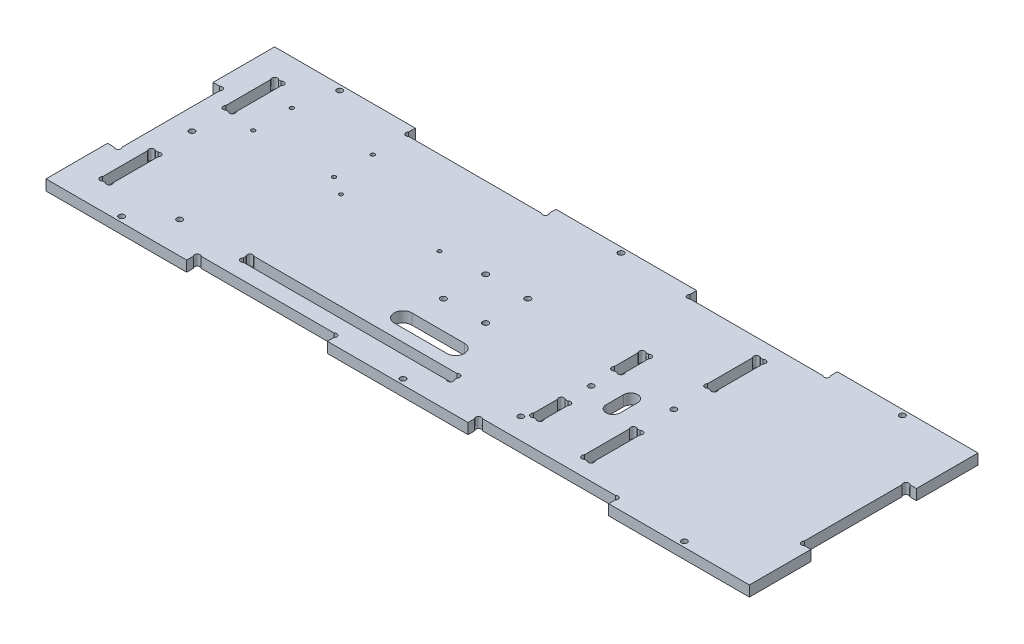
ISO-10303-21;
HEADER;
FILE_DESCRIPTION(('STEP AP214'),'2;1');
FILE_NAME('part.step','',(''),(''),'','','');
FILE_SCHEMA(('AUTOMOTIVE_DESIGN { 1 0 10303 214 1 1 1 1 }'));
ENDSEC;
DATA;
#1=APPLICATION_CONTEXT('core data for automotive mechanical design processes');
#2=APPLICATION_PROTOCOL_DEFINITION('international standard','automotive_design',2000,#1);
#3=PRODUCT_CONTEXT('',#1,'mechanical');
#4=PRODUCT('Part','Part','',(#3));
#5=PRODUCT_RELATED_PRODUCT_CATEGORY('part','',(#4));
#6=PRODUCT_DEFINITION_FORMATION('','',#4);
#7=PRODUCT_DEFINITION_CONTEXT('part definition',#1,'design');
#8=PRODUCT_DEFINITION('design','',#6,#7);
#9=PRODUCT_DEFINITION_SHAPE('','',#8);
#10=(LENGTH_UNIT() NAMED_UNIT(*) SI_UNIT(.MILLI.,.METRE.));
#11=(NAMED_UNIT(*) PLANE_ANGLE_UNIT() SI_UNIT($,.RADIAN.));
#12=(NAMED_UNIT(*) SI_UNIT($,.STERADIAN.) SOLID_ANGLE_UNIT());
#13=UNCERTAINTY_MEASURE_WITH_UNIT(LENGTH_MEASURE(1.E-05),#10,'distance_accuracy_value','');
#14=(GEOMETRIC_REPRESENTATION_CONTEXT(3) GLOBAL_UNCERTAINTY_ASSIGNED_CONTEXT((#13)) GLOBAL_UNIT_ASSIGNED_CONTEXT((#10,
#11,#12)) REPRESENTATION_CONTEXT('',''));
#15=CARTESIAN_POINT('',(0.,0.,0.));
#16=DIRECTION('',(0.,0.,1.));
#17=DIRECTION('',(1.,0.,0.));
#18=AXIS2_PLACEMENT_3D('',#15,#16,#17);
#19=CARTESIAN_POINT('',(195.131370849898,6.,28.8686291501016));
#20=DIRECTION('',(0.,-1.,0.));
#21=DIRECTION('',(0.,0.,-1.));
#22=AXIS2_PLACEMENT_3D('',#19,#20,#21);
#23=PLANE('',#22);
#24=CARTESIAN_POINT('',(-52.5000003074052,6.,-11.2562238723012));
#25=DIRECTION('',(0.,1.,0.));
#26=DIRECTION('',(0.,0.,1.));
#27=AXIS2_PLACEMENT_3D('',#24,#25,#26);
#28=CIRCLE('',#27,1.1);
#29=CARTESIAN_POINT('',(-52.5000003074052,6.,-10.1562238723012));
#30=VERTEX_POINT('',#29);
#31=EDGE_CURVE('E3232',#30,#30,#28,.T.);
#32=ORIENTED_EDGE('',*,*,#31,.F.);
#33=EDGE_LOOP('',(#32));
#34=FACE_BOUND('',#33,.T.);
#35=CARTESIAN_POINT('',(-165.,6.,-17.7999999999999));
#36=DIRECTION('',(0.,1.,0.));
#37=DIRECTION('',(0.,0.,-1.));
#38=AXIS2_PLACEMENT_3D('',#35,#36,#37);
#39=CIRCLE('',#38,1.09999999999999);
#40=CARTESIAN_POINT('',(-165.,6.,-18.8999999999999));
#41=VERTEX_POINT('',#40);
#42=EDGE_CURVE('E3244',#41,#41,#39,.T.);
#43=ORIENTED_EDGE('',*,*,#42,.F.);
#44=EDGE_LOOP('',(#43));
#45=FACE_BOUND('',#44,.T.);
#46=CARTESIAN_POINT('',(-165.,6.,-39.7999999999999));
#47=DIRECTION('',(0.,1.,0.));
#48=DIRECTION('',(0.,0.,1.));
#49=AXIS2_PLACEMENT_3D('',#46,#47,#48);
#50=CIRCLE('',#49,1.09999999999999);
#51=CARTESIAN_POINT('',(-165.,6.,-38.7));
#52=VERTEX_POINT('',#51);
#53=EDGE_CURVE('E707',#52,#52,#50,.T.);
#54=ORIENTED_EDGE('',*,*,#53,.F.);
#55=EDGE_LOOP('',(#54));
#56=FACE_BOUND('',#55,.T.);
#57=CARTESIAN_POINT('',(-30.,6.,32.));
#58=DIRECTION('',(0.,1.,0.));
#59=DIRECTION('',(0.,0.,1.));
#60=AXIS2_PLACEMENT_3D('',#57,#58,#59);
#61=CIRCLE('',#60,5.);
#62=CARTESIAN_POINT('',(-30.,6.,27.));
#63=VERTEX_POINT('',#62);
#64=CARTESIAN_POINT('',(-30.,6.,37.));
#65=VERTEX_POINT('',#64);
#66=EDGE_CURVE('E717',#63,#65,#61,.T.);
#67=ORIENTED_EDGE('',*,*,#66,.F.);
#68=DIRECTION('',(-1.,0.,0.));
#69=VECTOR('',#68,1.);
#70=CARTESIAN_POINT('',(-30.,6.,27.));
#71=LINE('',#70,#69);
#72=CARTESIAN_POINT('',(0.,6.,27.));
#73=VERTEX_POINT('',#72);
#74=EDGE_CURVE('E725',#73,#63,#71,.T.);
#75=ORIENTED_EDGE('',*,*,#74,.F.);
#76=CARTESIAN_POINT('',(0.,6.,32.));
#77=DIRECTION('',(0.,1.,0.));
#78=DIRECTION('',(0.,0.,1.));
#79=AXIS2_PLACEMENT_3D('',#76,#77,#78);
#80=CIRCLE('',#79,5.);
#81=CARTESIAN_POINT('',(0.,6.,37.));
#82=VERTEX_POINT('',#81);
#83=EDGE_CURVE('E722',#82,#73,#80,.T.);
#84=ORIENTED_EDGE('',*,*,#83,.F.);
#85=DIRECTION('',(1.,0.,0.));
#86=VECTOR('',#85,1.);
#87=CARTESIAN_POINT('',(-30.,6.,37.));
#88=LINE('',#87,#86);
#89=EDGE_CURVE('E719',#65,#82,#88,.T.);
#90=ORIENTED_EDGE('',*,*,#89,.F.);
#91=EDGE_LOOP('',(#67,#75,#84,#90));
#92=FACE_BOUND('',#91,.T.);
#93=CARTESIAN_POINT('',(-3.99999999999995,6.,11.));
#94=DIRECTION('',(0.,1.,0.));
#95=DIRECTION('',(0.,0.,1.));
#96=AXIS2_PLACEMENT_3D('',#93,#94,#95);
#97=CIRCLE('',#96,1.65000000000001);
#98=CARTESIAN_POINT('',(-3.99999999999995,6.,12.65));
#99=VERTEX_POINT('',#98);
#100=EDGE_CURVE('E754',#99,#99,#97,.T.);
#101=ORIENTED_EDGE('',*,*,#100,.F.);
#102=EDGE_LOOP('',(#101));
#103=FACE_BOUND('',#102,.T.);
#104=CARTESIAN_POINT('',(58.8686291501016,6.,-3.13137084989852));
#105=DIRECTION('',(0.,1.,0.));
#106=DIRECTION('',(0.,0.,-1.));
#107=AXIS2_PLACEMENT_3D('',#104,#105,#106);
#108=CIRCLE('',#107,1.6);
#109=CARTESIAN_POINT('',(57.7372583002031,6.,-2.00000000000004));
#110=VERTEX_POINT('',#109);
#111=CARTESIAN_POINT('',(60.0000000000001,6.,-4.26274169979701));
#112=VERTEX_POINT('',#111);
#113=EDGE_CURVE('E766',#110,#112,#108,.T.);
#114=ORIENTED_EDGE('',*,*,#113,.F.);
#115=DIRECTION('',(1.,0.,0.));
#116=VECTOR('',#115,1.);
#117=CARTESIAN_POINT('',(56.262741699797,6.,-2.00000000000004));
#118=LINE('',#117,#116);
#119=CARTESIAN_POINT('',(56.262741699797,6.,-2.00000000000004));
#120=VERTEX_POINT('',#119);
#121=EDGE_CURVE('E782',#120,#110,#118,.T.);
#122=ORIENTED_EDGE('',*,*,#121,.F.);
#123=CARTESIAN_POINT('',(55.1313708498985,6.,-3.13137084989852));
#124=DIRECTION('',(0.,1.,0.));
#125=DIRECTION('',(0.,0.,1.));
#126=AXIS2_PLACEMENT_3D('',#123,#124,#125);
#127=CIRCLE('',#126,1.6);
#128=CARTESIAN_POINT('',(54.0000000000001,6.,-4.26274169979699));
#129=VERTEX_POINT('',#128);
#130=EDGE_CURVE('E779',#129,#120,#127,.T.);
#131=ORIENTED_EDGE('',*,*,#130,.F.);
#132=DIRECTION('',(0.,0.,1.));
#133=VECTOR('',#132,1.);
#134=CARTESIAN_POINT('',(54.0000000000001,6.,-4.26274169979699));
#135=LINE('',#134,#133);
#136=CARTESIAN_POINT('',(54.0000000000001,6.,-17.7372583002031));
#137=VERTEX_POINT('',#136);
#138=EDGE_CURVE('E777',#137,#129,#135,.T.);
#139=ORIENTED_EDGE('',*,*,#138,.F.);
#140=CARTESIAN_POINT('',(55.1313708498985,6.,-18.8686291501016));
#141=DIRECTION('',(0.,1.,0.));
#142=DIRECTION('',(0.,0.,-1.));
#143=AXIS2_PLACEMENT_3D('',#140,#141,#142);
#144=CIRCLE('',#143,1.6);
#145=CARTESIAN_POINT('',(56.262741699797,6.,-20.0000000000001));
#146=VERTEX_POINT('',#145);
#147=EDGE_CURVE('E775',#146,#137,#144,.T.);
#148=ORIENTED_EDGE('',*,*,#147,.F.);
#149=DIRECTION('',(-1.,0.,0.));
#150=VECTOR('',#149,1.);
#151=CARTESIAN_POINT('',(56.262741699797,6.,-20.0000000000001));
#152=LINE('',#151,#150);
#153=CARTESIAN_POINT('',(57.7372583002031,6.,-20.0000000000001));
#154=VERTEX_POINT('',#153);
#155=EDGE_CURVE('E773',#154,#146,#152,.T.);
#156=ORIENTED_EDGE('',*,*,#155,.F.);
#157=CARTESIAN_POINT('',(58.8686291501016,6.,-18.8686291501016));
#158=DIRECTION('',(0.,1.,0.));
#159=DIRECTION('',(0.,0.,1.));
#160=AXIS2_PLACEMENT_3D('',#157,#158,#159);
#161=CIRCLE('',#160,1.6);
#162=CARTESIAN_POINT('',(60.0000000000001,6.,-17.7372583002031));
#163=VERTEX_POINT('',#162);
#164=EDGE_CURVE('E771',#163,#154,#161,.T.);
#165=ORIENTED_EDGE('',*,*,#164,.F.);
#166=DIRECTION('',(0.,0.,-1.));
#167=VECTOR('',#166,1.);
#168=CARTESIAN_POINT('',(60.0000000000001,6.,-4.26274169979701));
#169=LINE('',#168,#167);
#170=EDGE_CURVE('E768',#112,#163,#169,.T.);
#171=ORIENTED_EDGE('',*,*,#170,.F.);
#172=EDGE_LOOP('',(#114,#122,#131,#139,#148,#156,#165,#171));
#173=FACE_BOUND('',#172,.T.);
#174=CARTESIAN_POINT('',(-103.868629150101,6.,45.1313708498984));
#175=DIRECTION('',(0.,1.,0.));
#176=DIRECTION('',(0.,0.,1.));
#177=AXIS2_PLACEMENT_3D('',#174,#175,#176);
#178=CIRCLE('',#177,1.59999999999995);
#179=CARTESIAN_POINT('',(-102.737258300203,6.,44.));
#180=VERTEX_POINT('',#179);
#181=CARTESIAN_POINT('',(-105.,6.,46.2627416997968));
#182=VERTEX_POINT('',#181);
#183=EDGE_CURVE('E831',#180,#182,#178,.T.);
#184=ORIENTED_EDGE('',*,*,#183,.F.);
#185=DIRECTION('',(-1.,0.,0.));
#186=VECTOR('',#185,1.);
#187=CARTESIAN_POINT('',(-102.737258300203,6.,44.));
#188=LINE('',#187,#186);
#189=CARTESIAN_POINT('',(12.7372583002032,6.,44.));
#190=VERTEX_POINT('',#189);
#191=EDGE_CURVE('E847',#190,#180,#188,.T.);
#192=ORIENTED_EDGE('',*,*,#191,.F.);
#193=CARTESIAN_POINT('',(13.8686291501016,6.,45.1313708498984));
#194=DIRECTION('',(0.,1.,0.));
#195=DIRECTION('',(0.,0.,-1.));
#196=AXIS2_PLACEMENT_3D('',#193,#194,#195);
#197=CIRCLE('',#196,1.59999999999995);
#198=CARTESIAN_POINT('',(15.,6.,46.2627416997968));
#199=VERTEX_POINT('',#198);
#200=EDGE_CURVE('E844',#199,#190,#197,.T.);
#201=ORIENTED_EDGE('',*,*,#200,.F.);
#202=DIRECTION('',(0.,0.,-1.));
#203=VECTOR('',#202,1.);
#204=CARTESIAN_POINT('',(15.,6.,47.7372583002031));
#205=LINE('',#204,#203);
#206=CARTESIAN_POINT('',(15.,6.,47.7372583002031));
#207=VERTEX_POINT('',#206);
#208=EDGE_CURVE('E842',#207,#199,#205,.T.);
#209=ORIENTED_EDGE('',*,*,#208,.F.);
#210=CARTESIAN_POINT('',(13.8686291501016,6.,48.8686291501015));
#211=DIRECTION('',(0.,1.,0.));
#212=DIRECTION('',(0.,0.,1.));
#213=AXIS2_PLACEMENT_3D('',#210,#211,#212);
#214=CIRCLE('',#213,1.59999999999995);
#215=CARTESIAN_POINT('',(12.7372583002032,6.,50.));
#216=VERTEX_POINT('',#215);
#217=EDGE_CURVE('E840',#216,#207,#214,.T.);
#218=ORIENTED_EDGE('',*,*,#217,.F.);
#219=DIRECTION('',(1.,0.,0.));
#220=VECTOR('',#219,1.);
#221=CARTESIAN_POINT('',(-102.737258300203,6.,50.));
#222=LINE('',#221,#220);
#223=CARTESIAN_POINT('',(-102.737258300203,6.,50.));
#224=VERTEX_POINT('',#223);
#225=EDGE_CURVE('E838',#224,#216,#222,.T.);
#226=ORIENTED_EDGE('',*,*,#225,.F.);
#227=CARTESIAN_POINT('',(-103.868629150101,6.,48.8686291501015));
#228=DIRECTION('',(0.,1.,0.));
#229=DIRECTION('',(0.,0.,-1.));
#230=AXIS2_PLACEMENT_3D('',#227,#228,#229);
#231=CIRCLE('',#230,1.59999999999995);
#232=CARTESIAN_POINT('',(-105.,6.,47.7372583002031));
#233=VERTEX_POINT('',#232);
#234=EDGE_CURVE('E836',#233,#224,#231,.T.);
#235=ORIENTED_EDGE('',*,*,#234,.F.);
#236=DIRECTION('',(0.,0.,1.));
#237=VECTOR('',#236,1.);
#238=CARTESIAN_POINT('',(-105.,6.,47.7372583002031));
#239=LINE('',#238,#237);
#240=EDGE_CURVE('E833',#182,#233,#239,.T.);
#241=ORIENTED_EDGE('',*,*,#240,.F.);
#242=EDGE_LOOP('',(#184,#192,#201,#209,#218,#226,#235,#241));
#243=FACE_BOUND('',#242,.T.);
#244=CARTESIAN_POINT('',(55.1313708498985,6.,42.8686291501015));
#245=DIRECTION('',(0.,1.,0.));
#246=DIRECTION('',(0.,0.,1.));
#247=AXIS2_PLACEMENT_3D('',#244,#245,#246);
#248=CIRCLE('',#247,1.6);
#249=CARTESIAN_POINT('',(54.0000000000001,6.,41.737258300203));
#250=VERTEX_POINT('',#249);
#251=CARTESIAN_POINT('',(56.262741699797,6.,44.));
#252=VERTEX_POINT('',#251);
#253=EDGE_CURVE('E896',#250,#252,#248,.T.);
#254=ORIENTED_EDGE('',*,*,#253,.F.);
#255=DIRECTION('',(0.,0.,1.));
#256=VECTOR('',#255,1.);
#257=CARTESIAN_POINT('',(54.0000000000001,6.,28.2627416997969));
#258=LINE('',#257,#256);
#259=CARTESIAN_POINT('',(54.0000000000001,6.,28.2627416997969));
#260=VERTEX_POINT('',#259);
#261=EDGE_CURVE('E912',#260,#250,#258,.T.);
#262=ORIENTED_EDGE('',*,*,#261,.F.);
#263=CARTESIAN_POINT('',(55.1313708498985,6.,27.1313708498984));
#264=DIRECTION('',(0.,1.,0.));
#265=DIRECTION('',(0.,0.,-1.));
#266=AXIS2_PLACEMENT_3D('',#263,#264,#265);
#267=CIRCLE('',#266,1.6);
#268=CARTESIAN_POINT('',(56.262741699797,6.,26.));
#269=VERTEX_POINT('',#268);
#270=EDGE_CURVE('E909',#269,#260,#267,.T.);
#271=ORIENTED_EDGE('',*,*,#270,.F.);
#272=DIRECTION('',(-1.,0.,0.));
#273=VECTOR('',#272,1.);
#274=CARTESIAN_POINT('',(56.262741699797,6.,26.));
#275=LINE('',#274,#273);
#276=CARTESIAN_POINT('',(57.7372583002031,6.,26.));
#277=VERTEX_POINT('',#276);
#278=EDGE_CURVE('E907',#277,#269,#275,.T.);
#279=ORIENTED_EDGE('',*,*,#278,.F.);
#280=CARTESIAN_POINT('',(58.8686291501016,6.,27.1313708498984));
#281=DIRECTION('',(0.,1.,0.));
#282=DIRECTION('',(0.,0.,1.));
#283=AXIS2_PLACEMENT_3D('',#280,#281,#282);
#284=CIRCLE('',#283,1.6);
#285=CARTESIAN_POINT('',(60.0000000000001,6.,28.2627416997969));
#286=VERTEX_POINT('',#285);
#287=EDGE_CURVE('E905',#286,#277,#284,.T.);
#288=ORIENTED_EDGE('',*,*,#287,.F.);
#289=DIRECTION('',(0.,0.,-1.));
#290=VECTOR('',#289,1.);
#291=CARTESIAN_POINT('',(60.0000000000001,6.,28.2627416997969));
#292=LINE('',#291,#290);
#293=CARTESIAN_POINT('',(60.0000000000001,6.,41.737258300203));
#294=VERTEX_POINT('',#293);
#295=EDGE_CURVE('E903',#294,#286,#292,.T.);
#296=ORIENTED_EDGE('',*,*,#295,.F.);
#297=CARTESIAN_POINT('',(58.8686291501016,6.,42.8686291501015));
#298=DIRECTION('',(0.,1.,0.));
#299=DIRECTION('',(0.,0.,-1.));
#300=AXIS2_PLACEMENT_3D('',#297,#298,#299);
#301=CIRCLE('',#300,1.6);
#302=CARTESIAN_POINT('',(57.7372583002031,6.,44.));
#303=VERTEX_POINT('',#302);
#304=EDGE_CURVE('E901',#303,#294,#301,.T.);
#305=ORIENTED_EDGE('',*,*,#304,.F.);
#306=DIRECTION('',(1.,0.,0.));
#307=VECTOR('',#306,1.);
#308=CARTESIAN_POINT('',(56.262741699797,6.,44.));
#309=LINE('',#308,#307);
#310=EDGE_CURVE('E898',#252,#303,#309,.T.);
#311=ORIENTED_EDGE('',*,*,#310,.F.);
#312=EDGE_LOOP('',(#254,#262,#271,#279,#288,#296,#305,#311));
#313=FACE_BOUND('',#312,.T.);
#314=CARTESIAN_POINT('',(-183.868629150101,6.,-21.1313708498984));
#315=DIRECTION('',(0.,1.,0.));
#316=DIRECTION('',(0.,0.,-1.));
#317=AXIS2_PLACEMENT_3D('',#314,#315,#316);
#318=CIRCLE('',#317,1.60000000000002);
#319=CARTESIAN_POINT('',(-185.,6.,-22.2627416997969));
#320=VERTEX_POINT('',#319);
#321=CARTESIAN_POINT('',(-182.737258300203,6.,-19.9999999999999));
#322=VERTEX_POINT('',#321);
#323=EDGE_CURVE('E961',#320,#322,#318,.T.);
#324=ORIENTED_EDGE('',*,*,#323,.F.);
#325=DIRECTION('',(0.,0.,1.));
#326=VECTOR('',#325,1.);
#327=CARTESIAN_POINT('',(-185.,6.,-47.737258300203));
#328=LINE('',#327,#326);
#329=CARTESIAN_POINT('',(-185.,6.,-47.737258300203));
#330=VERTEX_POINT('',#329);
#331=EDGE_CURVE('E977',#330,#320,#328,.T.);
#332=ORIENTED_EDGE('',*,*,#331,.F.);
#333=CARTESIAN_POINT('',(-183.868629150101,6.,-48.8686291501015));
#334=DIRECTION('',(0.,1.,0.));
#335=DIRECTION('',(0.,0.,1.));
#336=AXIS2_PLACEMENT_3D('',#333,#334,#335);
#337=CIRCLE('',#336,1.60000000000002);
#338=CARTESIAN_POINT('',(-182.737258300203,6.,-50.));
#339=VERTEX_POINT('',#338);
#340=EDGE_CURVE('E974',#339,#330,#337,.T.);
#341=ORIENTED_EDGE('',*,*,#340,.F.);
#342=DIRECTION('',(-1.,0.,0.));
#343=VECTOR('',#342,1.);
#344=CARTESIAN_POINT('',(-181.262741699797,6.,-50.));
#345=LINE('',#344,#343);
#346=CARTESIAN_POINT('',(-181.262741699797,6.,-50.));
#347=VERTEX_POINT('',#346);
#348=EDGE_CURVE('E972',#347,#339,#345,.T.);
#349=ORIENTED_EDGE('',*,*,#348,.F.);
#350=CARTESIAN_POINT('',(-180.131370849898,6.,-48.8686291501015));
#351=DIRECTION('',(0.,1.,0.));
#352=DIRECTION('',(0.,0.,-1.));
#353=AXIS2_PLACEMENT_3D('',#350,#351,#352);
#354=CIRCLE('',#353,1.59999999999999);
#355=CARTESIAN_POINT('',(-179.,6.,-47.737258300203));
#356=VERTEX_POINT('',#355);
#357=EDGE_CURVE('E970',#356,#347,#354,.T.);
#358=ORIENTED_EDGE('',*,*,#357,.F.);
#359=DIRECTION('',(0.,0.,-1.));
#360=VECTOR('',#359,1.);
#361=CARTESIAN_POINT('',(-179.,6.,-22.2627416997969));
#362=LINE('',#361,#360);
#363=CARTESIAN_POINT('',(-179.,6.,-22.2627416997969));
#364=VERTEX_POINT('',#363);
#365=EDGE_CURVE('E968',#364,#356,#362,.T.);
#366=ORIENTED_EDGE('',*,*,#365,.F.);
#367=CARTESIAN_POINT('',(-180.131370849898,6.,-21.1313708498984));
#368=DIRECTION('',(0.,1.,0.));
#369=DIRECTION('',(0.,0.,1.));
#370=AXIS2_PLACEMENT_3D('',#367,#368,#369);
#371=CIRCLE('',#370,1.59999999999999);
#372=CARTESIAN_POINT('',(-181.262741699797,6.,-19.9999999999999));
#373=VERTEX_POINT('',#372);
#374=EDGE_CURVE('E966',#373,#364,#371,.T.);
#375=ORIENTED_EDGE('',*,*,#374,.F.);
#376=DIRECTION('',(1.,0.,0.));
#377=VECTOR('',#376,1.);
#378=CARTESIAN_POINT('',(-181.262741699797,6.,-19.9999999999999));
#379=LINE('',#378,#377);
#380=EDGE_CURVE('E963',#322,#373,#379,.T.);
#381=ORIENTED_EDGE('',*,*,#380,.F.);
#382=EDGE_LOOP('',(#324,#332,#341,#349,#358,#366,#375,#381));
#383=FACE_BOUND('',#382,.T.);
#384=CARTESIAN_POINT('',(-182.,6.,0.));
#385=DIRECTION('',(0.,1.,0.));
#386=DIRECTION('',(0.,0.,-1.));
#387=AXIS2_PLACEMENT_3D('',#384,#385,#386);
#388=CIRCLE('',#387,1.59999999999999);
#389=CARTESIAN_POINT('',(-182.,6.,-1.59999999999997));
#390=VERTEX_POINT('',#389);
#391=EDGE_CURVE('E1079',#390,#390,#388,.T.);
#392=ORIENTED_EDGE('',*,*,#391,.F.);
#393=EDGE_LOOP('',(#392));
#394=FACE_BOUND('',#393,.T.);
#395=CARTESIAN_POINT('',(92.0000000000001,6.,0.));
#396=DIRECTION('',(0.,1.,0.));
#397=DIRECTION('',(0.,0.,1.));
#398=AXIS2_PLACEMENT_3D('',#395,#396,#397);
#399=CIRCLE('',#398,1.59999999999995);
#400=CARTESIAN_POINT('',(92.0000000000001,6.,1.59999999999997));
#401=VERTEX_POINT('',#400);
#402=EDGE_CURVE('E1091',#401,#401,#399,.T.);
#403=ORIENTED_EDGE('',*,*,#402,.F.);
#404=EDGE_LOOP('',(#403));
#405=FACE_BOUND('',#404,.T.);
#406=CARTESIAN_POINT('',(90.1313708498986,6.,-48.8686291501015));
#407=DIRECTION('',(0.,1.,0.));
#408=DIRECTION('',(0.,0.,1.));
#409=AXIS2_PLACEMENT_3D('',#406,#407,#408);
#410=CIRCLE('',#409,1.6);
#411=CARTESIAN_POINT('',(91.2627416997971,6.,-50.));
#412=VERTEX_POINT('',#411);
#413=CARTESIAN_POINT('',(89.0000000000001,6.,-47.737258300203));
#414=VERTEX_POINT('',#413);
#415=EDGE_CURVE('E1156',#412,#414,#410,.T.);
#416=ORIENTED_EDGE('',*,*,#415,.F.);
#417=DIRECTION('',(-1.,0.,0.));
#418=VECTOR('',#417,1.);
#419=CARTESIAN_POINT('',(91.2627416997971,6.,-50.));
#420=LINE('',#419,#418);
#421=CARTESIAN_POINT('',(92.737258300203,6.,-50.));
#422=VERTEX_POINT('',#421);
#423=EDGE_CURVE('E1172',#422,#412,#420,.T.);
#424=ORIENTED_EDGE('',*,*,#423,.F.);
#425=CARTESIAN_POINT('',(93.8686291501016,6.,-48.8686291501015));
#426=DIRECTION('',(0.,1.,0.));
#427=DIRECTION('',(0.,0.,-1.));
#428=AXIS2_PLACEMENT_3D('',#425,#426,#427);
#429=CIRCLE('',#428,1.60000000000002);
#430=CARTESIAN_POINT('',(95.0000000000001,6.,-47.737258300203));
#431=VERTEX_POINT('',#430);
#432=EDGE_CURVE('E1169',#431,#422,#429,.T.);
#433=ORIENTED_EDGE('',*,*,#432,.F.);
#434=DIRECTION('',(0.,0.,-1.));
#435=VECTOR('',#434,1.);
#436=CARTESIAN_POINT('',(95.0000000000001,6.,-47.737258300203));
#437=LINE('',#436,#435);
#438=CARTESIAN_POINT('',(95.,6.,-22.2627416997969));
#439=VERTEX_POINT('',#438);
#440=EDGE_CURVE('E1167',#439,#431,#437,.T.);
#441=ORIENTED_EDGE('',*,*,#440,.F.);
#442=CARTESIAN_POINT('',(93.8686291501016,6.,-21.1313708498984));
#443=DIRECTION('',(0.,1.,0.));
#444=DIRECTION('',(0.,0.,1.));
#445=AXIS2_PLACEMENT_3D('',#442,#443,#444);
#446=CIRCLE('',#445,1.60000000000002);
#447=CARTESIAN_POINT('',(92.7372583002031,6.,-20.));
#448=VERTEX_POINT('',#447);
#449=EDGE_CURVE('E1165',#448,#439,#446,.T.);
#450=ORIENTED_EDGE('',*,*,#449,.F.);
#451=DIRECTION('',(1.,0.,0.));
#452=VECTOR('',#451,1.);
#453=CARTESIAN_POINT('',(91.2627416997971,6.,-20.));
#454=LINE('',#453,#452);
#455=CARTESIAN_POINT('',(91.2627416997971,6.,-20.));
#456=VERTEX_POINT('',#455);
#457=EDGE_CURVE('E1163',#456,#448,#454,.T.);
#458=ORIENTED_EDGE('',*,*,#457,.F.);
#459=CARTESIAN_POINT('',(90.1313708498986,6.,-21.1313708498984));
#460=DIRECTION('',(0.,1.,0.));
#461=DIRECTION('',(0.,0.,-1.));
#462=AXIS2_PLACEMENT_3D('',#459,#460,#461);
#463=CIRCLE('',#462,1.6);
#464=CARTESIAN_POINT('',(89.0000000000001,6.,-22.262741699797));
#465=VERTEX_POINT('',#464);
#466=EDGE_CURVE('E1161',#465,#456,#463,.T.);
#467=ORIENTED_EDGE('',*,*,#466,.F.);
#468=DIRECTION('',(0.,0.,1.));
#469=VECTOR('',#468,1.);
#470=CARTESIAN_POINT('',(89.0000000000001,6.,-22.262741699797));
#471=LINE('',#470,#469);
#472=EDGE_CURVE('E1158',#414,#465,#471,.T.);
#473=ORIENTED_EDGE('',*,*,#472,.F.);
#474=EDGE_LOOP('',(#416,#424,#433,#441,#450,#458,#467,#473));
#475=FACE_BOUND('',#474,.T.);
#476=CARTESIAN_POINT('',(160.,6.,62.0000000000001));
#477=DIRECTION('',(0.,1.,0.));
#478=DIRECTION('',(0.,0.,1.));
#479=AXIS2_PLACEMENT_3D('',#476,#477,#478);
#480=CIRCLE('',#479,1.59999999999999);
#481=CARTESIAN_POINT('',(160.,6.,63.6000000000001));
#482=VERTEX_POINT('',#481);
#483=EDGE_CURVE('E1221',#482,#482,#480,.T.);
#484=ORIENTED_EDGE('',*,*,#483,.F.);
#485=EDGE_LOOP('',(#484));
#486=FACE_BOUND('',#485,.T.);
#487=CARTESIAN_POINT('',(-160.,6.,-62.));
#488=DIRECTION('',(0.,1.,0.));
#489=DIRECTION('',(0.,0.,1.));
#490=AXIS2_PLACEMENT_3D('',#487,#488,#489);
#491=CIRCLE('',#490,1.59999999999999);
#492=CARTESIAN_POINT('',(-160.,6.,-60.4));
#493=VERTEX_POINT('',#492);
#494=EDGE_CURVE('E1233',#493,#493,#491,.T.);
#495=ORIENTED_EDGE('',*,*,#494,.F.);
#496=EDGE_LOOP('',(#495));
#497=FACE_BOUND('',#496,.T.);
#498=CARTESIAN_POINT('',(0.,6.,-62.));
#499=DIRECTION('',(0.,1.,0.));
#500=DIRECTION('',(0.,0.,1.));
#501=AXIS2_PLACEMENT_3D('',#498,#499,#500);
#502=CIRCLE('',#501,1.6);
#503=CARTESIAN_POINT('',(0.,6.,-60.4));
#504=VERTEX_POINT('',#503);
#505=EDGE_CURVE('E1245',#504,#504,#502,.T.);
#506=ORIENTED_EDGE('',*,*,#505,.F.);
#507=EDGE_LOOP('',(#506));
#508=FACE_BOUND('',#507,.T.);
#509=DIRECTION('',(1.,0.,0.));
#510=VECTOR('',#509,1.);
#511=CARTESIAN_POINT('',(120.,6.,65.));
#512=LINE('',#511,#510);
#513=CARTESIAN_POINT('',(120.,6.,65.));
#514=VERTEX_POINT('',#513);
#515=CARTESIAN_POINT('',(200.,6.,65.));
#516=VERTEX_POINT('',#515);
#517=EDGE_CURVE('E1251',#514,#516,#512,.T.);
#518=ORIENTED_EDGE('',*,*,#517,.T.);
#519=DIRECTION('',(0.,0.,-1.));
#520=VECTOR('',#519,1.);
#521=CARTESIAN_POINT('',(200.,6.,30.));
#522=LINE('',#521,#520);
#523=CARTESIAN_POINT('',(200.,6.,30.));
#524=VERTEX_POINT('',#523);
#525=EDGE_CURVE('E1254',#516,#524,#522,.T.);
#526=ORIENTED_EDGE('',*,*,#525,.T.);
#527=DIRECTION('',(-1.,0.,0.));
#528=VECTOR('',#527,1.);
#529=CARTESIAN_POINT('',(196.262741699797,6.,30.));
#530=LINE('',#529,#528);
#531=CARTESIAN_POINT('',(196.262741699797,6.,30.));
#532=VERTEX_POINT('',#531);
#533=EDGE_CURVE('E1257',#524,#532,#530,.T.);
#534=ORIENTED_EDGE('',*,*,#533,.T.);
#535=CARTESIAN_POINT('',(195.131370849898,6.,28.8686291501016));
#536=DIRECTION('',(0.,-1.,0.));
#537=DIRECTION('',(0.,0.,-1.));
#538=AXIS2_PLACEMENT_3D('',#535,#536,#537);
#539=CIRCLE('',#538,1.59999999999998);
#540=CARTESIAN_POINT('',(194.,6.,27.7372583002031));
#541=VERTEX_POINT('',#540);
#542=EDGE_CURVE('E1259',#532,#541,#539,.T.);
#543=ORIENTED_EDGE('',*,*,#542,.T.);
#544=DIRECTION('',(0.,0.,-1.));
#545=VECTOR('',#544,1.);
#546=CARTESIAN_POINT('',(194.,6.,27.7372583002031));
#547=LINE('',#546,#545);
#548=CARTESIAN_POINT('',(194.,6.,-27.7372583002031));
#549=VERTEX_POINT('',#548);
#550=EDGE_CURVE('E1261',#541,#549,#547,.T.);
#551=ORIENTED_EDGE('',*,*,#550,.T.);
#552=CARTESIAN_POINT('',(195.131370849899,6.,-28.8686291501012));
#553=DIRECTION('',(0.,-1.,0.));
#554=DIRECTION('',(0.,0.,1.));
#555=AXIS2_PLACEMENT_3D('',#552,#553,#554);
#556=CIRCLE('',#555,1.59999999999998);
#557=CARTESIAN_POINT('',(196.262741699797,6.,-30.));
#558=VERTEX_POINT('',#557);
#559=EDGE_CURVE('E1263',#549,#558,#556,.T.);
#560=ORIENTED_EDGE('',*,*,#559,.T.);
#561=DIRECTION('',(1.,0.,0.));
#562=VECTOR('',#561,1.);
#563=CARTESIAN_POINT('',(196.262741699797,6.,-30.));
#564=LINE('',#563,#562);
#565=CARTESIAN_POINT('',(200.,6.,-30.));
#566=VERTEX_POINT('',#565);
#567=EDGE_CURVE('E1265',#558,#566,#564,.T.);
#568=ORIENTED_EDGE('',*,*,#567,.T.);
#569=DIRECTION('',(0.,0.,-1.));
#570=VECTOR('',#569,1.);
#571=CARTESIAN_POINT('',(200.,6.,-65.));
#572=LINE('',#571,#570);
#573=CARTESIAN_POINT('',(200.,6.,-65.));
#574=VERTEX_POINT('',#573);
#575=EDGE_CURVE('E1267',#566,#574,#572,.T.);
#576=ORIENTED_EDGE('',*,*,#575,.T.);
#577=DIRECTION('',(-1.,0.,0.));
#578=VECTOR('',#577,1.);
#579=CARTESIAN_POINT('',(120.,6.,-65.));
#580=LINE('',#579,#578);
#581=CARTESIAN_POINT('',(120.,6.,-65.));
#582=VERTEX_POINT('',#581);
#583=EDGE_CURVE('E1269',#574,#582,#580,.T.);
#584=ORIENTED_EDGE('',*,*,#583,.T.);
#585=DIRECTION('',(0.,0.,1.));
#586=VECTOR('',#585,1.);
#587=CARTESIAN_POINT('',(120.,6.,-65.));
#588=LINE('',#587,#586);
#589=CARTESIAN_POINT('',(120.,6.,-61.2627416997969));
#590=VERTEX_POINT('',#589);
#591=EDGE_CURVE('E1271',#582,#590,#588,.T.);
#592=ORIENTED_EDGE('',*,*,#591,.T.);
#593=CARTESIAN_POINT('',(118.868629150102,6.,-60.1313708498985));
#594=DIRECTION('',(0.,-1.,0.));
#595=DIRECTION('',(0.,0.,-1.));
#596=AXIS2_PLACEMENT_3D('',#593,#594,#595);
#597=CIRCLE('',#596,1.6);
#598=CARTESIAN_POINT('',(117.737258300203,6.,-59.));
#599=VERTEX_POINT('',#598);
#600=EDGE_CURVE('E1273',#590,#599,#597,.T.);
#601=ORIENTED_EDGE('',*,*,#600,.T.);
#602=DIRECTION('',(-1.,0.,0.));
#603=VECTOR('',#602,1.);
#604=CARTESIAN_POINT('',(42.262741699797,6.,-59.));
#605=LINE('',#604,#603);
#606=CARTESIAN_POINT('',(42.262741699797,6.,-59.));
#607=VERTEX_POINT('',#606);
#608=EDGE_CURVE('E1275',#599,#607,#605,.T.);
#609=ORIENTED_EDGE('',*,*,#608,.T.);
#610=CARTESIAN_POINT('',(41.1313708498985,6.,-60.1313708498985));
#611=DIRECTION('',(0.,-1.,0.));
#612=DIRECTION('',(0.,0.,1.));
#613=AXIS2_PLACEMENT_3D('',#610,#611,#612);
#614=CIRCLE('',#613,1.6);
#615=CARTESIAN_POINT('',(40.,6.,-61.2627416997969));
#616=VERTEX_POINT('',#615);
#617=EDGE_CURVE('E1277',#607,#616,#614,.T.);
#618=ORIENTED_EDGE('',*,*,#617,.T.);
#619=DIRECTION('',(0.,0.,-1.));
#620=VECTOR('',#619,1.);
#621=CARTESIAN_POINT('',(40.,6.,-65.));
#622=LINE('',#621,#620);
#623=CARTESIAN_POINT('',(40.,6.,-65.));
#624=VERTEX_POINT('',#623);
#625=EDGE_CURVE('E1279',#616,#624,#622,.T.);
#626=ORIENTED_EDGE('',*,*,#625,.T.);
#627=DIRECTION('',(-1.,0.,0.));
#628=VECTOR('',#627,1.);
#629=CARTESIAN_POINT('',(-40.0000000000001,6.,-65.));
#630=LINE('',#629,#628);
#631=CARTESIAN_POINT('',(-40.0000000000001,6.,-65.));
#632=VERTEX_POINT('',#631);
#633=EDGE_CURVE('E1281',#624,#632,#630,.T.);
#634=ORIENTED_EDGE('',*,*,#633,.T.);
#635=DIRECTION('',(0.,0.,1.));
#636=VECTOR('',#635,1.);
#637=CARTESIAN_POINT('',(-40.0000000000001,6.,-65.));
#638=LINE('',#637,#636);
#639=CARTESIAN_POINT('',(-40.,6.,-61.2627416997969));
#640=VERTEX_POINT('',#639);
#641=EDGE_CURVE('E1283',#632,#640,#638,.T.);
#642=ORIENTED_EDGE('',*,*,#641,.T.);
#643=CARTESIAN_POINT('',(-41.1313708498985,6.,-60.1313708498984));
#644=DIRECTION('',(0.,-1.,0.));
#645=DIRECTION('',(0.,0.,-1.));
#646=AXIS2_PLACEMENT_3D('',#643,#644,#645);
#647=CIRCLE('',#646,1.6);
#648=CARTESIAN_POINT('',(-42.262741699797,6.,-58.9999999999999));
#649=VERTEX_POINT('',#648);
#650=EDGE_CURVE('E1285',#640,#649,#647,.T.);
#651=ORIENTED_EDGE('',*,*,#650,.T.);
#652=DIRECTION('',(-1.,0.,0.));
#653=VECTOR('',#652,1.);
#654=CARTESIAN_POINT('',(-42.262741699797,6.,-58.9999999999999));
#655=LINE('',#654,#653);
#656=CARTESIAN_POINT('',(-117.737258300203,6.,-58.9999999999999));
#657=VERTEX_POINT('',#656);
#658=EDGE_CURVE('E1287',#649,#657,#655,.T.);
#659=ORIENTED_EDGE('',*,*,#658,.T.);
#660=CARTESIAN_POINT('',(-118.868629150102,6.,-60.1313708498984));
#661=DIRECTION('',(0.,-1.,0.));
#662=DIRECTION('',(0.,0.,1.));
#663=AXIS2_PLACEMENT_3D('',#660,#661,#662);
#664=CIRCLE('',#663,1.6);
#665=CARTESIAN_POINT('',(-120.,6.,-61.2627416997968));
#666=VERTEX_POINT('',#665);
#667=EDGE_CURVE('E1289',#657,#666,#664,.T.);
#668=ORIENTED_EDGE('',*,*,#667,.T.);
#669=DIRECTION('',(0.,0.,-1.));
#670=VECTOR('',#669,1.);
#671=CARTESIAN_POINT('',(-120.,6.,-64.9999999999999));
#672=LINE('',#671,#670);
#673=CARTESIAN_POINT('',(-120.,6.,-64.9999999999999));
#674=VERTEX_POINT('',#673);
#675=EDGE_CURVE('E1291',#666,#674,#672,.T.);
#676=ORIENTED_EDGE('',*,*,#675,.T.);
#677=DIRECTION('',(-1.,0.,0.));
#678=VECTOR('',#677,1.);
#679=CARTESIAN_POINT('',(-200.,6.,-65.));
#680=LINE('',#679,#678);
#681=CARTESIAN_POINT('',(-200.,6.,-65.));
#682=VERTEX_POINT('',#681);
#683=EDGE_CURVE('E1293',#674,#682,#680,.T.);
#684=ORIENTED_EDGE('',*,*,#683,.T.);
#685=DIRECTION('',(0.,0.,1.));
#686=VECTOR('',#685,1.);
#687=CARTESIAN_POINT('',(-200.,6.,-65.));
#688=LINE('',#687,#686);
#689=CARTESIAN_POINT('',(-200.,6.,-29.9999999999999));
#690=VERTEX_POINT('',#689);
#691=EDGE_CURVE('E1295',#682,#690,#688,.T.);
#692=ORIENTED_EDGE('',*,*,#691,.T.);
#693=DIRECTION('',(1.,0.,0.));
#694=VECTOR('',#693,1.);
#695=CARTESIAN_POINT('',(-196.262741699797,6.,-29.9999999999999));
#696=LINE('',#695,#694);
#697=CARTESIAN_POINT('',(-196.262741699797,6.,-29.9999999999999));
#698=VERTEX_POINT('',#697);
#699=EDGE_CURVE('E1297',#690,#698,#696,.T.);
#700=ORIENTED_EDGE('',*,*,#699,.T.);
#701=CARTESIAN_POINT('',(-195.131370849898,6.,-28.8686291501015));
#702=DIRECTION('',(0.,-1.,0.));
#703=DIRECTION('',(0.,0.,-1.));
#704=AXIS2_PLACEMENT_3D('',#701,#702,#703);
#705=CIRCLE('',#704,1.59999999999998);
#706=CARTESIAN_POINT('',(-194.,6.,-27.737258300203));
#707=VERTEX_POINT('',#706);
#708=EDGE_CURVE('E1299',#698,#707,#705,.T.);
#709=ORIENTED_EDGE('',*,*,#708,.T.);
#710=DIRECTION('',(0.,0.,1.));
#711=VECTOR('',#710,1.);
#712=CARTESIAN_POINT('',(-194.,6.,27.7372583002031));
#713=LINE('',#712,#711);
#714=CARTESIAN_POINT('',(-194.,6.,27.7372583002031));
#715=VERTEX_POINT('',#714);
#716=EDGE_CURVE('E1301',#707,#715,#713,.T.);
#717=ORIENTED_EDGE('',*,*,#716,.T.);
#718=CARTESIAN_POINT('',(-195.131370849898,6.,28.8686291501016));
#719=DIRECTION('',(0.,-1.,0.));
#720=DIRECTION('',(0.,0.,1.));
#721=AXIS2_PLACEMENT_3D('',#718,#719,#720);
#722=CIRCLE('',#721,1.59999999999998);
#723=CARTESIAN_POINT('',(-196.262741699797,6.,30.));
#724=VERTEX_POINT('',#723);
#725=EDGE_CURVE('E1303',#715,#724,#722,.T.);
#726=ORIENTED_EDGE('',*,*,#725,.T.);
#727=DIRECTION('',(-1.,0.,0.));
#728=VECTOR('',#727,1.);
#729=CARTESIAN_POINT('',(-196.262741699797,6.,30.));
#730=LINE('',#729,#728);
#731=CARTESIAN_POINT('',(-200.,6.,30.));
#732=VERTEX_POINT('',#731);
#733=EDGE_CURVE('E1305',#724,#732,#730,.T.);
#734=ORIENTED_EDGE('',*,*,#733,.T.);
#735=DIRECTION('',(0.,0.,1.));
#736=VECTOR('',#735,1.);
#737=CARTESIAN_POINT('',(-200.,6.,30.));
#738=LINE('',#737,#736);
#739=CARTESIAN_POINT('',(-200.,6.,65.0000000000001));
#740=VERTEX_POINT('',#739);
#741=EDGE_CURVE('E1307',#732,#740,#738,.T.);
#742=ORIENTED_EDGE('',*,*,#741,.T.);
#743=DIRECTION('',(1.,0.,0.));
#744=VECTOR('',#743,1.);
#745=CARTESIAN_POINT('',(-200.,6.,65.0000000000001));
#746=LINE('',#745,#744);
#747=CARTESIAN_POINT('',(-120.,6.,65.));
#748=VERTEX_POINT('',#747);
#749=EDGE_CURVE('E1309',#740,#748,#746,.T.);
#750=ORIENTED_EDGE('',*,*,#749,.T.);
#751=DIRECTION('',(0.,0.,-1.));
#752=VECTOR('',#751,1.);
#753=CARTESIAN_POINT('',(-120.,6.,65.));
#754=LINE('',#753,#752);
#755=CARTESIAN_POINT('',(-120.,6.,61.2627416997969));
#756=VERTEX_POINT('',#755);
#757=EDGE_CURVE('E1311',#748,#756,#754,.T.);
#758=ORIENTED_EDGE('',*,*,#757,.T.);
#759=CARTESIAN_POINT('',(-118.868629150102,6.,60.1313708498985));
#760=DIRECTION('',(0.,-1.,0.));
#761=DIRECTION('',(0.,0.,-1.));
#762=AXIS2_PLACEMENT_3D('',#759,#760,#761);
#763=CIRCLE('',#762,1.6);
#764=CARTESIAN_POINT('',(-117.737258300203,6.,59.));
#765=VERTEX_POINT('',#764);
#766=EDGE_CURVE('E1313',#756,#765,#763,.T.);
#767=ORIENTED_EDGE('',*,*,#766,.T.);
#768=DIRECTION('',(1.,0.,0.));
#769=VECTOR('',#768,1.);
#770=CARTESIAN_POINT('',(-42.262741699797,6.,59.));
#771=LINE('',#770,#769);
#772=CARTESIAN_POINT('',(-42.262741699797,6.,59.));
#773=VERTEX_POINT('',#772);
#774=EDGE_CURVE('E1315',#765,#773,#771,.T.);
#775=ORIENTED_EDGE('',*,*,#774,.T.);
#776=CARTESIAN_POINT('',(-41.1313708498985,6.,60.1313708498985));
#777=DIRECTION('',(0.,-1.,0.));
#778=DIRECTION('',(0.,0.,1.));
#779=AXIS2_PLACEMENT_3D('',#776,#777,#778);
#780=CIRCLE('',#779,1.6);
#781=CARTESIAN_POINT('',(-40.,6.,61.2627416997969));
#782=VERTEX_POINT('',#781);
#783=EDGE_CURVE('E1317',#773,#782,#780,.T.);
#784=ORIENTED_EDGE('',*,*,#783,.T.);
#785=DIRECTION('',(0.,0.,1.));
#786=VECTOR('',#785,1.);
#787=CARTESIAN_POINT('',(-40.,6.,65.));
#788=LINE('',#787,#786);
#789=CARTESIAN_POINT('',(-40.,6.,65.));
#790=VERTEX_POINT('',#789);
#791=EDGE_CURVE('E1319',#782,#790,#788,.T.);
#792=ORIENTED_EDGE('',*,*,#791,.T.);
#793=DIRECTION('',(1.,0.,0.));
#794=VECTOR('',#793,1.);
#795=CARTESIAN_POINT('',(-40.,6.,65.));
#796=LINE('',#795,#794);
#797=CARTESIAN_POINT('',(40.,6.,65.));
#798=VERTEX_POINT('',#797);
#799=EDGE_CURVE('E1321',#790,#798,#796,.T.);
#800=ORIENTED_EDGE('',*,*,#799,.T.);
#801=DIRECTION('',(0.,0.,-1.));
#802=VECTOR('',#801,1.);
#803=CARTESIAN_POINT('',(40.,6.,65.));
#804=LINE('',#803,#802);
#805=CARTESIAN_POINT('',(40.,6.,61.2627416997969));
#806=VERTEX_POINT('',#805);
#807=EDGE_CURVE('E1323',#798,#806,#804,.T.);
#808=ORIENTED_EDGE('',*,*,#807,.T.);
#809=CARTESIAN_POINT('',(41.1313708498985,6.,60.1313708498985));
#810=DIRECTION('',(0.,-1.,0.));
#811=DIRECTION('',(0.,0.,-1.));
#812=AXIS2_PLACEMENT_3D('',#809,#810,#811);
#813=CIRCLE('',#812,1.6);
#814=CARTESIAN_POINT('',(42.262741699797,6.,59.));
#815=VERTEX_POINT('',#814);
#816=EDGE_CURVE('E1325',#806,#815,#813,.T.);
#817=ORIENTED_EDGE('',*,*,#816,.T.);
#818=DIRECTION('',(1.,0.,0.));
#819=VECTOR('',#818,1.);
#820=CARTESIAN_POINT('',(42.262741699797,6.,59.));
#821=LINE('',#820,#819);
#822=CARTESIAN_POINT('',(117.737258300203,6.,59.));
#823=VERTEX_POINT('',#822);
#824=EDGE_CURVE('E1327',#815,#823,#821,.T.);
#825=ORIENTED_EDGE('',*,*,#824,.T.);
#826=CARTESIAN_POINT('',(118.868629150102,6.,60.1313708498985));
#827=DIRECTION('',(0.,-1.,0.));
#828=DIRECTION('',(0.,0.,1.));
#829=AXIS2_PLACEMENT_3D('',#826,#827,#828);
#830=CIRCLE('',#829,1.6);
#831=CARTESIAN_POINT('',(120.,6.,61.2627416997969));
#832=VERTEX_POINT('',#831);
#833=EDGE_CURVE('E1329',#823,#832,#830,.T.);
#834=ORIENTED_EDGE('',*,*,#833,.T.);
#835=DIRECTION('',(0.,0.,1.));
#836=VECTOR('',#835,1.);
#837=CARTESIAN_POINT('',(120.,6.,65.));
#838=LINE('',#837,#836);
#839=EDGE_CURVE('E1331',#832,#514,#838,.T.);
#840=ORIENTED_EDGE('',*,*,#839,.T.);
#841=EDGE_LOOP('',(#518,#526,#534,#543,#551,#560,#568,#576,#584,#592,#601,#609,#618,#626,#634,
#642,#651,#659,#668,#676,#684,#692,#700,#709,#717,#726,#734,#742,#750,#758,#767,#775,#784,#792,
#800,#808,#817,#825,#834,#840));
#842=FACE_BOUND('',#841,.T.);
#843=CARTESIAN_POINT('',(160.,6.,-62.));
#844=DIRECTION('',(0.,1.,0.));
#845=DIRECTION('',(0.,0.,-1.));
#846=AXIS2_PLACEMENT_3D('',#843,#844,#845);
#847=CIRCLE('',#846,1.59999999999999);
#848=CARTESIAN_POINT('',(160.,6.,-63.6));
#849=VERTEX_POINT('',#848);
#850=EDGE_CURVE('E1239',#849,#849,#847,.T.);
#851=ORIENTED_EDGE('',*,*,#850,.F.);
#852=EDGE_LOOP('',(#851));
#853=FACE_BOUND('',#852,.T.);
#854=CARTESIAN_POINT('',(0.,6.,62.0000000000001));
#855=DIRECTION('',(0.,1.,0.));
#856=DIRECTION('',(0.,0.,-1.));
#857=AXIS2_PLACEMENT_3D('',#854,#855,#856);
#858=CIRCLE('',#857,1.6);
#859=CARTESIAN_POINT('',(0.,6.,60.4000000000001));
#860=VERTEX_POINT('',#859);
#861=EDGE_CURVE('E1227',#860,#860,#858,.T.);
#862=ORIENTED_EDGE('',*,*,#861,.F.);
#863=EDGE_LOOP('',(#862));
#864=FACE_BOUND('',#863,.T.);
#865=CARTESIAN_POINT('',(-160.,6.,62.0000000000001));
#866=DIRECTION('',(0.,1.,0.));
#867=DIRECTION('',(0.,0.,-1.));
#868=AXIS2_PLACEMENT_3D('',#865,#866,#867);
#869=CIRCLE('',#868,1.59999999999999);
#870=CARTESIAN_POINT('',(-160.,6.,60.4000000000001));
#871=VERTEX_POINT('',#870);
#872=EDGE_CURVE('E1215',#871,#871,#869,.T.);
#873=ORIENTED_EDGE('',*,*,#872,.F.);
#874=EDGE_LOOP('',(#873));
#875=FACE_BOUND('',#874,.T.);
#876=CARTESIAN_POINT('',(93.8686291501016,6.,21.1313708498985));
#877=DIRECTION('',(0.,1.,0.));
#878=DIRECTION('',(0.,0.,-1.));
#879=AXIS2_PLACEMENT_3D('',#876,#877,#878);
#880=CIRCLE('',#879,1.60000000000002);
#881=CARTESIAN_POINT('',(95.0000000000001,6.,22.262741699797));
#882=VERTEX_POINT('',#881);
#883=CARTESIAN_POINT('',(92.7372583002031,6.,20.));
#884=VERTEX_POINT('',#883);
#885=EDGE_CURVE('E1097',#882,#884,#880,.T.);
#886=ORIENTED_EDGE('',*,*,#885,.F.);
#887=DIRECTION('',(0.,0.,-1.));
#888=VECTOR('',#887,1.);
#889=CARTESIAN_POINT('',(95.0000000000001,6.,47.7372583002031));
#890=LINE('',#889,#888);
#891=CARTESIAN_POINT('',(95.0000000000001,6.,47.7372583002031));
#892=VERTEX_POINT('',#891);
#893=EDGE_CURVE('E1113',#892,#882,#890,.T.);
#894=ORIENTED_EDGE('',*,*,#893,.F.);
#895=CARTESIAN_POINT('',(93.8686291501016,6.,48.8686291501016));
#896=DIRECTION('',(0.,1.,0.));
#897=DIRECTION('',(0.,0.,1.));
#898=AXIS2_PLACEMENT_3D('',#895,#896,#897);
#899=CIRCLE('',#898,1.60000000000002);
#900=CARTESIAN_POINT('',(92.7372583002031,6.,50.));
#901=VERTEX_POINT('',#900);
#902=EDGE_CURVE('E1110',#901,#892,#899,.T.);
#903=ORIENTED_EDGE('',*,*,#902,.F.);
#904=DIRECTION('',(1.,0.,0.));
#905=VECTOR('',#904,1.);
#906=CARTESIAN_POINT('',(91.2627416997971,6.,50.));
#907=LINE('',#906,#905);
#908=CARTESIAN_POINT('',(91.2627416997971,6.,50.));
#909=VERTEX_POINT('',#908);
#910=EDGE_CURVE('E1108',#909,#901,#907,.T.);
#911=ORIENTED_EDGE('',*,*,#910,.F.);
#912=CARTESIAN_POINT('',(90.1313708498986,6.,48.8686291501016));
#913=DIRECTION('',(0.,1.,0.));
#914=DIRECTION('',(0.,0.,-1.));
#915=AXIS2_PLACEMENT_3D('',#912,#913,#914);
#916=CIRCLE('',#915,1.6);
#917=CARTESIAN_POINT('',(89.0000000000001,6.,47.737258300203));
#918=VERTEX_POINT('',#917);
#919=EDGE_CURVE('E1106',#918,#909,#916,.T.);
#920=ORIENTED_EDGE('',*,*,#919,.F.);
#921=DIRECTION('',(0.,0.,1.));
#922=VECTOR('',#921,1.);
#923=CARTESIAN_POINT('',(89.0000000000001,6.,22.262741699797));
#924=LINE('',#923,#922);
#925=CARTESIAN_POINT('',(89.0000000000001,6.,22.262741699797));
#926=VERTEX_POINT('',#925);
#927=EDGE_CURVE('E1104',#926,#918,#924,.T.);
#928=ORIENTED_EDGE('',*,*,#927,.F.);
#929=CARTESIAN_POINT('',(90.1313708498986,6.,21.1313708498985));
#930=DIRECTION('',(0.,1.,0.));
#931=DIRECTION('',(0.,0.,1.));
#932=AXIS2_PLACEMENT_3D('',#929,#930,#931);
#933=CIRCLE('',#932,1.60000000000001);
#934=CARTESIAN_POINT('',(91.2627416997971,6.,20.));
#935=VERTEX_POINT('',#934);
#936=EDGE_CURVE('E1102',#935,#926,#933,.T.);
#937=ORIENTED_EDGE('',*,*,#936,.F.);
#938=DIRECTION('',(-1.,0.,0.));
#939=VECTOR('',#938,1.);
#940=CARTESIAN_POINT('',(91.2627416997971,6.,20.));
#941=LINE('',#940,#939);
#942=EDGE_CURVE('E1099',#884,#935,#941,.T.);
#943=ORIENTED_EDGE('',*,*,#942,.F.);
#944=EDGE_LOOP('',(#886,#894,#903,#911,#920,#928,#937,#943));
#945=FACE_BOUND('',#944,.T.);
#946=CARTESIAN_POINT('',(-28.,6.,11.));
#947=DIRECTION('',(0.,1.,0.));
#948=DIRECTION('',(0.,0.,1.));
#949=AXIS2_PLACEMENT_3D('',#946,#947,#948);
#950=CIRCLE('',#949,1.65);
#951=CARTESIAN_POINT('',(-28.,6.,12.65));
#952=VERTEX_POINT('',#951);
#953=EDGE_CURVE('E1085',#952,#952,#950,.T.);
#954=ORIENTED_EDGE('',*,*,#953,.F.);
#955=EDGE_LOOP('',(#954));
#956=FACE_BOUND('',#955,.T.);
#957=CARTESIAN_POINT('',(-180.131370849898,6.,48.8686291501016));
#958=DIRECTION('',(0.,1.,0.));
#959=DIRECTION('',(0.,0.,1.));
#960=AXIS2_PLACEMENT_3D('',#957,#958,#959);
#961=CIRCLE('',#960,1.59999999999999);
#962=CARTESIAN_POINT('',(-181.262741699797,6.,50.0000000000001));
#963=VERTEX_POINT('',#962);
#964=CARTESIAN_POINT('',(-179.,6.,47.7372583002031));
#965=VERTEX_POINT('',#964);
#966=EDGE_CURVE('E1020',#963,#965,#961,.T.);
#967=ORIENTED_EDGE('',*,*,#966,.F.);
#968=DIRECTION('',(1.,0.,0.));
#969=VECTOR('',#968,1.);
#970=CARTESIAN_POINT('',(-181.262741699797,6.,50.0000000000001));
#971=LINE('',#970,#969);
#972=CARTESIAN_POINT('',(-182.737258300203,6.,50.0000000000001));
#973=VERTEX_POINT('',#972);
#974=EDGE_CURVE('E1036',#973,#963,#971,.T.);
#975=ORIENTED_EDGE('',*,*,#974,.F.);
#976=CARTESIAN_POINT('',(-183.868629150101,6.,48.8686291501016));
#977=DIRECTION('',(0.,1.,0.));
#978=DIRECTION('',(0.,0.,-1.));
#979=AXIS2_PLACEMENT_3D('',#976,#977,#978);
#980=CIRCLE('',#979,1.60000000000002);
#981=CARTESIAN_POINT('',(-185.,6.,47.7372583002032));
#982=VERTEX_POINT('',#981);
#983=EDGE_CURVE('E1033',#982,#973,#980,.T.);
#984=ORIENTED_EDGE('',*,*,#983,.F.);
#985=DIRECTION('',(0.,0.,1.));
#986=VECTOR('',#985,1.);
#987=CARTESIAN_POINT('',(-185.,6.,47.7372583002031));
#988=LINE('',#987,#986);
#989=CARTESIAN_POINT('',(-185.,6.,22.262741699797));
#990=VERTEX_POINT('',#989);
#991=EDGE_CURVE('E1031',#990,#982,#988,.T.);
#992=ORIENTED_EDGE('',*,*,#991,.F.);
#993=CARTESIAN_POINT('',(-183.868629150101,6.,21.1313708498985));
#994=DIRECTION('',(0.,1.,0.));
#995=DIRECTION('',(0.,0.,1.));
#996=AXIS2_PLACEMENT_3D('',#993,#994,#995);
#997=CIRCLE('',#996,1.60000000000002);
#998=CARTESIAN_POINT('',(-182.737258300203,6.,20.));
#999=VERTEX_POINT('',#998);
#1000=EDGE_CURVE('E1029',#999,#990,#997,.T.);
#1001=ORIENTED_EDGE('',*,*,#1000,.F.);
#1002=DIRECTION('',(-1.,0.,0.));
#1003=VECTOR('',#1002,1.);
#1004=CARTESIAN_POINT('',(-181.262741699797,6.,20.));
#1005=LINE('',#1004,#1003);
#1006=CARTESIAN_POINT('',(-181.262741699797,6.,20.));
#1007=VERTEX_POINT('',#1006);
#1008=EDGE_CURVE('E1027',#1007,#999,#1005,.T.);
#1009=ORIENTED_EDGE('',*,*,#1008,.F.);
#1010=CARTESIAN_POINT('',(-180.131370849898,6.,21.1313708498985));
#1011=DIRECTION('',(0.,1.,0.));
#1012=DIRECTION('',(0.,0.,-1.));
#1013=AXIS2_PLACEMENT_3D('',#1010,#1011,#1012);
#1014=CIRCLE('',#1013,1.59999999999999);
#1015=CARTESIAN_POINT('',(-179.,6.,22.262741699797));
#1016=VERTEX_POINT('',#1015);
#1017=EDGE_CURVE('E1025',#1016,#1007,#1014,.T.);
#1018=ORIENTED_EDGE('',*,*,#1017,.F.);
#1019=DIRECTION('',(0.,0.,-1.));
#1020=VECTOR('',#1019,1.);
#1021=CARTESIAN_POINT('',(-179.,6.,22.262741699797));
#1022=LINE('',#1021,#1020);
#1023=EDGE_CURVE('E1022',#965,#1016,#1022,.T.);
#1024=ORIENTED_EDGE('',*,*,#1023,.F.);
#1025=EDGE_LOOP('',(#967,#975,#984,#992,#1001,#1009,#1018,#1024));
#1026=FACE_BOUND('',#1025,.T.);
#1027=CARTESIAN_POINT('',(-28.,6.,-13.));
#1028=DIRECTION('',(0.,1.,0.));
#1029=DIRECTION('',(0.,0.,1.));
#1030=AXIS2_PLACEMENT_3D('',#1027,#1028,#1029);
#1031=CIRCLE('',#1030,1.65);
#1032=CARTESIAN_POINT('',(-28.,6.,-11.35));
#1033=VERTEX_POINT('',#1032);
#1034=EDGE_CURVE('E955',#1033,#1033,#1031,.T.);
#1035=ORIENTED_EDGE('',*,*,#1034,.F.);
#1036=EDGE_LOOP('',(#1035));
#1037=FACE_BOUND('',#1036,.T.);
#1038=CARTESIAN_POINT('',(-142.,6.,47.));
#1039=DIRECTION('',(0.,1.,0.));
#1040=DIRECTION('',(0.,0.,1.));
#1041=AXIS2_PLACEMENT_3D('',#1038,#1039,#1040);
#1042=CIRCLE('',#1041,1.59999999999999);
#1043=CARTESIAN_POINT('',(-142.,6.,48.6));
#1044=VERTEX_POINT('',#1043);
#1045=EDGE_CURVE('E890',#1044,#1044,#1042,.T.);
#1046=ORIENTED_EDGE('',*,*,#1045,.F.);
#1047=EDGE_LOOP('',(#1046));
#1048=FACE_BOUND('',#1047,.T.);
#1049=CARTESIAN_POINT('',(52.,6.,47.));
#1050=DIRECTION('',(0.,1.,0.));
#1051=DIRECTION('',(0.,0.,-1.));
#1052=AXIS2_PLACEMENT_3D('',#1049,#1050,#1051);
#1053=CIRCLE('',#1052,1.6);
#1054=CARTESIAN_POINT('',(52.,6.,45.4));
#1055=VERTEX_POINT('',#1054);
#1056=EDGE_CURVE('E825',#1055,#1055,#1053,.T.);
#1057=ORIENTED_EDGE('',*,*,#1056,.F.);
#1058=EDGE_LOOP('',(#1057));
#1059=FACE_BOUND('',#1058,.T.);
#1060=CARTESIAN_POINT('',(-3.99999999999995,6.,-13.));
#1061=DIRECTION('',(0.,1.,0.));
#1062=DIRECTION('',(0.,0.,1.));
#1063=AXIS2_PLACEMENT_3D('',#1060,#1061,#1062);
#1064=CIRCLE('',#1063,1.65);
#1065=CARTESIAN_POINT('',(-3.99999999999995,6.,-11.35));
#1066=VERTEX_POINT('',#1065);
#1067=EDGE_CURVE('E760',#1066,#1066,#1064,.T.);
#1068=ORIENTED_EDGE('',*,*,#1067,.F.);
#1069=EDGE_LOOP('',(#1068));
#1070=FACE_BOUND('',#1069,.T.);
#1071=CARTESIAN_POINT('',(57.0000000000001,6.,12.));
#1072=DIRECTION('',(0.,1.,0.));
#1073=DIRECTION('',(0.,0.,1.));
#1074=AXIS2_PLACEMENT_3D('',#1071,#1072,#1073);
#1075=CIRCLE('',#1074,1.6);
#1076=CARTESIAN_POINT('',(57.0000000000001,6.,13.6));
#1077=VERTEX_POINT('',#1076);
#1078=EDGE_CURVE('E748',#1077,#1077,#1075,.T.);
#1079=ORIENTED_EDGE('',*,*,#1078,.F.);
#1080=EDGE_LOOP('',(#1079));
#1081=FACE_BOUND('',#1080,.T.);
#1082=CARTESIAN_POINT('',(74.5000000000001,6.,6.99999999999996));
#1083=DIRECTION('',(0.,1.,0.));
#1084=DIRECTION('',(0.,0.,1.));
#1085=AXIS2_PLACEMENT_3D('',#1082,#1083,#1084);
#1086=CIRCLE('',#1085,4.);
#1087=CARTESIAN_POINT('',(78.5000000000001,6.,6.99999999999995));
#1088=VERTEX_POINT('',#1087);
#1089=CARTESIAN_POINT('',(70.5000000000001,6.,6.99999999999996));
#1090=VERTEX_POINT('',#1089);
#1091=EDGE_CURVE('E678',#1088,#1090,#1086,.T.);
#1092=ORIENTED_EDGE('',*,*,#1091,.F.);
#1093=DIRECTION('',(0.,0.,-1.));
#1094=VECTOR('',#1093,1.);
#1095=CARTESIAN_POINT('',(78.5000000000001,6.,6.99999999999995));
#1096=LINE('',#1095,#1094);
#1097=CARTESIAN_POINT('',(78.5000000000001,6.,17.));
#1098=VERTEX_POINT('',#1097);
#1099=EDGE_CURVE('E701',#1098,#1088,#1096,.T.);
#1100=ORIENTED_EDGE('',*,*,#1099,.F.);
#1101=CARTESIAN_POINT('',(74.5000000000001,6.,17.));
#1102=DIRECTION('',(0.,1.,0.));
#1103=DIRECTION('',(0.,0.,-1.));
#1104=AXIS2_PLACEMENT_3D('',#1101,#1102,#1103);
#1105=CIRCLE('',#1104,4.);
#1106=CARTESIAN_POINT('',(70.5000000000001,6.,17.));
#1107=VERTEX_POINT('',#1106);
#1108=EDGE_CURVE('E699',#1107,#1098,#1105,.T.);
#1109=ORIENTED_EDGE('',*,*,#1108,.F.);
#1110=DIRECTION('',(0.,0.,1.));
#1111=VECTOR('',#1110,1.);
#1112=CARTESIAN_POINT('',(70.5000000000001,6.,6.99999999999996));
#1113=LINE('',#1112,#1111);
#1114=EDGE_CURVE('E686',#1090,#1107,#1113,.T.);
#1115=ORIENTED_EDGE('',*,*,#1114,.F.);
#1116=EDGE_LOOP('',(#1092,#1100,#1109,#1115));
#1117=FACE_BOUND('',#1116,.T.);
#1118=CARTESIAN_POINT('',(-119.,6.,-39.7999999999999));
#1119=DIRECTION('',(0.,1.,0.));
#1120=DIRECTION('',(0.,0.,1.));
#1121=AXIS2_PLACEMENT_3D('',#1118,#1119,#1120);
#1122=CIRCLE('',#1121,1.10000000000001);
#1123=CARTESIAN_POINT('',(-119.,6.,-38.6999999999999));
#1124=VERTEX_POINT('',#1123);
#1125=EDGE_CURVE('E3250',#1124,#1124,#1122,.T.);
#1126=ORIENTED_EDGE('',*,*,#1125,.F.);
#1127=EDGE_LOOP('',(#1126));
#1128=FACE_BOUND('',#1127,.T.);
#1129=CARTESIAN_POINT('',(-119.,6.,-17.7999999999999));
#1130=DIRECTION('',(0.,1.,0.));
#1131=DIRECTION('',(0.,0.,-1.));
#1132=AXIS2_PLACEMENT_3D('',#1129,#1130,#1131);
#1133=CIRCLE('',#1132,1.10000000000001);
#1134=CARTESIAN_POINT('',(-119.,6.,-18.9));
#1135=VERTEX_POINT('',#1134);
#1136=EDGE_CURVE('E3238',#1135,#1135,#1133,.T.);
#1137=ORIENTED_EDGE('',*,*,#1136,.F.);
#1138=EDGE_LOOP('',(#1137));
#1139=FACE_BOUND('',#1138,.T.);
#1140=CARTESIAN_POINT('',(-108.5,6.,-11.2562238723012));
#1141=DIRECTION('',(0.,1.,0.));
#1142=DIRECTION('',(0.,0.,1.));
#1143=AXIS2_PLACEMENT_3D('',#1140,#1141,#1142);
#1144=CIRCLE('',#1143,1.10000000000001);
#1145=CARTESIAN_POINT('',(-108.5,6.,-10.1562238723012));
#1146=VERTEX_POINT('',#1145);
#1147=EDGE_CURVE('E3226',#1146,#1146,#1144,.T.);
#1148=ORIENTED_EDGE('',*,*,#1147,.F.);
#1149=EDGE_LOOP('',(#1148));
#1150=FACE_BOUND('',#1149,.T.);
#1151=ADVANCED_FACE('F37',(#34,#45,#56,#92,#103,#173,#243,#313,#383,#394,#405,#475,#486,#497,
#508,#842,#853,#864,#875,#945,#956,#1026,#1037,#1048,#1059,#1070,#1081,#1117,#1128,#1139,#1150),
#23,.F.);
#1152=CARTESIAN_POINT('',(195.131370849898,0.,28.8686291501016));
#1153=DIRECTION('',(0.,-1.,0.));
#1154=DIRECTION('',(0.,0.,-1.));
#1155=AXIS2_PLACEMENT_3D('',#1152,#1153,#1154);
#1156=PLANE('',#1155);
#1157=CARTESIAN_POINT('',(-146.,0.,27.));
#1158=DIRECTION('',(0.,-1.,0.));
#1159=DIRECTION('',(0.,0.,1.));
#1160=AXIS2_PLACEMENT_3D('',#1157,#1158,#1159);
#1161=CIRCLE('',#1160,1.09999999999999);
#1162=CARTESIAN_POINT('',(-146.,0.,28.1));
#1163=VERTEX_POINT('',#1162);
#1164=EDGE_CURVE('E3155',#1163,#1163,#1161,.T.);
#1165=ORIENTED_EDGE('',*,*,#1164,.F.);
#1166=EDGE_LOOP('',(#1165));
#1167=FACE_BOUND('',#1166,.T.);
#1168=CARTESIAN_POINT('',(-100.,0.,27.));
#1169=DIRECTION('',(0.,-1.,0.));
#1170=DIRECTION('',(0.,0.,-1.));
#1171=AXIS2_PLACEMENT_3D('',#1168,#1169,#1170);
#1172=CIRCLE('',#1171,1.10000000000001);
#1173=CARTESIAN_POINT('',(-100.,0.,25.9));
#1174=VERTEX_POINT('',#1173);
#1175=EDGE_CURVE('E3154',#1174,#1174,#1172,.T.);
#1176=ORIENTED_EDGE('',*,*,#1175,.F.);
#1177=EDGE_LOOP('',(#1176));
#1178=FACE_BOUND('',#1177,.T.);
#1179=CARTESIAN_POINT('',(-100.,0.,4.99999999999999));
#1180=DIRECTION('',(0.,-1.,0.));
#1181=DIRECTION('',(0.,0.,1.));
#1182=AXIS2_PLACEMENT_3D('',#1179,#1180,#1181);
#1183=CIRCLE('',#1182,1.10000000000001);
#1184=CARTESIAN_POINT('',(-100.,0.,6.1));
#1185=VERTEX_POINT('',#1184);
#1186=EDGE_CURVE('E3164',#1185,#1185,#1183,.T.);
#1187=ORIENTED_EDGE('',*,*,#1186,.F.);
#1188=EDGE_LOOP('',(#1187));
#1189=FACE_BOUND('',#1188,.T.);
#1190=CARTESIAN_POINT('',(-146.,0.,5.));
#1191=DIRECTION('',(0.,-1.,0.));
#1192=DIRECTION('',(0.,0.,-1.));
#1193=AXIS2_PLACEMENT_3D('',#1190,#1191,#1192);
#1194=CIRCLE('',#1193,1.09999999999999);
#1195=CARTESIAN_POINT('',(-146.,0.,3.90000000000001));
#1196=VERTEX_POINT('',#1195);
#1197=EDGE_CURVE('E3169',#1196,#1196,#1194,.T.);
#1198=ORIENTED_EDGE('',*,*,#1197,.F.);
#1199=EDGE_LOOP('',(#1198));
#1200=FACE_BOUND('',#1199,.T.);
#1201=CARTESIAN_POINT('',(100.,0.,-27.));
#1202=DIRECTION('',(0.,-1.,0.));
#1203=DIRECTION('',(0.,0.,-1.));
#1204=AXIS2_PLACEMENT_3D('',#1201,#1202,#1203);
#1205=CIRCLE('',#1204,1.10000000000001);
#1206=CARTESIAN_POINT('',(100.,0.,-28.1));
#1207=VERTEX_POINT('',#1206);
#1208=EDGE_CURVE('E3175',#1207,#1207,#1205,.T.);
#1209=ORIENTED_EDGE('',*,*,#1208,.F.);
#1210=EDGE_LOOP('',(#1209));
#1211=FACE_BOUND('',#1210,.T.);
#1212=CARTESIAN_POINT('',(146.,0.,-27.));
#1213=DIRECTION('',(0.,-1.,0.));
#1214=DIRECTION('',(0.,0.,1.));
#1215=AXIS2_PLACEMENT_3D('',#1212,#1213,#1214);
#1216=CIRCLE('',#1215,1.09999999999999);
#1217=CARTESIAN_POINT('',(146.,0.,-25.9));
#1218=VERTEX_POINT('',#1217);
#1219=EDGE_CURVE('E3181',#1218,#1218,#1216,.T.);
#1220=ORIENTED_EDGE('',*,*,#1219,.F.);
#1221=EDGE_LOOP('',(#1220));
#1222=FACE_BOUND('',#1221,.T.);
#1223=CARTESIAN_POINT('',(146.,0.,-4.99999999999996));
#1224=DIRECTION('',(0.,-1.,0.));
#1225=DIRECTION('',(0.,0.,-1.));
#1226=AXIS2_PLACEMENT_3D('',#1223,#1224,#1225);
#1227=CIRCLE('',#1226,1.09999999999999);
#1228=CARTESIAN_POINT('',(146.,0.,-6.09999999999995));
#1229=VERTEX_POINT('',#1228);
#1230=EDGE_CURVE('E3187',#1229,#1229,#1227,.T.);
#1231=ORIENTED_EDGE('',*,*,#1230,.F.);
#1232=EDGE_LOOP('',(#1231));
#1233=FACE_BOUND('',#1232,.T.);
#1234=CARTESIAN_POINT('',(100.,0.,-4.99999999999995));
#1235=DIRECTION('',(0.,-1.,0.));
#1236=DIRECTION('',(0.,0.,1.));
#1237=AXIS2_PLACEMENT_3D('',#1234,#1235,#1236);
#1238=CIRCLE('',#1237,1.10000000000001);
#1239=CARTESIAN_POINT('',(100.,0.,-3.89999999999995));
#1240=VERTEX_POINT('',#1239);
#1241=EDGE_CURVE('E3193',#1240,#1240,#1238,.T.);
#1242=ORIENTED_EDGE('',*,*,#1241,.F.);
#1243=EDGE_LOOP('',(#1242));
#1244=FACE_BOUND('',#1243,.T.);
#1245=CARTESIAN_POINT('',(100.,0.,27.));
#1246=DIRECTION('',(0.,-1.,0.));
#1247=DIRECTION('',(0.,0.,1.));
#1248=AXIS2_PLACEMENT_3D('',#1245,#1246,#1247);
#1249=CIRCLE('',#1248,1.10000000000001);
#1250=CARTESIAN_POINT('',(100.,0.,28.1));
#1251=VERTEX_POINT('',#1250);
#1252=EDGE_CURVE('E3199',#1251,#1251,#1249,.T.);
#1253=ORIENTED_EDGE('',*,*,#1252,.F.);
#1254=EDGE_LOOP('',(#1253));
#1255=FACE_BOUND('',#1254,.T.);
#1256=CARTESIAN_POINT('',(100.,0.,4.99999999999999));
#1257=DIRECTION('',(0.,-1.,0.));
#1258=DIRECTION('',(0.,0.,-1.));
#1259=AXIS2_PLACEMENT_3D('',#1256,#1257,#1258);
#1260=CIRCLE('',#1259,1.10000000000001);
#1261=CARTESIAN_POINT('',(100.,0.,3.89999999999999));
#1262=VERTEX_POINT('',#1261);
#1263=EDGE_CURVE('E3205',#1262,#1262,#1260,.T.);
#1264=ORIENTED_EDGE('',*,*,#1263,.F.);
#1265=EDGE_LOOP('',(#1264));
#1266=FACE_BOUND('',#1265,.T.);
#1267=CARTESIAN_POINT('',(146.,0.,5.));
#1268=DIRECTION('',(0.,-1.,0.));
#1269=DIRECTION('',(0.,0.,1.));
#1270=AXIS2_PLACEMENT_3D('',#1267,#1268,#1269);
#1271=CIRCLE('',#1270,1.09999999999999);
#1272=CARTESIAN_POINT('',(146.,0.,6.09999999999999));
#1273=VERTEX_POINT('',#1272);
#1274=EDGE_CURVE('E3211',#1273,#1273,#1271,.T.);
#1275=ORIENTED_EDGE('',*,*,#1274,.F.);
#1276=EDGE_LOOP('',(#1275));
#1277=FACE_BOUND('',#1276,.T.);
#1278=CARTESIAN_POINT('',(146.,0.,27.));
#1279=DIRECTION('',(0.,-1.,0.));
#1280=DIRECTION('',(0.,0.,-1.));
#1281=AXIS2_PLACEMENT_3D('',#1278,#1279,#1280);
#1282=CIRCLE('',#1281,1.09999999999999);
#1283=CARTESIAN_POINT('',(146.,0.,25.9));
#1284=VERTEX_POINT('',#1283);
#1285=EDGE_CURVE('E3217',#1284,#1284,#1282,.T.);
#1286=ORIENTED_EDGE('',*,*,#1285,.F.);
#1287=EDGE_LOOP('',(#1286));
#1288=FACE_BOUND('',#1287,.T.);
#1289=CARTESIAN_POINT('',(-52.5000003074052,0.,-11.2562238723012));
#1290=DIRECTION('',(0.,1.,0.));
#1291=DIRECTION('',(0.,0.,1.));
#1292=AXIS2_PLACEMENT_3D('',#1289,#1290,#1291);
#1293=CIRCLE('',#1292,1.1);
#1294=CARTESIAN_POINT('',(-52.5000003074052,0.,-10.1562238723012));
#1295=VERTEX_POINT('',#1294);
#1296=EDGE_CURVE('E3229',#1295,#1295,#1293,.T.);
#1297=ORIENTED_EDGE('',*,*,#1296,.T.);
#1298=EDGE_LOOP('',(#1297));
#1299=FACE_BOUND('',#1298,.T.);
#1300=CARTESIAN_POINT('',(-165.,0.,-17.7999999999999));
#1301=DIRECTION('',(0.,1.,0.));
#1302=DIRECTION('',(0.,0.,-1.));
#1303=AXIS2_PLACEMENT_3D('',#1300,#1301,#1302);
#1304=CIRCLE('',#1303,1.09999999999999);
#1305=CARTESIAN_POINT('',(-165.,0.,-18.8999999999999));
#1306=VERTEX_POINT('',#1305);
#1307=EDGE_CURVE('E3241',#1306,#1306,#1304,.T.);
#1308=ORIENTED_EDGE('',*,*,#1307,.T.);
#1309=EDGE_LOOP('',(#1308));
#1310=FACE_BOUND('',#1309,.T.);
#1311=CARTESIAN_POINT('',(-165.,0.,-39.7999999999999));
#1312=DIRECTION('',(0.,1.,0.));
#1313=DIRECTION('',(0.,0.,1.));
#1314=AXIS2_PLACEMENT_3D('',#1311,#1312,#1313);
#1315=CIRCLE('',#1314,1.09999999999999);
#1316=CARTESIAN_POINT('',(-165.,0.,-38.7));
#1317=VERTEX_POINT('',#1316);
#1318=EDGE_CURVE('E3253',#1317,#1317,#1315,.T.);
#1319=ORIENTED_EDGE('',*,*,#1318,.T.);
#1320=EDGE_LOOP('',(#1319));
#1321=FACE_BOUND('',#1320,.T.);
#1322=DIRECTION('',(-1.,0.,0.));
#1323=VECTOR('',#1322,1.);
#1324=CARTESIAN_POINT('',(-30.,0.,27.));
#1325=LINE('',#1324,#1323);
#1326=CARTESIAN_POINT('',(0.,0.,27.));
#1327=VERTEX_POINT('',#1326);
#1328=CARTESIAN_POINT('',(-29.9999999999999,0.,27.));
#1329=VERTEX_POINT('',#1328);
#1330=EDGE_CURVE('E720',#1327,#1329,#1325,.T.);
#1331=ORIENTED_EDGE('',*,*,#1330,.T.);
#1332=CARTESIAN_POINT('',(-30.,0.,32.));
#1333=DIRECTION('',(0.,1.,0.));
#1334=DIRECTION('',(0.,0.,1.));
#1335=AXIS2_PLACEMENT_3D('',#1332,#1333,#1334);
#1336=CIRCLE('',#1335,5.);
#1337=CARTESIAN_POINT('',(-30.,0.,37.));
#1338=VERTEX_POINT('',#1337);
#1339=EDGE_CURVE('E694',#1329,#1338,#1336,.T.);
#1340=ORIENTED_EDGE('',*,*,#1339,.T.);
#1341=DIRECTION('',(1.,0.,0.));
#1342=VECTOR('',#1341,1.);
#1343=CARTESIAN_POINT('',(-30.,0.,37.));
#1344=LINE('',#1343,#1342);
#1345=CARTESIAN_POINT('',(0.,0.,37.));
#1346=VERTEX_POINT('',#1345);
#1347=EDGE_CURVE('E730',#1338,#1346,#1344,.T.);
#1348=ORIENTED_EDGE('',*,*,#1347,.T.);
#1349=CARTESIAN_POINT('',(0.,0.,32.));
#1350=DIRECTION('',(0.,1.,0.));
#1351=DIRECTION('',(0.,0.,1.));
#1352=AXIS2_PLACEMENT_3D('',#1349,#1350,#1351);
#1353=CIRCLE('',#1352,5.);
#1354=EDGE_CURVE('E733',#1346,#1327,#1353,.T.);
#1355=ORIENTED_EDGE('',*,*,#1354,.T.);
#1356=EDGE_LOOP('',(#1331,#1340,#1348,#1355));
#1357=FACE_BOUND('',#1356,.T.);
#1358=CARTESIAN_POINT('',(-3.99999999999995,0.,11.));
#1359=DIRECTION('',(0.,1.,0.));
#1360=DIRECTION('',(0.,0.,1.));
#1361=AXIS2_PLACEMENT_3D('',#1358,#1359,#1360);
#1362=CIRCLE('',#1361,1.65000000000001);
#1363=CARTESIAN_POINT('',(-3.99999999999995,0.,12.65));
#1364=VERTEX_POINT('',#1363);
#1365=EDGE_CURVE('E751',#1364,#1364,#1362,.T.);
#1366=ORIENTED_EDGE('',*,*,#1365,.T.);
#1367=EDGE_LOOP('',(#1366));
#1368=FACE_BOUND('',#1367,.T.);
#1369=DIRECTION('',(1.,0.,0.));
#1370=VECTOR('',#1369,1.);
#1371=CARTESIAN_POINT('',(56.262741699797,0.,-2.00000000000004));
#1372=LINE('',#1371,#1370);
#1373=CARTESIAN_POINT('',(56.262741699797,0.,-2.00000000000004));
#1374=VERTEX_POINT('',#1373);
#1375=CARTESIAN_POINT('',(57.7372583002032,0.,-2.00000000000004));
#1376=VERTEX_POINT('',#1375);
#1377=EDGE_CURVE('E769',#1374,#1376,#1372,.T.);
#1378=ORIENTED_EDGE('',*,*,#1377,.T.);
#1379=CARTESIAN_POINT('',(58.8686291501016,0.,-3.13137084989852));
#1380=DIRECTION('',(0.,1.,0.));
#1381=DIRECTION('',(0.,0.,-1.));
#1382=AXIS2_PLACEMENT_3D('',#1379,#1380,#1381);
#1383=CIRCLE('',#1382,1.6);
#1384=CARTESIAN_POINT('',(60.0000000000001,0.,-4.26274169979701));
#1385=VERTEX_POINT('',#1384);
#1386=EDGE_CURVE('E763',#1376,#1385,#1383,.T.);
#1387=ORIENTED_EDGE('',*,*,#1386,.T.);
#1388=DIRECTION('',(0.,0.,-1.));
#1389=VECTOR('',#1388,1.);
#1390=CARTESIAN_POINT('',(60.0000000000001,0.,-4.26274169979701));
#1391=LINE('',#1390,#1389);
#1392=CARTESIAN_POINT('',(60.0000000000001,0.,-17.7372583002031));
#1393=VERTEX_POINT('',#1392);
#1394=EDGE_CURVE('E787',#1385,#1393,#1391,.T.);
#1395=ORIENTED_EDGE('',*,*,#1394,.T.);
#1396=CARTESIAN_POINT('',(58.8686291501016,0.,-18.8686291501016));
#1397=DIRECTION('',(0.,1.,0.));
#1398=DIRECTION('',(0.,0.,1.));
#1399=AXIS2_PLACEMENT_3D('',#1396,#1397,#1398);
#1400=CIRCLE('',#1399,1.6);
#1401=CARTESIAN_POINT('',(57.7372583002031,0.,-20.0000000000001));
#1402=VERTEX_POINT('',#1401);
#1403=EDGE_CURVE('E790',#1393,#1402,#1400,.T.);
#1404=ORIENTED_EDGE('',*,*,#1403,.T.);
#1405=DIRECTION('',(-1.,0.,0.));
#1406=VECTOR('',#1405,1.);
#1407=CARTESIAN_POINT('',(56.262741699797,0.,-20.0000000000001));
#1408=LINE('',#1407,#1406);
#1409=CARTESIAN_POINT('',(56.262741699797,0.,-20.0000000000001));
#1410=VERTEX_POINT('',#1409);
#1411=EDGE_CURVE('E793',#1402,#1410,#1408,.T.);
#1412=ORIENTED_EDGE('',*,*,#1411,.T.);
#1413=CARTESIAN_POINT('',(55.1313708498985,0.,-18.8686291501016));
#1414=DIRECTION('',(0.,1.,0.));
#1415=DIRECTION('',(0.,0.,-1.));
#1416=AXIS2_PLACEMENT_3D('',#1413,#1414,#1415);
#1417=CIRCLE('',#1416,1.6);
#1418=CARTESIAN_POINT('',(54.0000000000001,0.,-17.7372583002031));
#1419=VERTEX_POINT('',#1418);
#1420=EDGE_CURVE('E796',#1410,#1419,#1417,.T.);
#1421=ORIENTED_EDGE('',*,*,#1420,.T.);
#1422=DIRECTION('',(0.,0.,1.));
#1423=VECTOR('',#1422,1.);
#1424=CARTESIAN_POINT('',(54.0000000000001,0.,-4.26274169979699));
#1425=LINE('',#1424,#1423);
#1426=CARTESIAN_POINT('',(54.0000000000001,0.,-4.26274169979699));
#1427=VERTEX_POINT('',#1426);
#1428=EDGE_CURVE('E799',#1419,#1427,#1425,.T.);
#1429=ORIENTED_EDGE('',*,*,#1428,.T.);
#1430=CARTESIAN_POINT('',(55.1313708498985,0.,-3.13137084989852));
#1431=DIRECTION('',(0.,1.,0.));
#1432=DIRECTION('',(0.,0.,1.));
#1433=AXIS2_PLACEMENT_3D('',#1430,#1431,#1432);
#1434=CIRCLE('',#1433,1.6);
#1435=EDGE_CURVE('E802',#1427,#1374,#1434,.T.);
#1436=ORIENTED_EDGE('',*,*,#1435,.T.);
#1437=EDGE_LOOP('',(#1378,#1387,#1395,#1404,#1412,#1421,#1429,#1436));
#1438=FACE_BOUND('',#1437,.T.);
#1439=DIRECTION('',(-1.,0.,0.));
#1440=VECTOR('',#1439,1.);
#1441=CARTESIAN_POINT('',(-102.737258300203,0.,44.));
#1442=LINE('',#1441,#1440);
#1443=CARTESIAN_POINT('',(12.7372583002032,0.,44.));
#1444=VERTEX_POINT('',#1443);
#1445=CARTESIAN_POINT('',(-102.737258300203,0.,44.));
#1446=VERTEX_POINT('',#1445);
#1447=EDGE_CURVE('E834',#1444,#1446,#1442,.T.);
#1448=ORIENTED_EDGE('',*,*,#1447,.T.);
#1449=CARTESIAN_POINT('',(-103.868629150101,0.,45.1313708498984));
#1450=DIRECTION('',(0.,1.,0.));
#1451=DIRECTION('',(0.,0.,1.));
#1452=AXIS2_PLACEMENT_3D('',#1449,#1450,#1451);
#1453=CIRCLE('',#1452,1.59999999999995);
#1454=CARTESIAN_POINT('',(-105.,0.,46.2627416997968));
#1455=VERTEX_POINT('',#1454);
#1456=EDGE_CURVE('E828',#1446,#1455,#1453,.T.);
#1457=ORIENTED_EDGE('',*,*,#1456,.T.);
#1458=DIRECTION('',(0.,0.,1.));
#1459=VECTOR('',#1458,1.);
#1460=CARTESIAN_POINT('',(-105.,0.,47.7372583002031));
#1461=LINE('',#1460,#1459);
#1462=CARTESIAN_POINT('',(-105.,0.,47.7372583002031));
#1463=VERTEX_POINT('',#1462);
#1464=EDGE_CURVE('E852',#1455,#1463,#1461,.T.);
#1465=ORIENTED_EDGE('',*,*,#1464,.T.);
#1466=CARTESIAN_POINT('',(-103.868629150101,0.,48.8686291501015));
#1467=DIRECTION('',(0.,1.,0.));
#1468=DIRECTION('',(0.,0.,-1.));
#1469=AXIS2_PLACEMENT_3D('',#1466,#1467,#1468);
#1470=CIRCLE('',#1469,1.59999999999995);
#1471=CARTESIAN_POINT('',(-102.737258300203,0.,50.));
#1472=VERTEX_POINT('',#1471);
#1473=EDGE_CURVE('E855',#1463,#1472,#1470,.T.);
#1474=ORIENTED_EDGE('',*,*,#1473,.T.);
#1475=DIRECTION('',(1.,0.,0.));
#1476=VECTOR('',#1475,1.);
#1477=CARTESIAN_POINT('',(-102.737258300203,0.,50.));
#1478=LINE('',#1477,#1476);
#1479=CARTESIAN_POINT('',(12.7372583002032,0.,50.));
#1480=VERTEX_POINT('',#1479);
#1481=EDGE_CURVE('E858',#1472,#1480,#1478,.T.);
#1482=ORIENTED_EDGE('',*,*,#1481,.T.);
#1483=CARTESIAN_POINT('',(13.8686291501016,0.,48.8686291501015));
#1484=DIRECTION('',(0.,1.,0.));
#1485=DIRECTION('',(0.,0.,1.));
#1486=AXIS2_PLACEMENT_3D('',#1483,#1484,#1485);
#1487=CIRCLE('',#1486,1.59999999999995);
#1488=CARTESIAN_POINT('',(15.,0.,47.7372583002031));
#1489=VERTEX_POINT('',#1488);
#1490=EDGE_CURVE('E861',#1480,#1489,#1487,.T.);
#1491=ORIENTED_EDGE('',*,*,#1490,.T.);
#1492=DIRECTION('',(0.,0.,-1.));
#1493=VECTOR('',#1492,1.);
#1494=CARTESIAN_POINT('',(15.,0.,47.7372583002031));
#1495=LINE('',#1494,#1493);
#1496=CARTESIAN_POINT('',(15.,0.,46.2627416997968));
#1497=VERTEX_POINT('',#1496);
#1498=EDGE_CURVE('E864',#1489,#1497,#1495,.T.);
#1499=ORIENTED_EDGE('',*,*,#1498,.T.);
#1500=CARTESIAN_POINT('',(13.8686291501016,0.,45.1313708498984));
#1501=DIRECTION('',(0.,1.,0.));
#1502=DIRECTION('',(0.,0.,-1.));
#1503=AXIS2_PLACEMENT_3D('',#1500,#1501,#1502);
#1504=CIRCLE('',#1503,1.59999999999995);
#1505=EDGE_CURVE('E867',#1497,#1444,#1504,.T.);
#1506=ORIENTED_EDGE('',*,*,#1505,.T.);
#1507=EDGE_LOOP('',(#1448,#1457,#1465,#1474,#1482,#1491,#1499,#1506));
#1508=FACE_BOUND('',#1507,.T.);
#1509=DIRECTION('',(0.,0.,1.));
#1510=VECTOR('',#1509,1.);
#1511=CARTESIAN_POINT('',(54.0000000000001,0.,28.2627416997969));
#1512=LINE('',#1511,#1510);
#1513=CARTESIAN_POINT('',(54.0000000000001,0.,28.2627416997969));
#1514=VERTEX_POINT('',#1513);
#1515=CARTESIAN_POINT('',(54.0000000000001,0.,41.737258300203));
#1516=VERTEX_POINT('',#1515);
#1517=EDGE_CURVE('E899',#1514,#1516,#1512,.T.);
#1518=ORIENTED_EDGE('',*,*,#1517,.T.);
#1519=CARTESIAN_POINT('',(55.1313708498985,0.,42.8686291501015));
#1520=DIRECTION('',(0.,1.,0.));
#1521=DIRECTION('',(0.,0.,1.));
#1522=AXIS2_PLACEMENT_3D('',#1519,#1520,#1521);
#1523=CIRCLE('',#1522,1.6);
#1524=CARTESIAN_POINT('',(56.262741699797,0.,44.));
#1525=VERTEX_POINT('',#1524);
#1526=EDGE_CURVE('E893',#1516,#1525,#1523,.T.);
#1527=ORIENTED_EDGE('',*,*,#1526,.T.);
#1528=DIRECTION('',(1.,0.,0.));
#1529=VECTOR('',#1528,1.);
#1530=CARTESIAN_POINT('',(56.262741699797,0.,44.));
#1531=LINE('',#1530,#1529);
#1532=CARTESIAN_POINT('',(57.7372583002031,0.,44.));
#1533=VERTEX_POINT('',#1532);
#1534=EDGE_CURVE('E917',#1525,#1533,#1531,.T.);
#1535=ORIENTED_EDGE('',*,*,#1534,.T.);
#1536=CARTESIAN_POINT('',(58.8686291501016,0.,42.8686291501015));
#1537=DIRECTION('',(0.,1.,0.));
#1538=DIRECTION('',(0.,0.,-1.));
#1539=AXIS2_PLACEMENT_3D('',#1536,#1537,#1538);
#1540=CIRCLE('',#1539,1.6);
#1541=CARTESIAN_POINT('',(60.0000000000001,0.,41.737258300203));
#1542=VERTEX_POINT('',#1541);
#1543=EDGE_CURVE('E920',#1533,#1542,#1540,.T.);
#1544=ORIENTED_EDGE('',*,*,#1543,.T.);
#1545=DIRECTION('',(0.,0.,-1.));
#1546=VECTOR('',#1545,1.);
#1547=CARTESIAN_POINT('',(60.0000000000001,0.,28.2627416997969));
#1548=LINE('',#1547,#1546);
#1549=CARTESIAN_POINT('',(60.0000000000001,0.,28.2627416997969));
#1550=VERTEX_POINT('',#1549);
#1551=EDGE_CURVE('E923',#1542,#1550,#1548,.T.);
#1552=ORIENTED_EDGE('',*,*,#1551,.T.);
#1553=CARTESIAN_POINT('',(58.8686291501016,0.,27.1313708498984));
#1554=DIRECTION('',(0.,1.,0.));
#1555=DIRECTION('',(0.,0.,1.));
#1556=AXIS2_PLACEMENT_3D('',#1553,#1554,#1555);
#1557=CIRCLE('',#1556,1.6);
#1558=CARTESIAN_POINT('',(57.7372583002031,0.,26.));
#1559=VERTEX_POINT('',#1558);
#1560=EDGE_CURVE('E926',#1550,#1559,#1557,.T.);
#1561=ORIENTED_EDGE('',*,*,#1560,.T.);
#1562=DIRECTION('',(-1.,0.,0.));
#1563=VECTOR('',#1562,1.);
#1564=CARTESIAN_POINT('',(56.262741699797,0.,26.));
#1565=LINE('',#1564,#1563);
#1566=CARTESIAN_POINT('',(56.262741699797,0.,26.));
#1567=VERTEX_POINT('',#1566);
#1568=EDGE_CURVE('E929',#1559,#1567,#1565,.T.);
#1569=ORIENTED_EDGE('',*,*,#1568,.T.);
#1570=CARTESIAN_POINT('',(55.1313708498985,0.,27.1313708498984));
#1571=DIRECTION('',(0.,1.,0.));
#1572=DIRECTION('',(0.,0.,-1.));
#1573=AXIS2_PLACEMENT_3D('',#1570,#1571,#1572);
#1574=CIRCLE('',#1573,1.6);
#1575=EDGE_CURVE('E932',#1567,#1514,#1574,.T.);
#1576=ORIENTED_EDGE('',*,*,#1575,.T.);
#1577=EDGE_LOOP('',(#1518,#1527,#1535,#1544,#1552,#1561,#1569,#1576));
#1578=FACE_BOUND('',#1577,.T.);
#1579=DIRECTION('',(0.,0.,1.));
#1580=VECTOR('',#1579,1.);
#1581=CARTESIAN_POINT('',(-185.,0.,-47.737258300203));
#1582=LINE('',#1581,#1580);
#1583=CARTESIAN_POINT('',(-185.,0.,-47.737258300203));
#1584=VERTEX_POINT('',#1583);
#1585=CARTESIAN_POINT('',(-185.,0.,-22.2627416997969));
#1586=VERTEX_POINT('',#1585);
#1587=EDGE_CURVE('E964',#1584,#1586,#1582,.T.);
#1588=ORIENTED_EDGE('',*,*,#1587,.T.);
#1589=CARTESIAN_POINT('',(-183.868629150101,0.,-21.1313708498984));
#1590=DIRECTION('',(0.,1.,0.));
#1591=DIRECTION('',(0.,0.,-1.));
#1592=AXIS2_PLACEMENT_3D('',#1589,#1590,#1591);
#1593=CIRCLE('',#1592,1.60000000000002);
#1594=CARTESIAN_POINT('',(-182.737258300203,0.,-19.9999999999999));
#1595=VERTEX_POINT('',#1594);
#1596=EDGE_CURVE('E958',#1586,#1595,#1593,.T.);
#1597=ORIENTED_EDGE('',*,*,#1596,.T.);
#1598=DIRECTION('',(1.,0.,0.));
#1599=VECTOR('',#1598,1.);
#1600=CARTESIAN_POINT('',(-181.262741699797,0.,-19.9999999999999));
#1601=LINE('',#1600,#1599);
#1602=CARTESIAN_POINT('',(-181.262741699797,0.,-19.9999999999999));
#1603=VERTEX_POINT('',#1602);
#1604=EDGE_CURVE('E982',#1595,#1603,#1601,.T.);
#1605=ORIENTED_EDGE('',*,*,#1604,.T.);
#1606=CARTESIAN_POINT('',(-180.131370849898,0.,-21.1313708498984));
#1607=DIRECTION('',(0.,1.,0.));
#1608=DIRECTION('',(0.,0.,1.));
#1609=AXIS2_PLACEMENT_3D('',#1606,#1607,#1608);
#1610=CIRCLE('',#1609,1.59999999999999);
#1611=CARTESIAN_POINT('',(-179.,0.,-22.2627416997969));
#1612=VERTEX_POINT('',#1611);
#1613=EDGE_CURVE('E985',#1603,#1612,#1610,.T.);
#1614=ORIENTED_EDGE('',*,*,#1613,.T.);
#1615=DIRECTION('',(0.,0.,-1.));
#1616=VECTOR('',#1615,1.);
#1617=CARTESIAN_POINT('',(-179.,0.,-22.2627416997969));
#1618=LINE('',#1617,#1616);
#1619=CARTESIAN_POINT('',(-179.,0.,-47.737258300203));
#1620=VERTEX_POINT('',#1619);
#1621=EDGE_CURVE('E988',#1612,#1620,#1618,.T.);
#1622=ORIENTED_EDGE('',*,*,#1621,.T.);
#1623=CARTESIAN_POINT('',(-180.131370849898,0.,-48.8686291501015));
#1624=DIRECTION('',(0.,1.,0.));
#1625=DIRECTION('',(0.,0.,-1.));
#1626=AXIS2_PLACEMENT_3D('',#1623,#1624,#1625);
#1627=CIRCLE('',#1626,1.59999999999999);
#1628=CARTESIAN_POINT('',(-181.262741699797,0.,-50.));
#1629=VERTEX_POINT('',#1628);
#1630=EDGE_CURVE('E991',#1620,#1629,#1627,.T.);
#1631=ORIENTED_EDGE('',*,*,#1630,.T.);
#1632=DIRECTION('',(-1.,0.,0.));
#1633=VECTOR('',#1632,1.);
#1634=CARTESIAN_POINT('',(-181.262741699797,0.,-50.));
#1635=LINE('',#1634,#1633);
#1636=CARTESIAN_POINT('',(-182.737258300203,0.,-50.));
#1637=VERTEX_POINT('',#1636);
#1638=EDGE_CURVE('E994',#1629,#1637,#1635,.T.);
#1639=ORIENTED_EDGE('',*,*,#1638,.T.);
#1640=CARTESIAN_POINT('',(-183.868629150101,0.,-48.8686291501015));
#1641=DIRECTION('',(0.,1.,0.));
#1642=DIRECTION('',(0.,0.,1.));
#1643=AXIS2_PLACEMENT_3D('',#1640,#1641,#1642);
#1644=CIRCLE('',#1643,1.60000000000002);
#1645=EDGE_CURVE('E997',#1637,#1584,#1644,.T.);
#1646=ORIENTED_EDGE('',*,*,#1645,.T.);
#1647=EDGE_LOOP('',(#1588,#1597,#1605,#1614,#1622,#1631,#1639,#1646));
#1648=FACE_BOUND('',#1647,.T.);
#1649=CARTESIAN_POINT('',(-182.,0.,0.));
#1650=DIRECTION('',(0.,1.,0.));
#1651=DIRECTION('',(0.,0.,-1.));
#1652=AXIS2_PLACEMENT_3D('',#1649,#1650,#1651);
#1653=CIRCLE('',#1652,1.59999999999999);
#1654=CARTESIAN_POINT('',(-182.,0.,-1.59999999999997));
#1655=VERTEX_POINT('',#1654);
#1656=EDGE_CURVE('E1078',#1655,#1655,#1653,.T.);
#1657=ORIENTED_EDGE('',*,*,#1656,.T.);
#1658=EDGE_LOOP('',(#1657));
#1659=FACE_BOUND('',#1658,.T.);
#1660=CARTESIAN_POINT('',(92.0000000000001,0.,0.));
#1661=DIRECTION('',(0.,1.,0.));
#1662=DIRECTION('',(0.,0.,1.));
#1663=AXIS2_PLACEMENT_3D('',#1660,#1661,#1662);
#1664=CIRCLE('',#1663,1.59999999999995);
#1665=CARTESIAN_POINT('',(92.0000000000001,0.,1.59999999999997));
#1666=VERTEX_POINT('',#1665);
#1667=EDGE_CURVE('E1088',#1666,#1666,#1664,.T.);
#1668=ORIENTED_EDGE('',*,*,#1667,.T.);
#1669=EDGE_LOOP('',(#1668));
#1670=FACE_BOUND('',#1669,.T.);
#1671=DIRECTION('',(-1.,0.,0.));
#1672=VECTOR('',#1671,1.);
#1673=CARTESIAN_POINT('',(91.2627416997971,0.,-50.));
#1674=LINE('',#1673,#1672);
#1675=CARTESIAN_POINT('',(92.737258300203,0.,-50.));
#1676=VERTEX_POINT('',#1675);
#1677=CARTESIAN_POINT('',(91.2627416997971,0.,-50.));
#1678=VERTEX_POINT('',#1677);
#1679=EDGE_CURVE('E1159',#1676,#1678,#1674,.T.);
#1680=ORIENTED_EDGE('',*,*,#1679,.T.);
#1681=CARTESIAN_POINT('',(90.1313708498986,0.,-48.8686291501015));
#1682=DIRECTION('',(0.,1.,0.));
#1683=DIRECTION('',(0.,0.,1.));
#1684=AXIS2_PLACEMENT_3D('',#1681,#1682,#1683);
#1685=CIRCLE('',#1684,1.6);
#1686=CARTESIAN_POINT('',(89.0000000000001,0.,-47.737258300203));
#1687=VERTEX_POINT('',#1686);
#1688=EDGE_CURVE('E1155',#1678,#1687,#1685,.T.);
#1689=ORIENTED_EDGE('',*,*,#1688,.T.);
#1690=DIRECTION('',(0.,0.,1.));
#1691=VECTOR('',#1690,1.);
#1692=CARTESIAN_POINT('',(89.0000000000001,0.,-22.262741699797));
#1693=LINE('',#1692,#1691);
#1694=CARTESIAN_POINT('',(89.0000000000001,0.,-22.262741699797));
#1695=VERTEX_POINT('',#1694);
#1696=EDGE_CURVE('E1177',#1687,#1695,#1693,.T.);
#1697=ORIENTED_EDGE('',*,*,#1696,.T.);
#1698=CARTESIAN_POINT('',(90.1313708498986,0.,-21.1313708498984));
#1699=DIRECTION('',(0.,1.,0.));
#1700=DIRECTION('',(0.,0.,-1.));
#1701=AXIS2_PLACEMENT_3D('',#1698,#1699,#1700);
#1702=CIRCLE('',#1701,1.6);
#1703=CARTESIAN_POINT('',(91.2627416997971,0.,-20.));
#1704=VERTEX_POINT('',#1703);
#1705=EDGE_CURVE('E1180',#1695,#1704,#1702,.T.);
#1706=ORIENTED_EDGE('',*,*,#1705,.T.);
#1707=DIRECTION('',(1.,0.,0.));
#1708=VECTOR('',#1707,1.);
#1709=CARTESIAN_POINT('',(91.2627416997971,0.,-20.));
#1710=LINE('',#1709,#1708);
#1711=CARTESIAN_POINT('',(92.7372583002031,0.,-20.));
#1712=VERTEX_POINT('',#1711);
#1713=EDGE_CURVE('E1183',#1704,#1712,#1710,.T.);
#1714=ORIENTED_EDGE('',*,*,#1713,.T.);
#1715=CARTESIAN_POINT('',(93.8686291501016,0.,-21.1313708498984));
#1716=DIRECTION('',(0.,1.,0.));
#1717=DIRECTION('',(0.,0.,1.));
#1718=AXIS2_PLACEMENT_3D('',#1715,#1716,#1717);
#1719=CIRCLE('',#1718,1.60000000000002);
#1720=CARTESIAN_POINT('',(95.,0.,-22.2627416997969));
#1721=VERTEX_POINT('',#1720);
#1722=EDGE_CURVE('E1186',#1712,#1721,#1719,.T.);
#1723=ORIENTED_EDGE('',*,*,#1722,.T.);
#1724=DIRECTION('',(0.,0.,-1.));
#1725=VECTOR('',#1724,1.);
#1726=CARTESIAN_POINT('',(95.0000000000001,0.,-47.737258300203));
#1727=LINE('',#1726,#1725);
#1728=CARTESIAN_POINT('',(95.0000000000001,0.,-47.737258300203));
#1729=VERTEX_POINT('',#1728);
#1730=EDGE_CURVE('E1189',#1721,#1729,#1727,.T.);
#1731=ORIENTED_EDGE('',*,*,#1730,.T.);
#1732=CARTESIAN_POINT('',(93.8686291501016,0.,-48.8686291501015));
#1733=DIRECTION('',(0.,1.,0.));
#1734=DIRECTION('',(0.,0.,-1.));
#1735=AXIS2_PLACEMENT_3D('',#1732,#1733,#1734);
#1736=CIRCLE('',#1735,1.60000000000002);
#1737=EDGE_CURVE('E1192',#1729,#1676,#1736,.T.);
#1738=ORIENTED_EDGE('',*,*,#1737,.T.);
#1739=EDGE_LOOP('',(#1680,#1689,#1697,#1706,#1714,#1723,#1731,#1738));
#1740=FACE_BOUND('',#1739,.T.);
#1741=CARTESIAN_POINT('',(160.,0.,62.0000000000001));
#1742=DIRECTION('',(0.,1.,0.));
#1743=DIRECTION('',(0.,0.,1.));
#1744=AXIS2_PLACEMENT_3D('',#1741,#1742,#1743);
#1745=CIRCLE('',#1744,1.59999999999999);
#1746=CARTESIAN_POINT('',(160.,0.,63.6000000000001));
#1747=VERTEX_POINT('',#1746);
#1748=EDGE_CURVE('E1218',#1747,#1747,#1745,.T.);
#1749=ORIENTED_EDGE('',*,*,#1748,.T.);
#1750=EDGE_LOOP('',(#1749));
#1751=FACE_BOUND('',#1750,.T.);
#1752=CARTESIAN_POINT('',(-160.,0.,-62.));
#1753=DIRECTION('',(0.,1.,0.));
#1754=DIRECTION('',(0.,0.,1.));
#1755=AXIS2_PLACEMENT_3D('',#1752,#1753,#1754);
#1756=CIRCLE('',#1755,1.59999999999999);
#1757=CARTESIAN_POINT('',(-160.,0.,-60.4));
#1758=VERTEX_POINT('',#1757);
#1759=EDGE_CURVE('E1230',#1758,#1758,#1756,.T.);
#1760=ORIENTED_EDGE('',*,*,#1759,.T.);
#1761=EDGE_LOOP('',(#1760));
#1762=FACE_BOUND('',#1761,.T.);
#1763=CARTESIAN_POINT('',(0.,0.,-62.));
#1764=DIRECTION('',(0.,1.,0.));
#1765=DIRECTION('',(0.,0.,1.));
#1766=AXIS2_PLACEMENT_3D('',#1763,#1764,#1765);
#1767=CIRCLE('',#1766,1.6);
#1768=CARTESIAN_POINT('',(0.,0.,-60.4));
#1769=VERTEX_POINT('',#1768);
#1770=EDGE_CURVE('E1242',#1769,#1769,#1767,.T.);
#1771=ORIENTED_EDGE('',*,*,#1770,.T.);
#1772=EDGE_LOOP('',(#1771));
#1773=FACE_BOUND('',#1772,.T.);
#1774=DIRECTION('',(1.,0.,0.));
#1775=VECTOR('',#1774,1.);
#1776=CARTESIAN_POINT('',(120.,0.,65.));
#1777=LINE('',#1776,#1775);
#1778=CARTESIAN_POINT('',(120.,0.,65.));
#1779=VERTEX_POINT('',#1778);
#1780=CARTESIAN_POINT('',(200.,0.,65.));
#1781=VERTEX_POINT('',#1780);
#1782=EDGE_CURVE('E1248',#1779,#1781,#1777,.T.);
#1783=ORIENTED_EDGE('',*,*,#1782,.F.);
#1784=DIRECTION('',(0.,0.,1.));
#1785=VECTOR('',#1784,1.);
#1786=CARTESIAN_POINT('',(120.,0.,65.));
#1787=LINE('',#1786,#1785);
#1788=CARTESIAN_POINT('',(120.,0.,61.2627416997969));
#1789=VERTEX_POINT('',#1788);
#1790=EDGE_CURVE('E1255',#1789,#1779,#1787,.T.);
#1791=ORIENTED_EDGE('',*,*,#1790,.F.);
#1792=CARTESIAN_POINT('',(118.868629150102,0.,60.1313708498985));
#1793=DIRECTION('',(0.,-1.,0.));
#1794=DIRECTION('',(0.,0.,1.));
#1795=AXIS2_PLACEMENT_3D('',#1792,#1793,#1794);
#1796=CIRCLE('',#1795,1.6);
#1797=CARTESIAN_POINT('',(117.737258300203,0.,59.));
#1798=VERTEX_POINT('',#1797);
#1799=EDGE_CURVE('E1410',#1798,#1789,#1796,.T.);
#1800=ORIENTED_EDGE('',*,*,#1799,.F.);
#1801=DIRECTION('',(1.,0.,0.));
#1802=VECTOR('',#1801,1.);
#1803=CARTESIAN_POINT('',(42.262741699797,0.,59.));
#1804=LINE('',#1803,#1802);
#1805=CARTESIAN_POINT('',(42.262741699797,0.,59.));
#1806=VERTEX_POINT('',#1805);
#1807=EDGE_CURVE('E1408',#1806,#1798,#1804,.T.);
#1808=ORIENTED_EDGE('',*,*,#1807,.F.);
#1809=CARTESIAN_POINT('',(41.1313708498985,0.,60.1313708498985));
#1810=DIRECTION('',(0.,-1.,0.));
#1811=DIRECTION('',(0.,0.,-1.));
#1812=AXIS2_PLACEMENT_3D('',#1809,#1810,#1811);
#1813=CIRCLE('',#1812,1.6);
#1814=CARTESIAN_POINT('',(40.,0.,61.2627416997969));
#1815=VERTEX_POINT('',#1814);
#1816=EDGE_CURVE('E1406',#1815,#1806,#1813,.T.);
#1817=ORIENTED_EDGE('',*,*,#1816,.F.);
#1818=DIRECTION('',(0.,0.,-1.));
#1819=VECTOR('',#1818,1.);
#1820=CARTESIAN_POINT('',(40.,0.,65.));
#1821=LINE('',#1820,#1819);
#1822=CARTESIAN_POINT('',(40.,0.,65.));
#1823=VERTEX_POINT('',#1822);
#1824=EDGE_CURVE('E1404',#1823,#1815,#1821,.T.);
#1825=ORIENTED_EDGE('',*,*,#1824,.F.);
#1826=DIRECTION('',(1.,0.,0.));
#1827=VECTOR('',#1826,1.);
#1828=CARTESIAN_POINT('',(-40.,0.,65.));
#1829=LINE('',#1828,#1827);
#1830=CARTESIAN_POINT('',(-40.,0.,65.));
#1831=VERTEX_POINT('',#1830);
#1832=EDGE_CURVE('E1402',#1831,#1823,#1829,.T.);
#1833=ORIENTED_EDGE('',*,*,#1832,.F.);
#1834=DIRECTION('',(0.,0.,1.));
#1835=VECTOR('',#1834,1.);
#1836=CARTESIAN_POINT('',(-40.,0.,65.));
#1837=LINE('',#1836,#1835);
#1838=CARTESIAN_POINT('',(-40.,0.,61.2627416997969));
#1839=VERTEX_POINT('',#1838);
#1840=EDGE_CURVE('E1400',#1839,#1831,#1837,.T.);
#1841=ORIENTED_EDGE('',*,*,#1840,.F.);
#1842=CARTESIAN_POINT('',(-41.1313708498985,0.,60.1313708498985));
#1843=DIRECTION('',(0.,-1.,0.));
#1844=DIRECTION('',(0.,0.,1.));
#1845=AXIS2_PLACEMENT_3D('',#1842,#1843,#1844);
#1846=CIRCLE('',#1845,1.6);
#1847=CARTESIAN_POINT('',(-42.262741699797,0.,59.));
#1848=VERTEX_POINT('',#1847);
#1849=EDGE_CURVE('E1398',#1848,#1839,#1846,.T.);
#1850=ORIENTED_EDGE('',*,*,#1849,.F.);
#1851=DIRECTION('',(1.,0.,0.));
#1852=VECTOR('',#1851,1.);
#1853=CARTESIAN_POINT('',(-42.262741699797,0.,59.));
#1854=LINE('',#1853,#1852);
#1855=CARTESIAN_POINT('',(-117.737258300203,0.,59.));
#1856=VERTEX_POINT('',#1855);
#1857=EDGE_CURVE('E1396',#1856,#1848,#1854,.T.);
#1858=ORIENTED_EDGE('',*,*,#1857,.F.);
#1859=CARTESIAN_POINT('',(-118.868629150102,0.,60.1313708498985));
#1860=DIRECTION('',(0.,-1.,0.));
#1861=DIRECTION('',(0.,0.,-1.));
#1862=AXIS2_PLACEMENT_3D('',#1859,#1860,#1861);
#1863=CIRCLE('',#1862,1.6);
#1864=CARTESIAN_POINT('',(-120.,0.,61.2627416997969));
#1865=VERTEX_POINT('',#1864);
#1866=EDGE_CURVE('E1394',#1865,#1856,#1863,.T.);
#1867=ORIENTED_EDGE('',*,*,#1866,.F.);
#1868=DIRECTION('',(0.,0.,-1.));
#1869=VECTOR('',#1868,1.);
#1870=CARTESIAN_POINT('',(-120.,0.,65.));
#1871=LINE('',#1870,#1869);
#1872=CARTESIAN_POINT('',(-120.,0.,65.));
#1873=VERTEX_POINT('',#1872);
#1874=EDGE_CURVE('E1392',#1873,#1865,#1871,.T.);
#1875=ORIENTED_EDGE('',*,*,#1874,.F.);
#1876=DIRECTION('',(1.,0.,0.));
#1877=VECTOR('',#1876,1.);
#1878=CARTESIAN_POINT('',(-200.,0.,65.0000000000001));
#1879=LINE('',#1878,#1877);
#1880=CARTESIAN_POINT('',(-200.,0.,65.0000000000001));
#1881=VERTEX_POINT('',#1880);
#1882=EDGE_CURVE('E1390',#1881,#1873,#1879,.T.);
#1883=ORIENTED_EDGE('',*,*,#1882,.F.);
#1884=DIRECTION('',(0.,0.,1.));
#1885=VECTOR('',#1884,1.);
#1886=CARTESIAN_POINT('',(-200.,0.,30.));
#1887=LINE('',#1886,#1885);
#1888=CARTESIAN_POINT('',(-200.,0.,30.));
#1889=VERTEX_POINT('',#1888);
#1890=EDGE_CURVE('E1388',#1889,#1881,#1887,.T.);
#1891=ORIENTED_EDGE('',*,*,#1890,.F.);
#1892=DIRECTION('',(-1.,0.,0.));
#1893=VECTOR('',#1892,1.);
#1894=CARTESIAN_POINT('',(-196.262741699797,0.,30.));
#1895=LINE('',#1894,#1893);
#1896=CARTESIAN_POINT('',(-196.262741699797,0.,30.));
#1897=VERTEX_POINT('',#1896);
#1898=EDGE_CURVE('E1386',#1897,#1889,#1895,.T.);
#1899=ORIENTED_EDGE('',*,*,#1898,.F.);
#1900=CARTESIAN_POINT('',(-195.131370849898,0.,28.8686291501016));
#1901=DIRECTION('',(0.,-1.,0.));
#1902=DIRECTION('',(0.,0.,1.));
#1903=AXIS2_PLACEMENT_3D('',#1900,#1901,#1902);
#1904=CIRCLE('',#1903,1.59999999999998);
#1905=CARTESIAN_POINT('',(-194.,0.,27.7372583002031));
#1906=VERTEX_POINT('',#1905);
#1907=EDGE_CURVE('E1384',#1906,#1897,#1904,.T.);
#1908=ORIENTED_EDGE('',*,*,#1907,.F.);
#1909=DIRECTION('',(0.,0.,1.));
#1910=VECTOR('',#1909,1.);
#1911=CARTESIAN_POINT('',(-194.,0.,27.7372583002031));
#1912=LINE('',#1911,#1910);
#1913=CARTESIAN_POINT('',(-194.,0.,-27.737258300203));
#1914=VERTEX_POINT('',#1913);
#1915=EDGE_CURVE('E1382',#1914,#1906,#1912,.T.);
#1916=ORIENTED_EDGE('',*,*,#1915,.F.);
#1917=CARTESIAN_POINT('',(-195.131370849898,0.,-28.8686291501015));
#1918=DIRECTION('',(0.,-1.,0.));
#1919=DIRECTION('',(0.,0.,-1.));
#1920=AXIS2_PLACEMENT_3D('',#1917,#1918,#1919);
#1921=CIRCLE('',#1920,1.59999999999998);
#1922=CARTESIAN_POINT('',(-196.262741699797,0.,-29.9999999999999));
#1923=VERTEX_POINT('',#1922);
#1924=EDGE_CURVE('E1380',#1923,#1914,#1921,.T.);
#1925=ORIENTED_EDGE('',*,*,#1924,.F.);
#1926=DIRECTION('',(1.,0.,0.));
#1927=VECTOR('',#1926,1.);
#1928=CARTESIAN_POINT('',(-196.262741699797,0.,-29.9999999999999));
#1929=LINE('',#1928,#1927);
#1930=CARTESIAN_POINT('',(-200.,0.,-29.9999999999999));
#1931=VERTEX_POINT('',#1930);
#1932=EDGE_CURVE('E1378',#1931,#1923,#1929,.T.);
#1933=ORIENTED_EDGE('',*,*,#1932,.F.);
#1934=DIRECTION('',(0.,0.,1.));
#1935=VECTOR('',#1934,1.);
#1936=CARTESIAN_POINT('',(-200.,0.,-65.));
#1937=LINE('',#1936,#1935);
#1938=CARTESIAN_POINT('',(-200.,0.,-65.));
#1939=VERTEX_POINT('',#1938);
#1940=EDGE_CURVE('E1376',#1939,#1931,#1937,.T.);
#1941=ORIENTED_EDGE('',*,*,#1940,.F.);
#1942=DIRECTION('',(-1.,0.,0.));
#1943=VECTOR('',#1942,1.);
#1944=CARTESIAN_POINT('',(-200.,0.,-65.));
#1945=LINE('',#1944,#1943);
#1946=CARTESIAN_POINT('',(-120.,0.,-64.9999999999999));
#1947=VERTEX_POINT('',#1946);
#1948=EDGE_CURVE('E1374',#1947,#1939,#1945,.T.);
#1949=ORIENTED_EDGE('',*,*,#1948,.F.);
#1950=DIRECTION('',(0.,0.,-1.));
#1951=VECTOR('',#1950,1.);
#1952=CARTESIAN_POINT('',(-120.,0.,-64.9999999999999));
#1953=LINE('',#1952,#1951);
#1954=CARTESIAN_POINT('',(-120.,0.,-61.2627416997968));
#1955=VERTEX_POINT('',#1954);
#1956=EDGE_CURVE('E1372',#1955,#1947,#1953,.T.);
#1957=ORIENTED_EDGE('',*,*,#1956,.F.);
#1958=CARTESIAN_POINT('',(-118.868629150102,0.,-60.1313708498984));
#1959=DIRECTION('',(0.,-1.,0.));
#1960=DIRECTION('',(0.,0.,1.));
#1961=AXIS2_PLACEMENT_3D('',#1958,#1959,#1960);
#1962=CIRCLE('',#1961,1.6);
#1963=CARTESIAN_POINT('',(-117.737258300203,0.,-58.9999999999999));
#1964=VERTEX_POINT('',#1963);
#1965=EDGE_CURVE('E1370',#1964,#1955,#1962,.T.);
#1966=ORIENTED_EDGE('',*,*,#1965,.F.);
#1967=DIRECTION('',(-1.,0.,0.));
#1968=VECTOR('',#1967,1.);
#1969=CARTESIAN_POINT('',(-42.262741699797,0.,-58.9999999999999));
#1970=LINE('',#1969,#1968);
#1971=CARTESIAN_POINT('',(-42.262741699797,0.,-58.9999999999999));
#1972=VERTEX_POINT('',#1971);
#1973=EDGE_CURVE('E1368',#1972,#1964,#1970,.T.);
#1974=ORIENTED_EDGE('',*,*,#1973,.F.);
#1975=CARTESIAN_POINT('',(-41.1313708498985,0.,-60.1313708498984));
#1976=DIRECTION('',(0.,-1.,0.));
#1977=DIRECTION('',(0.,0.,-1.));
#1978=AXIS2_PLACEMENT_3D('',#1975,#1976,#1977);
#1979=CIRCLE('',#1978,1.6);
#1980=CARTESIAN_POINT('',(-40.,0.,-61.2627416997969));
#1981=VERTEX_POINT('',#1980);
#1982=EDGE_CURVE('E1366',#1981,#1972,#1979,.T.);
#1983=ORIENTED_EDGE('',*,*,#1982,.F.);
#1984=DIRECTION('',(0.,0.,1.));
#1985=VECTOR('',#1984,1.);
#1986=CARTESIAN_POINT('',(-40.0000000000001,0.,-65.));
#1987=LINE('',#1986,#1985);
#1988=CARTESIAN_POINT('',(-40.0000000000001,0.,-65.));
#1989=VERTEX_POINT('',#1988);
#1990=EDGE_CURVE('E1364',#1989,#1981,#1987,.T.);
#1991=ORIENTED_EDGE('',*,*,#1990,.F.);
#1992=DIRECTION('',(-1.,0.,0.));
#1993=VECTOR('',#1992,1.);
#1994=CARTESIAN_POINT('',(-40.0000000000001,0.,-65.));
#1995=LINE('',#1994,#1993);
#1996=CARTESIAN_POINT('',(40.,0.,-65.));
#1997=VERTEX_POINT('',#1996);
#1998=EDGE_CURVE('E1362',#1997,#1989,#1995,.T.);
#1999=ORIENTED_EDGE('',*,*,#1998,.F.);
#2000=DIRECTION('',(0.,0.,-1.));
#2001=VECTOR('',#2000,1.);
#2002=CARTESIAN_POINT('',(40.,0.,-65.));
#2003=LINE('',#2002,#2001);
#2004=CARTESIAN_POINT('',(40.,0.,-61.2627416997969));
#2005=VERTEX_POINT('',#2004);
#2006=EDGE_CURVE('E1360',#2005,#1997,#2003,.T.);
#2007=ORIENTED_EDGE('',*,*,#2006,.F.);
#2008=CARTESIAN_POINT('',(41.1313708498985,0.,-60.1313708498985));
#2009=DIRECTION('',(0.,-1.,0.));
#2010=DIRECTION('',(0.,0.,1.));
#2011=AXIS2_PLACEMENT_3D('',#2008,#2009,#2010);
#2012=CIRCLE('',#2011,1.6);
#2013=CARTESIAN_POINT('',(42.262741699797,0.,-59.));
#2014=VERTEX_POINT('',#2013);
#2015=EDGE_CURVE('E1358',#2014,#2005,#2012,.T.);
#2016=ORIENTED_EDGE('',*,*,#2015,.F.);
#2017=DIRECTION('',(-1.,0.,0.));
#2018=VECTOR('',#2017,1.);
#2019=CARTESIAN_POINT('',(42.262741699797,0.,-59.));
#2020=LINE('',#2019,#2018);
#2021=CARTESIAN_POINT('',(117.737258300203,0.,-59.));
#2022=VERTEX_POINT('',#2021);
#2023=EDGE_CURVE('E1356',#2022,#2014,#2020,.T.);
#2024=ORIENTED_EDGE('',*,*,#2023,.F.);
#2025=CARTESIAN_POINT('',(118.868629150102,0.,-60.1313708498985));
#2026=DIRECTION('',(0.,-1.,0.));
#2027=DIRECTION('',(0.,0.,-1.));
#2028=AXIS2_PLACEMENT_3D('',#2025,#2026,#2027);
#2029=CIRCLE('',#2028,1.6);
#2030=CARTESIAN_POINT('',(120.,0.,-61.2627416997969));
#2031=VERTEX_POINT('',#2030);
#2032=EDGE_CURVE('E1354',#2031,#2022,#2029,.T.);
#2033=ORIENTED_EDGE('',*,*,#2032,.F.);
#2034=DIRECTION('',(0.,0.,1.));
#2035=VECTOR('',#2034,1.);
#2036=CARTESIAN_POINT('',(120.,0.,-65.));
#2037=LINE('',#2036,#2035);
#2038=CARTESIAN_POINT('',(120.,0.,-65.));
#2039=VERTEX_POINT('',#2038);
#2040=EDGE_CURVE('E1352',#2039,#2031,#2037,.T.);
#2041=ORIENTED_EDGE('',*,*,#2040,.F.);
#2042=DIRECTION('',(-1.,0.,0.));
#2043=VECTOR('',#2042,1.);
#2044=CARTESIAN_POINT('',(120.,0.,-65.));
#2045=LINE('',#2044,#2043);
#2046=CARTESIAN_POINT('',(200.,0.,-65.));
#2047=VERTEX_POINT('',#2046);
#2048=EDGE_CURVE('E1350',#2047,#2039,#2045,.T.);
#2049=ORIENTED_EDGE('',*,*,#2048,.F.);
#2050=DIRECTION('',(0.,0.,-1.));
#2051=VECTOR('',#2050,1.);
#2052=CARTESIAN_POINT('',(200.,0.,-65.));
#2053=LINE('',#2052,#2051);
#2054=CARTESIAN_POINT('',(200.,0.,-30.));
#2055=VERTEX_POINT('',#2054);
#2056=EDGE_CURVE('E1348',#2055,#2047,#2053,.T.);
#2057=ORIENTED_EDGE('',*,*,#2056,.F.);
#2058=DIRECTION('',(1.,0.,0.));
#2059=VECTOR('',#2058,1.);
#2060=CARTESIAN_POINT('',(196.262741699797,0.,-30.));
#2061=LINE('',#2060,#2059);
#2062=CARTESIAN_POINT('',(196.262741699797,0.,-30.));
#2063=VERTEX_POINT('',#2062);
#2064=EDGE_CURVE('E1346',#2063,#2055,#2061,.T.);
#2065=ORIENTED_EDGE('',*,*,#2064,.F.);
#2066=CARTESIAN_POINT('',(195.131370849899,0.,-28.8686291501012));
#2067=DIRECTION('',(0.,-1.,0.));
#2068=DIRECTION('',(0.,0.,1.));
#2069=AXIS2_PLACEMENT_3D('',#2066,#2067,#2068);
#2070=CIRCLE('',#2069,1.59999999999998);
#2071=CARTESIAN_POINT('',(194.,0.,-27.7372583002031));
#2072=VERTEX_POINT('',#2071);
#2073=EDGE_CURVE('E1344',#2072,#2063,#2070,.T.);
#2074=ORIENTED_EDGE('',*,*,#2073,.F.);
#2075=DIRECTION('',(0.,0.,-1.));
#2076=VECTOR('',#2075,1.);
#2077=CARTESIAN_POINT('',(194.,0.,27.7372583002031));
#2078=LINE('',#2077,#2076);
#2079=CARTESIAN_POINT('',(194.,0.,27.7372583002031));
#2080=VERTEX_POINT('',#2079);
#2081=EDGE_CURVE('E1342',#2080,#2072,#2078,.T.);
#2082=ORIENTED_EDGE('',*,*,#2081,.F.);
#2083=CARTESIAN_POINT('',(195.131370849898,0.,28.8686291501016));
#2084=DIRECTION('',(0.,-1.,0.));
#2085=DIRECTION('',(0.,0.,-1.));
#2086=AXIS2_PLACEMENT_3D('',#2083,#2084,#2085);
#2087=CIRCLE('',#2086,1.59999999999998);
#2088=CARTESIAN_POINT('',(196.262741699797,0.,30.));
#2089=VERTEX_POINT('',#2088);
#2090=EDGE_CURVE('E1340',#2089,#2080,#2087,.T.);
#2091=ORIENTED_EDGE('',*,*,#2090,.F.);
#2092=DIRECTION('',(-1.,0.,0.));
#2093=VECTOR('',#2092,1.);
#2094=CARTESIAN_POINT('',(196.262741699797,0.,30.));
#2095=LINE('',#2094,#2093);
#2096=CARTESIAN_POINT('',(200.,0.,30.));
#2097=VERTEX_POINT('',#2096);
#2098=EDGE_CURVE('E1338',#2097,#2089,#2095,.T.);
#2099=ORIENTED_EDGE('',*,*,#2098,.F.);
#2100=DIRECTION('',(0.,0.,-1.));
#2101=VECTOR('',#2100,1.);
#2102=CARTESIAN_POINT('',(200.,0.,30.));
#2103=LINE('',#2102,#2101);
#2104=EDGE_CURVE('E1336',#1781,#2097,#2103,.T.);
#2105=ORIENTED_EDGE('',*,*,#2104,.F.);
#2106=EDGE_LOOP('',(#1783,#1791,#1800,#1808,#1817,#1825,#1833,#1841,#1850,#1858,#1867,#1875,
#1883,#1891,#1899,#1908,#1916,#1925,#1933,#1941,#1949,#1957,#1966,#1974,#1983,#1991,#1999,#2007,
#2016,#2024,#2033,#2041,#2049,#2057,#2065,#2074,#2082,#2091,#2099,#2105));
#2107=FACE_BOUND('',#2106,.T.);
#2108=CARTESIAN_POINT('',(160.,0.,-62.));
#2109=DIRECTION('',(0.,1.,0.));
#2110=DIRECTION('',(0.,0.,-1.));
#2111=AXIS2_PLACEMENT_3D('',#2108,#2109,#2110);
#2112=CIRCLE('',#2111,1.59999999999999);
#2113=CARTESIAN_POINT('',(160.,0.,-63.6));
#2114=VERTEX_POINT('',#2113);
#2115=EDGE_CURVE('E1236',#2114,#2114,#2112,.T.);
#2116=ORIENTED_EDGE('',*,*,#2115,.T.);
#2117=EDGE_LOOP('',(#2116));
#2118=FACE_BOUND('',#2117,.T.);
#2119=CARTESIAN_POINT('',(0.,0.,62.0000000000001));
#2120=DIRECTION('',(0.,1.,0.));
#2121=DIRECTION('',(0.,0.,-1.));
#2122=AXIS2_PLACEMENT_3D('',#2119,#2120,#2121);
#2123=CIRCLE('',#2122,1.6);
#2124=CARTESIAN_POINT('',(0.,0.,60.4000000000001));
#2125=VERTEX_POINT('',#2124);
#2126=EDGE_CURVE('E1224',#2125,#2125,#2123,.T.);
#2127=ORIENTED_EDGE('',*,*,#2126,.T.);
#2128=EDGE_LOOP('',(#2127));
#2129=FACE_BOUND('',#2128,.T.);
#2130=CARTESIAN_POINT('',(-160.,0.,62.0000000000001));
#2131=DIRECTION('',(0.,1.,0.));
#2132=DIRECTION('',(0.,0.,-1.));
#2133=AXIS2_PLACEMENT_3D('',#2130,#2131,#2132);
#2134=CIRCLE('',#2133,1.59999999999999);
#2135=CARTESIAN_POINT('',(-160.,0.,60.4000000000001));
#2136=VERTEX_POINT('',#2135);
#2137=EDGE_CURVE('E1214',#2136,#2136,#2134,.T.);
#2138=ORIENTED_EDGE('',*,*,#2137,.T.);
#2139=EDGE_LOOP('',(#2138));
#2140=FACE_BOUND('',#2139,.T.);
#2141=DIRECTION('',(0.,0.,-1.));
#2142=VECTOR('',#2141,1.);
#2143=CARTESIAN_POINT('',(95.0000000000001,0.,47.7372583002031));
#2144=LINE('',#2143,#2142);
#2145=CARTESIAN_POINT('',(95.0000000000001,0.,47.7372583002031));
#2146=VERTEX_POINT('',#2145);
#2147=CARTESIAN_POINT('',(95.0000000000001,0.,22.262741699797));
#2148=VERTEX_POINT('',#2147);
#2149=EDGE_CURVE('E1100',#2146,#2148,#2144,.T.);
#2150=ORIENTED_EDGE('',*,*,#2149,.T.);
#2151=CARTESIAN_POINT('',(93.8686291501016,0.,21.1313708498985));
#2152=DIRECTION('',(0.,1.,0.));
#2153=DIRECTION('',(0.,0.,-1.));
#2154=AXIS2_PLACEMENT_3D('',#2151,#2152,#2153);
#2155=CIRCLE('',#2154,1.60000000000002);
#2156=CARTESIAN_POINT('',(92.7372583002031,0.,20.));
#2157=VERTEX_POINT('',#2156);
#2158=EDGE_CURVE('E1094',#2148,#2157,#2155,.T.);
#2159=ORIENTED_EDGE('',*,*,#2158,.T.);
#2160=DIRECTION('',(-1.,0.,0.));
#2161=VECTOR('',#2160,1.);
#2162=CARTESIAN_POINT('',(91.2627416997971,0.,20.));
#2163=LINE('',#2162,#2161);
#2164=CARTESIAN_POINT('',(91.2627416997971,0.,20.));
#2165=VERTEX_POINT('',#2164);
#2166=EDGE_CURVE('E1118',#2157,#2165,#2163,.T.);
#2167=ORIENTED_EDGE('',*,*,#2166,.T.);
#2168=CARTESIAN_POINT('',(90.1313708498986,0.,21.1313708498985));
#2169=DIRECTION('',(0.,1.,0.));
#2170=DIRECTION('',(0.,0.,1.));
#2171=AXIS2_PLACEMENT_3D('',#2168,#2169,#2170);
#2172=CIRCLE('',#2171,1.60000000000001);
#2173=CARTESIAN_POINT('',(89.0000000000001,0.,22.262741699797));
#2174=VERTEX_POINT('',#2173);
#2175=EDGE_CURVE('E1121',#2165,#2174,#2172,.T.);
#2176=ORIENTED_EDGE('',*,*,#2175,.T.);
#2177=DIRECTION('',(0.,0.,1.));
#2178=VECTOR('',#2177,1.);
#2179=CARTESIAN_POINT('',(89.0000000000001,0.,22.262741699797));
#2180=LINE('',#2179,#2178);
#2181=CARTESIAN_POINT('',(89.0000000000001,0.,47.737258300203));
#2182=VERTEX_POINT('',#2181);
#2183=EDGE_CURVE('E1124',#2174,#2182,#2180,.T.);
#2184=ORIENTED_EDGE('',*,*,#2183,.T.);
#2185=CARTESIAN_POINT('',(90.1313708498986,0.,48.8686291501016));
#2186=DIRECTION('',(0.,1.,0.));
#2187=DIRECTION('',(0.,0.,-1.));
#2188=AXIS2_PLACEMENT_3D('',#2185,#2186,#2187);
#2189=CIRCLE('',#2188,1.6);
#2190=CARTESIAN_POINT('',(91.2627416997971,0.,50.));
#2191=VERTEX_POINT('',#2190);
#2192=EDGE_CURVE('E1127',#2182,#2191,#2189,.T.);
#2193=ORIENTED_EDGE('',*,*,#2192,.T.);
#2194=DIRECTION('',(1.,0.,0.));
#2195=VECTOR('',#2194,1.);
#2196=CARTESIAN_POINT('',(91.2627416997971,0.,50.));
#2197=LINE('',#2196,#2195);
#2198=CARTESIAN_POINT('',(92.7372583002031,0.,50.));
#2199=VERTEX_POINT('',#2198);
#2200=EDGE_CURVE('E1130',#2191,#2199,#2197,.T.);
#2201=ORIENTED_EDGE('',*,*,#2200,.T.);
#2202=CARTESIAN_POINT('',(93.8686291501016,0.,48.8686291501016));
#2203=DIRECTION('',(0.,1.,0.));
#2204=DIRECTION('',(0.,0.,1.));
#2205=AXIS2_PLACEMENT_3D('',#2202,#2203,#2204);
#2206=CIRCLE('',#2205,1.60000000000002);
#2207=EDGE_CURVE('E1133',#2199,#2146,#2206,.T.);
#2208=ORIENTED_EDGE('',*,*,#2207,.T.);
#2209=EDGE_LOOP('',(#2150,#2159,#2167,#2176,#2184,#2193,#2201,#2208));
#2210=FACE_BOUND('',#2209,.T.);
#2211=CARTESIAN_POINT('',(-28.,0.,11.));
#2212=DIRECTION('',(0.,1.,0.));
#2213=DIRECTION('',(0.,0.,1.));
#2214=AXIS2_PLACEMENT_3D('',#2211,#2212,#2213);
#2215=CIRCLE('',#2214,1.65);
#2216=CARTESIAN_POINT('',(-28.,0.,12.65));
#2217=VERTEX_POINT('',#2216);
#2218=EDGE_CURVE('E1082',#2217,#2217,#2215,.T.);
#2219=ORIENTED_EDGE('',*,*,#2218,.T.);
#2220=EDGE_LOOP('',(#2219));
#2221=FACE_BOUND('',#2220,.T.);
#2222=DIRECTION('',(1.,0.,0.));
#2223=VECTOR('',#2222,1.);
#2224=CARTESIAN_POINT('',(-181.262741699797,0.,50.0000000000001));
#2225=LINE('',#2224,#2223);
#2226=CARTESIAN_POINT('',(-182.737258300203,0.,50.0000000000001));
#2227=VERTEX_POINT('',#2226);
#2228=CARTESIAN_POINT('',(-181.262741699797,0.,50.0000000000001));
#2229=VERTEX_POINT('',#2228);
#2230=EDGE_CURVE('E1023',#2227,#2229,#2225,.T.);
#2231=ORIENTED_EDGE('',*,*,#2230,.T.);
#2232=CARTESIAN_POINT('',(-180.131370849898,0.,48.8686291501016));
#2233=DIRECTION('',(0.,1.,0.));
#2234=DIRECTION('',(0.,0.,1.));
#2235=AXIS2_PLACEMENT_3D('',#2232,#2233,#2234);
#2236=CIRCLE('',#2235,1.59999999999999);
#2237=CARTESIAN_POINT('',(-179.,0.,47.7372583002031));
#2238=VERTEX_POINT('',#2237);
#2239=EDGE_CURVE('E1019',#2229,#2238,#2236,.T.);
#2240=ORIENTED_EDGE('',*,*,#2239,.T.);
#2241=DIRECTION('',(0.,0.,-1.));
#2242=VECTOR('',#2241,1.);
#2243=CARTESIAN_POINT('',(-179.,0.,22.262741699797));
#2244=LINE('',#2243,#2242);
#2245=CARTESIAN_POINT('',(-179.,0.,22.262741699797));
#2246=VERTEX_POINT('',#2245);
#2247=EDGE_CURVE('E1041',#2238,#2246,#2244,.T.);
#2248=ORIENTED_EDGE('',*,*,#2247,.T.);
#2249=CARTESIAN_POINT('',(-180.131370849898,0.,21.1313708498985));
#2250=DIRECTION('',(0.,1.,0.));
#2251=DIRECTION('',(0.,0.,-1.));
#2252=AXIS2_PLACEMENT_3D('',#2249,#2250,#2251);
#2253=CIRCLE('',#2252,1.59999999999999);
#2254=CARTESIAN_POINT('',(-181.262741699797,0.,20.));
#2255=VERTEX_POINT('',#2254);
#2256=EDGE_CURVE('E1044',#2246,#2255,#2253,.T.);
#2257=ORIENTED_EDGE('',*,*,#2256,.T.);
#2258=DIRECTION('',(-1.,0.,0.));
#2259=VECTOR('',#2258,1.);
#2260=CARTESIAN_POINT('',(-181.262741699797,0.,20.));
#2261=LINE('',#2260,#2259);
#2262=CARTESIAN_POINT('',(-182.737258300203,0.,20.));
#2263=VERTEX_POINT('',#2262);
#2264=EDGE_CURVE('E1047',#2255,#2263,#2261,.T.);
#2265=ORIENTED_EDGE('',*,*,#2264,.T.);
#2266=CARTESIAN_POINT('',(-183.868629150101,0.,21.1313708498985));
#2267=DIRECTION('',(0.,1.,0.));
#2268=DIRECTION('',(0.,0.,1.));
#2269=AXIS2_PLACEMENT_3D('',#2266,#2267,#2268);
#2270=CIRCLE('',#2269,1.60000000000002);
#2271=CARTESIAN_POINT('',(-185.,0.,22.262741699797));
#2272=VERTEX_POINT('',#2271);
#2273=EDGE_CURVE('E1050',#2263,#2272,#2270,.T.);
#2274=ORIENTED_EDGE('',*,*,#2273,.T.);
#2275=DIRECTION('',(0.,0.,1.));
#2276=VECTOR('',#2275,1.);
#2277=CARTESIAN_POINT('',(-185.,0.,47.7372583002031));
#2278=LINE('',#2277,#2276);
#2279=CARTESIAN_POINT('',(-185.,0.,47.7372583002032));
#2280=VERTEX_POINT('',#2279);
#2281=EDGE_CURVE('E1053',#2272,#2280,#2278,.T.);
#2282=ORIENTED_EDGE('',*,*,#2281,.T.);
#2283=CARTESIAN_POINT('',(-183.868629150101,0.,48.8686291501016));
#2284=DIRECTION('',(0.,1.,0.));
#2285=DIRECTION('',(0.,0.,-1.));
#2286=AXIS2_PLACEMENT_3D('',#2283,#2284,#2285);
#2287=CIRCLE('',#2286,1.60000000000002);
#2288=EDGE_CURVE('E1056',#2280,#2227,#2287,.T.);
#2289=ORIENTED_EDGE('',*,*,#2288,.T.);
#2290=EDGE_LOOP('',(#2231,#2240,#2248,#2257,#2265,#2274,#2282,#2289));
#2291=FACE_BOUND('',#2290,.T.);
#2292=CARTESIAN_POINT('',(-28.,0.,-13.));
#2293=DIRECTION('',(0.,1.,0.));
#2294=DIRECTION('',(0.,0.,1.));
#2295=AXIS2_PLACEMENT_3D('',#2292,#2293,#2294);
#2296=CIRCLE('',#2295,1.65);
#2297=CARTESIAN_POINT('',(-28.,0.,-11.35));
#2298=VERTEX_POINT('',#2297);
#2299=EDGE_CURVE('E954',#2298,#2298,#2296,.T.);
#2300=ORIENTED_EDGE('',*,*,#2299,.T.);
#2301=EDGE_LOOP('',(#2300));
#2302=FACE_BOUND('',#2301,.T.);
#2303=CARTESIAN_POINT('',(-142.,0.,47.));
#2304=DIRECTION('',(0.,1.,0.));
#2305=DIRECTION('',(0.,0.,1.));
#2306=AXIS2_PLACEMENT_3D('',#2303,#2304,#2305);
#2307=CIRCLE('',#2306,1.59999999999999);
#2308=CARTESIAN_POINT('',(-142.,0.,48.6));
#2309=VERTEX_POINT('',#2308);
#2310=EDGE_CURVE('E889',#2309,#2309,#2307,.T.);
#2311=ORIENTED_EDGE('',*,*,#2310,.T.);
#2312=EDGE_LOOP('',(#2311));
#2313=FACE_BOUND('',#2312,.T.);
#2314=CARTESIAN_POINT('',(52.,0.,47.));
#2315=DIRECTION('',(0.,1.,0.));
#2316=DIRECTION('',(0.,0.,-1.));
#2317=AXIS2_PLACEMENT_3D('',#2314,#2315,#2316);
#2318=CIRCLE('',#2317,1.6);
#2319=CARTESIAN_POINT('',(52.,0.,45.4));
#2320=VERTEX_POINT('',#2319);
#2321=EDGE_CURVE('E824',#2320,#2320,#2318,.T.);
#2322=ORIENTED_EDGE('',*,*,#2321,.T.);
#2323=EDGE_LOOP('',(#2322));
#2324=FACE_BOUND('',#2323,.T.);
#2325=CARTESIAN_POINT('',(-3.99999999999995,0.,-13.));
#2326=DIRECTION('',(0.,1.,0.));
#2327=DIRECTION('',(0.,0.,1.));
#2328=AXIS2_PLACEMENT_3D('',#2325,#2326,#2327);
#2329=CIRCLE('',#2328,1.65);
#2330=CARTESIAN_POINT('',(-3.99999999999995,0.,-11.35));
#2331=VERTEX_POINT('',#2330);
#2332=EDGE_CURVE('E757',#2331,#2331,#2329,.T.);
#2333=ORIENTED_EDGE('',*,*,#2332,.T.);
#2334=EDGE_LOOP('',(#2333));
#2335=FACE_BOUND('',#2334,.T.);
#2336=CARTESIAN_POINT('',(57.0000000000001,0.,12.));
#2337=DIRECTION('',(0.,1.,0.));
#2338=DIRECTION('',(0.,0.,1.));
#2339=AXIS2_PLACEMENT_3D('',#2336,#2337,#2338);
#2340=CIRCLE('',#2339,1.6);
#2341=CARTESIAN_POINT('',(57.0000000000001,0.,13.6));
#2342=VERTEX_POINT('',#2341);
#2343=EDGE_CURVE('E747',#2342,#2342,#2340,.T.);
#2344=ORIENTED_EDGE('',*,*,#2343,.T.);
#2345=EDGE_LOOP('',(#2344));
#2346=FACE_BOUND('',#2345,.T.);
#2347=DIRECTION('',(0.,0.,-1.));
#2348=VECTOR('',#2347,1.);
#2349=CARTESIAN_POINT('',(78.5000000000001,0.,6.99999999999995));
#2350=LINE('',#2349,#2348);
#2351=CARTESIAN_POINT('',(78.5000000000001,0.,17.));
#2352=VERTEX_POINT('',#2351);
#2353=CARTESIAN_POINT('',(78.5000000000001,0.,6.99999999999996));
#2354=VERTEX_POINT('',#2353);
#2355=EDGE_CURVE('E687',#2352,#2354,#2350,.T.);
#2356=ORIENTED_EDGE('',*,*,#2355,.T.);
#2357=CARTESIAN_POINT('',(74.5000000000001,0.,6.99999999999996));
#2358=DIRECTION('',(0.,1.,0.));
#2359=DIRECTION('',(0.,0.,1.));
#2360=AXIS2_PLACEMENT_3D('',#2357,#2358,#2359);
#2361=CIRCLE('',#2360,4.);
#2362=CARTESIAN_POINT('',(70.5000000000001,0.,6.99999999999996));
#2363=VERTEX_POINT('',#2362);
#2364=EDGE_CURVE('E60',#2354,#2363,#2361,.T.);
#2365=ORIENTED_EDGE('',*,*,#2364,.T.);
#2366=DIRECTION('',(0.,0.,1.));
#2367=VECTOR('',#2366,1.);
#2368=CARTESIAN_POINT('',(70.5000000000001,0.,6.99999999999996));
#2369=LINE('',#2368,#2367);
#2370=CARTESIAN_POINT('',(70.5000000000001,0.,17.));
#2371=VERTEX_POINT('',#2370);
#2372=EDGE_CURVE('E693',#2363,#2371,#2369,.T.);
#2373=ORIENTED_EDGE('',*,*,#2372,.T.);
#2374=CARTESIAN_POINT('',(74.5000000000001,0.,17.));
#2375=DIRECTION('',(0.,1.,0.));
#2376=DIRECTION('',(0.,0.,-1.));
#2377=AXIS2_PLACEMENT_3D('',#2374,#2375,#2376);
#2378=CIRCLE('',#2377,4.);
#2379=EDGE_CURVE('E709',#2371,#2352,#2378,.T.);
#2380=ORIENTED_EDGE('',*,*,#2379,.T.);
#2381=EDGE_LOOP('',(#2356,#2365,#2373,#2380));
#2382=FACE_BOUND('',#2381,.T.);
#2383=CARTESIAN_POINT('',(-119.,0.,-39.7999999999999));
#2384=DIRECTION('',(0.,1.,0.));
#2385=DIRECTION('',(0.,0.,1.));
#2386=AXIS2_PLACEMENT_3D('',#2383,#2384,#2385);
#2387=CIRCLE('',#2386,1.10000000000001);
#2388=CARTESIAN_POINT('',(-119.,0.,-38.6999999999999));
#2389=VERTEX_POINT('',#2388);
#2390=EDGE_CURVE('E3247',#2389,#2389,#2387,.T.);
#2391=ORIENTED_EDGE('',*,*,#2390,.T.);
#2392=EDGE_LOOP('',(#2391));
#2393=FACE_BOUND('',#2392,.T.);
#2394=CARTESIAN_POINT('',(-119.,0.,-17.7999999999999));
#2395=DIRECTION('',(0.,1.,0.));
#2396=DIRECTION('',(0.,0.,-1.));
#2397=AXIS2_PLACEMENT_3D('',#2394,#2395,#2396);
#2398=CIRCLE('',#2397,1.10000000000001);
#2399=CARTESIAN_POINT('',(-119.,0.,-18.9));
#2400=VERTEX_POINT('',#2399);
#2401=EDGE_CURVE('E3235',#2400,#2400,#2398,.T.);
#2402=ORIENTED_EDGE('',*,*,#2401,.T.);
#2403=EDGE_LOOP('',(#2402));
#2404=FACE_BOUND('',#2403,.T.);
#2405=CARTESIAN_POINT('',(-108.5,0.,-11.2562238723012));
#2406=DIRECTION('',(0.,1.,0.));
#2407=DIRECTION('',(0.,0.,1.));
#2408=AXIS2_PLACEMENT_3D('',#2405,#2406,#2407);
#2409=CIRCLE('',#2408,1.10000000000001);
#2410=CARTESIAN_POINT('',(-108.5,0.,-10.1562238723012));
#2411=VERTEX_POINT('',#2410);
#2412=EDGE_CURVE('E3223',#2411,#2411,#2409,.T.);
#2413=ORIENTED_EDGE('',*,*,#2412,.T.);
#2414=EDGE_LOOP('',(#2413));
#2415=FACE_BOUND('',#2414,.T.);
#2416=ADVANCED_FACE('F1536',(#1167,#1178,#1189,#1200,#1211,#1222,#1233,#1244,#1255,#1266,#1277,
#1288,#1299,#1310,#1321,#1357,#1368,#1438,#1508,#1578,#1648,#1659,#1670,#1740,#1751,#1762,#1773,
#2107,#2118,#2129,#2140,#2210,#2221,#2291,#2302,#2313,#2324,#2335,#2346,#2382,#2393,#2404,
#2415),#1156,.T.);
#2417=CARTESIAN_POINT('',(120.,6.,65.));
#2418=DIRECTION('',(0.,0.,-1.));
#2419=DIRECTION('',(-1.,0.,0.));
#2420=AXIS2_PLACEMENT_3D('',#2417,#2418,#2419);
#2421=PLANE('',#2420);
#2422=ORIENTED_EDGE('',*,*,#1782,.T.);
#2423=DIRECTION('',(0.,-1.,0.));
#2424=VECTOR('',#2423,1.);
#2425=CARTESIAN_POINT('',(200.,6.,65.));
#2426=LINE('',#2425,#2424);
#2427=EDGE_CURVE('E11',#516,#1781,#2426,.T.);
#2428=ORIENTED_EDGE('',*,*,#2427,.F.);
#2429=ORIENTED_EDGE('',*,*,#517,.F.);
#2430=DIRECTION('',(0.,-1.,0.));
#2431=VECTOR('',#2430,1.);
#2432=CARTESIAN_POINT('',(120.,6.,65.));
#2433=LINE('',#2432,#2431);
#2434=EDGE_CURVE('E1333',#514,#1779,#2433,.T.);
#2435=ORIENTED_EDGE('',*,*,#2434,.T.);
#2436=EDGE_LOOP('',(#2422,#2428,#2429,#2435));
#2437=FACE_BOUND('',#2436,.T.);
#2438=ADVANCED_FACE('F39',(#2437),#2421,.F.);
#2439=CARTESIAN_POINT('',(200.,6.,30.));
#2440=DIRECTION('',(-1.,0.,0.));
#2441=DIRECTION('',(0.,0.,1.));
#2442=AXIS2_PLACEMENT_3D('',#2439,#2440,#2441);
#2443=PLANE('',#2442);
#2444=ORIENTED_EDGE('',*,*,#2104,.T.);
#2445=DIRECTION('',(0.,-1.,0.));
#2446=VECTOR('',#2445,1.);
#2447=CARTESIAN_POINT('',(200.,6.,30.));
#2448=LINE('',#2447,#2446);
#2449=EDGE_CURVE('E45',#524,#2097,#2448,.T.);
#2450=ORIENTED_EDGE('',*,*,#2449,.F.);
#2451=ORIENTED_EDGE('',*,*,#525,.F.);
#2452=ORIENTED_EDGE('',*,*,#2427,.T.);
#2453=EDGE_LOOP('',(#2444,#2450,#2451,#2452));
#2454=FACE_BOUND('',#2453,.T.);
#2455=ADVANCED_FACE('F1554',(#2454),#2443,.F.);
#2456=CARTESIAN_POINT('',(196.262741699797,6.,30.));
#2457=DIRECTION('',(0.,0.,1.));
#2458=DIRECTION('',(1.,0.,0.));
#2459=AXIS2_PLACEMENT_3D('',#2456,#2457,#2458);
#2460=PLANE('',#2459);
#2461=ORIENTED_EDGE('',*,*,#2098,.T.);
#2462=DIRECTION('',(0.,-1.,0.));
#2463=VECTOR('',#2462,1.);
#2464=CARTESIAN_POINT('',(196.262741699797,6.,30.));
#2465=LINE('',#2464,#2463);
#2466=EDGE_CURVE('E1523',#532,#2089,#2465,.T.);
#2467=ORIENTED_EDGE('',*,*,#2466,.F.);
#2468=ORIENTED_EDGE('',*,*,#533,.F.);
#2469=ORIENTED_EDGE('',*,*,#2449,.T.);
#2470=EDGE_LOOP('',(#2461,#2467,#2468,#2469));
#2471=FACE_BOUND('',#2470,.T.);
#2472=ADVANCED_FACE('F1530',(#2471),#2460,.F.);
#2473=CARTESIAN_POINT('',(195.131370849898,6.,28.8686291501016));
#2474=DIRECTION('',(0.,-1.,0.));
#2475=DIRECTION('',(0.,0.,-1.));
#2476=AXIS2_PLACEMENT_3D('',#2473,#2474,#2475);
#2477=CYLINDRICAL_SURFACE('',#2476,1.59999999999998);
#2478=ORIENTED_EDGE('',*,*,#2090,.T.);
#2479=DIRECTION('',(0.,-1.,0.));
#2480=VECTOR('',#2479,1.);
#2481=CARTESIAN_POINT('',(194.,6.,27.7372583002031));
#2482=LINE('',#2481,#2480);
#2483=EDGE_CURVE('E1520',#541,#2080,#2482,.T.);
#2484=ORIENTED_EDGE('',*,*,#2483,.F.);
#2485=ORIENTED_EDGE('',*,*,#542,.F.);
#2486=ORIENTED_EDGE('',*,*,#2466,.T.);
#2487=EDGE_LOOP('',(#2478,#2484,#2485,#2486));
#2488=FACE_BOUND('',#2487,.T.);
#2489=ADVANCED_FACE('F1542',(#2488),#2477,.F.);
#2490=CARTESIAN_POINT('',(194.,6.,27.7372583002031));
#2491=DIRECTION('',(-1.,0.,0.));
#2492=DIRECTION('',(0.,0.,1.));
#2493=AXIS2_PLACEMENT_3D('',#2490,#2491,#2492);
#2494=PLANE('',#2493);
#2495=ORIENTED_EDGE('',*,*,#2081,.T.);
#2496=DIRECTION('',(0.,-1.,0.));
#2497=VECTOR('',#2496,1.);
#2498=CARTESIAN_POINT('',(194.,6.,-27.7372583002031));
#2499=LINE('',#2498,#2497);
#2500=EDGE_CURVE('E1517',#549,#2072,#2499,.T.);
#2501=ORIENTED_EDGE('',*,*,#2500,.F.);
#2502=ORIENTED_EDGE('',*,*,#550,.F.);
#2503=ORIENTED_EDGE('',*,*,#2483,.T.);
#2504=EDGE_LOOP('',(#2495,#2501,#2502,#2503));
#2505=FACE_BOUND('',#2504,.T.);
#2506=ADVANCED_FACE('F1546',(#2505),#2494,.F.);
#2507=CARTESIAN_POINT('',(195.131370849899,6.,-28.8686291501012));
#2508=DIRECTION('',(0.,-1.,0.));
#2509=DIRECTION('',(0.,0.,-1.));
#2510=AXIS2_PLACEMENT_3D('',#2507,#2508,#2509);
#2511=CYLINDRICAL_SURFACE('',#2510,1.59999999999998);
#2512=ORIENTED_EDGE('',*,*,#2073,.T.);
#2513=DIRECTION('',(0.,-1.,0.));
#2514=VECTOR('',#2513,1.);
#2515=CARTESIAN_POINT('',(196.262741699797,6.,-30.));
#2516=LINE('',#2515,#2514);
#2517=EDGE_CURVE('E1514',#558,#2063,#2516,.T.);
#2518=ORIENTED_EDGE('',*,*,#2517,.F.);
#2519=ORIENTED_EDGE('',*,*,#559,.F.);
#2520=ORIENTED_EDGE('',*,*,#2500,.T.);
#2521=EDGE_LOOP('',(#2512,#2518,#2519,#2520));
#2522=FACE_BOUND('',#2521,.T.);
#2523=ADVANCED_FACE('F1727',(#2522),#2511,.F.);
#2524=CARTESIAN_POINT('',(196.262741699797,6.,-30.));
#2525=DIRECTION('',(0.,0.,-1.));
#2526=DIRECTION('',(-1.,0.,0.));
#2527=AXIS2_PLACEMENT_3D('',#2524,#2525,#2526);
#2528=PLANE('',#2527);
#2529=ORIENTED_EDGE('',*,*,#2064,.T.);
#2530=DIRECTION('',(0.,-1.,0.));
#2531=VECTOR('',#2530,1.);
#2532=CARTESIAN_POINT('',(200.,6.,-30.));
#2533=LINE('',#2532,#2531);
#2534=EDGE_CURVE('E1511',#566,#2055,#2533,.T.);
#2535=ORIENTED_EDGE('',*,*,#2534,.F.);
#2536=ORIENTED_EDGE('',*,*,#567,.F.);
#2537=ORIENTED_EDGE('',*,*,#2517,.T.);
#2538=EDGE_LOOP('',(#2529,#2535,#2536,#2537));
#2539=FACE_BOUND('',#2538,.T.);
#2540=ADVANCED_FACE('F1724',(#2539),#2528,.F.);
#2541=CARTESIAN_POINT('',(200.,6.,-65.));
#2542=DIRECTION('',(-1.,0.,0.));
#2543=DIRECTION('',(0.,0.,1.));
#2544=AXIS2_PLACEMENT_3D('',#2541,#2542,#2543);
#2545=PLANE('',#2544);
#2546=ORIENTED_EDGE('',*,*,#2056,.T.);
#2547=DIRECTION('',(0.,-1.,0.));
#2548=VECTOR('',#2547,1.);
#2549=CARTESIAN_POINT('',(200.,6.,-65.));
#2550=LINE('',#2549,#2548);
#2551=EDGE_CURVE('E1508',#574,#2047,#2550,.T.);
#2552=ORIENTED_EDGE('',*,*,#2551,.F.);
#2553=ORIENTED_EDGE('',*,*,#575,.F.);
#2554=ORIENTED_EDGE('',*,*,#2534,.T.);
#2555=EDGE_LOOP('',(#2546,#2552,#2553,#2554));
#2556=FACE_BOUND('',#2555,.T.);
#2557=ADVANCED_FACE('F1720',(#2556),#2545,.F.);
#2558=CARTESIAN_POINT('',(120.,6.,-65.));
#2559=DIRECTION('',(0.,0.,1.));
#2560=DIRECTION('',(1.,0.,0.));
#2561=AXIS2_PLACEMENT_3D('',#2558,#2559,#2560);
#2562=PLANE('',#2561);
#2563=ORIENTED_EDGE('',*,*,#2048,.T.);
#2564=DIRECTION('',(0.,-1.,0.));
#2565=VECTOR('',#2564,1.);
#2566=CARTESIAN_POINT('',(120.,6.,-65.));
#2567=LINE('',#2566,#2565);
#2568=EDGE_CURVE('E1505',#582,#2039,#2567,.T.);
#2569=ORIENTED_EDGE('',*,*,#2568,.F.);
#2570=ORIENTED_EDGE('',*,*,#583,.F.);
#2571=ORIENTED_EDGE('',*,*,#2551,.T.);
#2572=EDGE_LOOP('',(#2563,#2569,#2570,#2571));
#2573=FACE_BOUND('',#2572,.T.);
#2574=ADVANCED_FACE('F1716',(#2573),#2562,.F.);
#2575=CARTESIAN_POINT('',(120.,6.,-65.));
#2576=DIRECTION('',(1.,0.,0.));
#2577=DIRECTION('',(0.,0.,-1.));
#2578=AXIS2_PLACEMENT_3D('',#2575,#2576,#2577);
#2579=PLANE('',#2578);
#2580=ORIENTED_EDGE('',*,*,#2040,.T.);
#2581=DIRECTION('',(0.,-1.,0.));
#2582=VECTOR('',#2581,1.);
#2583=CARTESIAN_POINT('',(120.,6.,-61.2627416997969));
#2584=LINE('',#2583,#2582);
#2585=EDGE_CURVE('E1502',#590,#2031,#2584,.T.);
#2586=ORIENTED_EDGE('',*,*,#2585,.F.);
#2587=ORIENTED_EDGE('',*,*,#591,.F.);
#2588=ORIENTED_EDGE('',*,*,#2568,.T.);
#2589=EDGE_LOOP('',(#2580,#2586,#2587,#2588));
#2590=FACE_BOUND('',#2589,.T.);
#2591=ADVANCED_FACE('F1711',(#2590),#2579,.F.);
#2592=CARTESIAN_POINT('',(118.868629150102,6.,-60.1313708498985));
#2593=DIRECTION('',(0.,-1.,0.));
#2594=DIRECTION('',(0.,0.,-1.));
#2595=AXIS2_PLACEMENT_3D('',#2592,#2593,#2594);
#2596=CYLINDRICAL_SURFACE('',#2595,1.6);
#2597=ORIENTED_EDGE('',*,*,#2032,.T.);
#2598=DIRECTION('',(0.,-1.,0.));
#2599=VECTOR('',#2598,1.);
#2600=CARTESIAN_POINT('',(117.737258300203,6.,-59.));
#2601=LINE('',#2600,#2599);
#2602=EDGE_CURVE('E1499',#599,#2022,#2601,.T.);
#2603=ORIENTED_EDGE('',*,*,#2602,.F.);
#2604=ORIENTED_EDGE('',*,*,#600,.F.);
#2605=ORIENTED_EDGE('',*,*,#2585,.T.);
#2606=EDGE_LOOP('',(#2597,#2603,#2604,#2605));
#2607=FACE_BOUND('',#2606,.T.);
#2608=ADVANCED_FACE('F1705',(#2607),#2596,.F.);
#2609=CARTESIAN_POINT('',(42.262741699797,6.,-59.));
#2610=DIRECTION('',(0.,0.,1.));
#2611=DIRECTION('',(1.,0.,0.));
#2612=AXIS2_PLACEMENT_3D('',#2609,#2610,#2611);
#2613=PLANE('',#2612);
#2614=ORIENTED_EDGE('',*,*,#2023,.T.);
#2615=DIRECTION('',(0.,-1.,0.));
#2616=VECTOR('',#2615,1.);
#2617=CARTESIAN_POINT('',(42.262741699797,6.,-59.));
#2618=LINE('',#2617,#2616);
#2619=EDGE_CURVE('E1496',#607,#2014,#2618,.T.);
#2620=ORIENTED_EDGE('',*,*,#2619,.F.);
#2621=ORIENTED_EDGE('',*,*,#608,.F.);
#2622=ORIENTED_EDGE('',*,*,#2602,.T.);
#2623=EDGE_LOOP('',(#2614,#2620,#2621,#2622));
#2624=FACE_BOUND('',#2623,.T.);
#2625=ADVANCED_FACE('F1701',(#2624),#2613,.F.);
#2626=CARTESIAN_POINT('',(41.1313708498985,6.,-60.1313708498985));
#2627=DIRECTION('',(0.,-1.,0.));
#2628=DIRECTION('',(0.,0.,-1.));
#2629=AXIS2_PLACEMENT_3D('',#2626,#2627,#2628);
#2630=CYLINDRICAL_SURFACE('',#2629,1.6);
#2631=ORIENTED_EDGE('',*,*,#2015,.T.);
#2632=DIRECTION('',(0.,-1.,0.));
#2633=VECTOR('',#2632,1.);
#2634=CARTESIAN_POINT('',(40.,6.,-61.2627416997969));
#2635=LINE('',#2634,#2633);
#2636=EDGE_CURVE('E1493',#616,#2005,#2635,.T.);
#2637=ORIENTED_EDGE('',*,*,#2636,.F.);
#2638=ORIENTED_EDGE('',*,*,#617,.F.);
#2639=ORIENTED_EDGE('',*,*,#2619,.T.);
#2640=EDGE_LOOP('',(#2631,#2637,#2638,#2639));
#2641=FACE_BOUND('',#2640,.T.);
#2642=ADVANCED_FACE('F1696',(#2641),#2630,.F.);
#2643=CARTESIAN_POINT('',(40.,6.,-65.));
#2644=DIRECTION('',(-1.,0.,0.));
#2645=DIRECTION('',(0.,0.,1.));
#2646=AXIS2_PLACEMENT_3D('',#2643,#2644,#2645);
#2647=PLANE('',#2646);
#2648=ORIENTED_EDGE('',*,*,#2006,.T.);
#2649=DIRECTION('',(0.,-1.,0.));
#2650=VECTOR('',#2649,1.);
#2651=CARTESIAN_POINT('',(40.,6.,-65.));
#2652=LINE('',#2651,#2650);
#2653=EDGE_CURVE('E1490',#624,#1997,#2652,.T.);
#2654=ORIENTED_EDGE('',*,*,#2653,.F.);
#2655=ORIENTED_EDGE('',*,*,#625,.F.);
#2656=ORIENTED_EDGE('',*,*,#2636,.T.);
#2657=EDGE_LOOP('',(#2648,#2654,#2655,#2656));
#2658=FACE_BOUND('',#2657,.T.);
#2659=ADVANCED_FACE('F1690',(#2658),#2647,.F.);
#2660=CARTESIAN_POINT('',(-40.0000000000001,6.,-65.));
#2661=DIRECTION('',(0.,0.,1.));
#2662=DIRECTION('',(1.,0.,0.));
#2663=AXIS2_PLACEMENT_3D('',#2660,#2661,#2662);
#2664=PLANE('',#2663);
#2665=ORIENTED_EDGE('',*,*,#1998,.T.);
#2666=DIRECTION('',(0.,-1.,0.));
#2667=VECTOR('',#2666,1.);
#2668=CARTESIAN_POINT('',(-40.0000000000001,6.,-65.));
#2669=LINE('',#2668,#2667);
#2670=EDGE_CURVE('E1487',#632,#1989,#2669,.T.);
#2671=ORIENTED_EDGE('',*,*,#2670,.F.);
#2672=ORIENTED_EDGE('',*,*,#633,.F.);
#2673=ORIENTED_EDGE('',*,*,#2653,.T.);
#2674=EDGE_LOOP('',(#2665,#2671,#2672,#2673));
#2675=FACE_BOUND('',#2674,.T.);
#2676=ADVANCED_FACE('F1686',(#2675),#2664,.F.);
#2677=CARTESIAN_POINT('',(-40.0000000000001,6.,-65.));
#2678=DIRECTION('',(1.,0.,0.));
#2679=DIRECTION('',(0.,0.,-1.));
#2680=AXIS2_PLACEMENT_3D('',#2677,#2678,#2679);
#2681=PLANE('',#2680);
#2682=ORIENTED_EDGE('',*,*,#1990,.T.);
#2683=DIRECTION('',(0.,-1.,0.));
#2684=VECTOR('',#2683,1.);
#2685=CARTESIAN_POINT('',(-40.,6.,-61.2627416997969));
#2686=LINE('',#2685,#2684);
#2687=EDGE_CURVE('E1484',#640,#1981,#2686,.T.);
#2688=ORIENTED_EDGE('',*,*,#2687,.F.);
#2689=ORIENTED_EDGE('',*,*,#641,.F.);
#2690=ORIENTED_EDGE('',*,*,#2670,.T.);
#2691=EDGE_LOOP('',(#2682,#2688,#2689,#2690));
#2692=FACE_BOUND('',#2691,.T.);
#2693=ADVANCED_FACE('F1681',(#2692),#2681,.F.);
#2694=CARTESIAN_POINT('',(-41.1313708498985,6.,-60.1313708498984));
#2695=DIRECTION('',(0.,-1.,0.));
#2696=DIRECTION('',(0.,0.,-1.));
#2697=AXIS2_PLACEMENT_3D('',#2694,#2695,#2696);
#2698=CYLINDRICAL_SURFACE('',#2697,1.6);
#2699=ORIENTED_EDGE('',*,*,#1982,.T.);
#2700=DIRECTION('',(0.,-1.,0.));
#2701=VECTOR('',#2700,1.);
#2702=CARTESIAN_POINT('',(-42.262741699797,6.,-58.9999999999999));
#2703=LINE('',#2702,#2701);
#2704=EDGE_CURVE('E1481',#649,#1972,#2703,.T.);
#2705=ORIENTED_EDGE('',*,*,#2704,.F.);
#2706=ORIENTED_EDGE('',*,*,#650,.F.);
#2707=ORIENTED_EDGE('',*,*,#2687,.T.);
#2708=EDGE_LOOP('',(#2699,#2705,#2706,#2707));
#2709=FACE_BOUND('',#2708,.T.);
#2710=ADVANCED_FACE('F1675',(#2709),#2698,.F.);
#2711=CARTESIAN_POINT('',(-42.262741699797,6.,-58.9999999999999));
#2712=DIRECTION('',(0.,0.,1.));
#2713=DIRECTION('',(1.,0.,0.));
#2714=AXIS2_PLACEMENT_3D('',#2711,#2712,#2713);
#2715=PLANE('',#2714);
#2716=ORIENTED_EDGE('',*,*,#1973,.T.);
#2717=DIRECTION('',(0.,-1.,0.));
#2718=VECTOR('',#2717,1.);
#2719=CARTESIAN_POINT('',(-117.737258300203,6.,-58.9999999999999));
#2720=LINE('',#2719,#2718);
#2721=EDGE_CURVE('E1478',#657,#1964,#2720,.T.);
#2722=ORIENTED_EDGE('',*,*,#2721,.F.);
#2723=ORIENTED_EDGE('',*,*,#658,.F.);
#2724=ORIENTED_EDGE('',*,*,#2704,.T.);
#2725=EDGE_LOOP('',(#2716,#2722,#2723,#2724));
#2726=FACE_BOUND('',#2725,.T.);
#2727=ADVANCED_FACE('F1671',(#2726),#2715,.F.);
#2728=CARTESIAN_POINT('',(-118.868629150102,6.,-60.1313708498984));
#2729=DIRECTION('',(0.,-1.,0.));
#2730=DIRECTION('',(0.,0.,-1.));
#2731=AXIS2_PLACEMENT_3D('',#2728,#2729,#2730);
#2732=CYLINDRICAL_SURFACE('',#2731,1.6);
#2733=ORIENTED_EDGE('',*,*,#1965,.T.);
#2734=DIRECTION('',(0.,-1.,0.));
#2735=VECTOR('',#2734,1.);
#2736=CARTESIAN_POINT('',(-120.,6.,-61.2627416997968));
#2737=LINE('',#2736,#2735);
#2738=EDGE_CURVE('E1475',#666,#1955,#2737,.T.);
#2739=ORIENTED_EDGE('',*,*,#2738,.F.);
#2740=ORIENTED_EDGE('',*,*,#667,.F.);
#2741=ORIENTED_EDGE('',*,*,#2721,.T.);
#2742=EDGE_LOOP('',(#2733,#2739,#2740,#2741));
#2743=FACE_BOUND('',#2742,.T.);
#2744=ADVANCED_FACE('F1666',(#2743),#2732,.F.);
#2745=CARTESIAN_POINT('',(-120.,6.,-64.9999999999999));
#2746=DIRECTION('',(-1.,0.,0.));
#2747=DIRECTION('',(0.,0.,1.));
#2748=AXIS2_PLACEMENT_3D('',#2745,#2746,#2747);
#2749=PLANE('',#2748);
#2750=ORIENTED_EDGE('',*,*,#1956,.T.);
#2751=DIRECTION('',(0.,-1.,0.));
#2752=VECTOR('',#2751,1.);
#2753=CARTESIAN_POINT('',(-120.,6.,-64.9999999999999));
#2754=LINE('',#2753,#2752);
#2755=EDGE_CURVE('E1472',#674,#1947,#2754,.T.);
#2756=ORIENTED_EDGE('',*,*,#2755,.F.);
#2757=ORIENTED_EDGE('',*,*,#675,.F.);
#2758=ORIENTED_EDGE('',*,*,#2738,.T.);
#2759=EDGE_LOOP('',(#2750,#2756,#2757,#2758));
#2760=FACE_BOUND('',#2759,.T.);
#2761=ADVANCED_FACE('F1660',(#2760),#2749,.F.);
#2762=CARTESIAN_POINT('',(-200.,6.,-65.));
#2763=DIRECTION('',(0.,0.,1.));
#2764=DIRECTION('',(1.,0.,0.));
#2765=AXIS2_PLACEMENT_3D('',#2762,#2763,#2764);
#2766=PLANE('',#2765);
#2767=ORIENTED_EDGE('',*,*,#1948,.T.);
#2768=DIRECTION('',(0.,-1.,0.));
#2769=VECTOR('',#2768,1.);
#2770=CARTESIAN_POINT('',(-200.,6.,-65.));
#2771=LINE('',#2770,#2769);
#2772=EDGE_CURVE('E1469',#682,#1939,#2771,.T.);
#2773=ORIENTED_EDGE('',*,*,#2772,.F.);
#2774=ORIENTED_EDGE('',*,*,#683,.F.);
#2775=ORIENTED_EDGE('',*,*,#2755,.T.);
#2776=EDGE_LOOP('',(#2767,#2773,#2774,#2775));
#2777=FACE_BOUND('',#2776,.T.);
#2778=ADVANCED_FACE('F1656',(#2777),#2766,.F.);
#2779=CARTESIAN_POINT('',(-200.,6.,-65.));
#2780=DIRECTION('',(1.,0.,0.));
#2781=DIRECTION('',(0.,0.,-1.));
#2782=AXIS2_PLACEMENT_3D('',#2779,#2780,#2781);
#2783=PLANE('',#2782);
#2784=ORIENTED_EDGE('',*,*,#1940,.T.);
#2785=DIRECTION('',(0.,-1.,0.));
#2786=VECTOR('',#2785,1.);
#2787=CARTESIAN_POINT('',(-200.,6.,-29.9999999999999));
#2788=LINE('',#2787,#2786);
#2789=EDGE_CURVE('E1466',#690,#1931,#2788,.T.);
#2790=ORIENTED_EDGE('',*,*,#2789,.F.);
#2791=ORIENTED_EDGE('',*,*,#691,.F.);
#2792=ORIENTED_EDGE('',*,*,#2772,.T.);
#2793=EDGE_LOOP('',(#2784,#2790,#2791,#2792));
#2794=FACE_BOUND('',#2793,.T.);
#2795=ADVANCED_FACE('F1651',(#2794),#2783,.F.);
#2796=CARTESIAN_POINT('',(-196.262741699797,6.,-29.9999999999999));
#2797=DIRECTION('',(0.,0.,-1.));
#2798=DIRECTION('',(-1.,0.,0.));
#2799=AXIS2_PLACEMENT_3D('',#2796,#2797,#2798);
#2800=PLANE('',#2799);
#2801=ORIENTED_EDGE('',*,*,#1932,.T.);
#2802=DIRECTION('',(0.,-1.,0.));
#2803=VECTOR('',#2802,1.);
#2804=CARTESIAN_POINT('',(-196.262741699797,6.,-29.9999999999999));
#2805=LINE('',#2804,#2803);
#2806=EDGE_CURVE('E1463',#698,#1923,#2805,.T.);
#2807=ORIENTED_EDGE('',*,*,#2806,.F.);
#2808=ORIENTED_EDGE('',*,*,#699,.F.);
#2809=ORIENTED_EDGE('',*,*,#2789,.T.);
#2810=EDGE_LOOP('',(#2801,#2807,#2808,#2809));
#2811=FACE_BOUND('',#2810,.T.);
#2812=ADVANCED_FACE('F1645',(#2811),#2800,.F.);
#2813=CARTESIAN_POINT('',(-195.131370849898,6.,-28.8686291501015));
#2814=DIRECTION('',(0.,-1.,0.));
#2815=DIRECTION('',(0.,0.,-1.));
#2816=AXIS2_PLACEMENT_3D('',#2813,#2814,#2815);
#2817=CYLINDRICAL_SURFACE('',#2816,1.59999999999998);
#2818=ORIENTED_EDGE('',*,*,#1924,.T.);
#2819=DIRECTION('',(0.,-1.,0.));
#2820=VECTOR('',#2819,1.);
#2821=CARTESIAN_POINT('',(-194.,6.,-27.737258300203));
#2822=LINE('',#2821,#2820);
#2823=EDGE_CURVE('E1460',#707,#1914,#2822,.T.);
#2824=ORIENTED_EDGE('',*,*,#2823,.F.);
#2825=ORIENTED_EDGE('',*,*,#708,.F.);
#2826=ORIENTED_EDGE('',*,*,#2806,.T.);
#2827=EDGE_LOOP('',(#2818,#2824,#2825,#2826));
#2828=FACE_BOUND('',#2827,.T.);
#2829=ADVANCED_FACE('F1641',(#2828),#2817,.F.);
#2830=CARTESIAN_POINT('',(-194.,6.,27.7372583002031));
#2831=DIRECTION('',(1.,0.,0.));
#2832=DIRECTION('',(0.,0.,-1.));
#2833=AXIS2_PLACEMENT_3D('',#2830,#2831,#2832);
#2834=PLANE('',#2833);
#2835=ORIENTED_EDGE('',*,*,#1915,.T.);
#2836=DIRECTION('',(0.,-1.,0.));
#2837=VECTOR('',#2836,1.);
#2838=CARTESIAN_POINT('',(-194.,6.,27.7372583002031));
#2839=LINE('',#2838,#2837);
#2840=EDGE_CURVE('E1457',#715,#1906,#2839,.T.);
#2841=ORIENTED_EDGE('',*,*,#2840,.F.);
#2842=ORIENTED_EDGE('',*,*,#716,.F.);
#2843=ORIENTED_EDGE('',*,*,#2823,.T.);
#2844=EDGE_LOOP('',(#2835,#2841,#2842,#2843));
#2845=FACE_BOUND('',#2844,.T.);
#2846=ADVANCED_FACE('F1636',(#2845),#2834,.F.);
#2847=CARTESIAN_POINT('',(-195.131370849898,6.,28.8686291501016));
#2848=DIRECTION('',(0.,-1.,0.));
#2849=DIRECTION('',(0.,0.,-1.));
#2850=AXIS2_PLACEMENT_3D('',#2847,#2848,#2849);
#2851=CYLINDRICAL_SURFACE('',#2850,1.59999999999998);
#2852=ORIENTED_EDGE('',*,*,#1907,.T.);
#2853=DIRECTION('',(0.,-1.,0.));
#2854=VECTOR('',#2853,1.);
#2855=CARTESIAN_POINT('',(-196.262741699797,6.,30.));
#2856=LINE('',#2855,#2854);
#2857=EDGE_CURVE('E1454',#724,#1897,#2856,.T.);
#2858=ORIENTED_EDGE('',*,*,#2857,.F.);
#2859=ORIENTED_EDGE('',*,*,#725,.F.);
#2860=ORIENTED_EDGE('',*,*,#2840,.T.);
#2861=EDGE_LOOP('',(#2852,#2858,#2859,#2860));
#2862=FACE_BOUND('',#2861,.T.);
#2863=ADVANCED_FACE('F1630',(#2862),#2851,.F.);
#2864=CARTESIAN_POINT('',(-196.262741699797,6.,30.));
#2865=DIRECTION('',(0.,0.,1.));
#2866=DIRECTION('',(1.,0.,0.));
#2867=AXIS2_PLACEMENT_3D('',#2864,#2865,#2866);
#2868=PLANE('',#2867);
#2869=ORIENTED_EDGE('',*,*,#1898,.T.);
#2870=DIRECTION('',(0.,-1.,0.));
#2871=VECTOR('',#2870,1.);
#2872=CARTESIAN_POINT('',(-200.,6.,30.));
#2873=LINE('',#2872,#2871);
#2874=EDGE_CURVE('E1451',#732,#1889,#2873,.T.);
#2875=ORIENTED_EDGE('',*,*,#2874,.F.);
#2876=ORIENTED_EDGE('',*,*,#733,.F.);
#2877=ORIENTED_EDGE('',*,*,#2857,.T.);
#2878=EDGE_LOOP('',(#2869,#2875,#2876,#2877));
#2879=FACE_BOUND('',#2878,.T.);
#2880=ADVANCED_FACE('F1626',(#2879),#2868,.F.);
#2881=CARTESIAN_POINT('',(-200.,6.,30.));
#2882=DIRECTION('',(1.,0.,0.));
#2883=DIRECTION('',(0.,0.,-1.));
#2884=AXIS2_PLACEMENT_3D('',#2881,#2882,#2883);
#2885=PLANE('',#2884);
#2886=ORIENTED_EDGE('',*,*,#1890,.T.);
#2887=DIRECTION('',(0.,-1.,0.));
#2888=VECTOR('',#2887,1.);
#2889=CARTESIAN_POINT('',(-200.,6.,65.0000000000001));
#2890=LINE('',#2889,#2888);
#2891=EDGE_CURVE('E1448',#740,#1881,#2890,.T.);
#2892=ORIENTED_EDGE('',*,*,#2891,.F.);
#2893=ORIENTED_EDGE('',*,*,#741,.F.);
#2894=ORIENTED_EDGE('',*,*,#2874,.T.);
#2895=EDGE_LOOP('',(#2886,#2892,#2893,#2894));
#2896=FACE_BOUND('',#2895,.T.);
#2897=ADVANCED_FACE('F1621',(#2896),#2885,.F.);
#2898=CARTESIAN_POINT('',(-200.,6.,65.0000000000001));
#2899=DIRECTION('',(0.,0.,-1.));
#2900=DIRECTION('',(-1.,0.,0.));
#2901=AXIS2_PLACEMENT_3D('',#2898,#2899,#2900);
#2902=PLANE('',#2901);
#2903=ORIENTED_EDGE('',*,*,#1882,.T.);
#2904=DIRECTION('',(0.,-1.,0.));
#2905=VECTOR('',#2904,1.);
#2906=CARTESIAN_POINT('',(-120.,6.,65.));
#2907=LINE('',#2906,#2905);
#2908=EDGE_CURVE('E1445',#748,#1873,#2907,.T.);
#2909=ORIENTED_EDGE('',*,*,#2908,.F.);
#2910=ORIENTED_EDGE('',*,*,#749,.F.);
#2911=ORIENTED_EDGE('',*,*,#2891,.T.);
#2912=EDGE_LOOP('',(#2903,#2909,#2910,#2911));
#2913=FACE_BOUND('',#2912,.T.);
#2914=ADVANCED_FACE('F1615',(#2913),#2902,.F.);
#2915=CARTESIAN_POINT('',(-120.,6.,65.));
#2916=DIRECTION('',(-1.,0.,0.));
#2917=DIRECTION('',(0.,0.,1.));
#2918=AXIS2_PLACEMENT_3D('',#2915,#2916,#2917);
#2919=PLANE('',#2918);
#2920=ORIENTED_EDGE('',*,*,#1874,.T.);
#2921=DIRECTION('',(0.,-1.,0.));
#2922=VECTOR('',#2921,1.);
#2923=CARTESIAN_POINT('',(-120.,6.,61.2627416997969));
#2924=LINE('',#2923,#2922);
#2925=EDGE_CURVE('E1442',#756,#1865,#2924,.T.);
#2926=ORIENTED_EDGE('',*,*,#2925,.F.);
#2927=ORIENTED_EDGE('',*,*,#757,.F.);
#2928=ORIENTED_EDGE('',*,*,#2908,.T.);
#2929=EDGE_LOOP('',(#2920,#2926,#2927,#2928));
#2930=FACE_BOUND('',#2929,.T.);
#2931=ADVANCED_FACE('F1611',(#2930),#2919,.F.);
#2932=CARTESIAN_POINT('',(-118.868629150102,6.,60.1313708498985));
#2933=DIRECTION('',(0.,-1.,0.));
#2934=DIRECTION('',(0.,0.,-1.));
#2935=AXIS2_PLACEMENT_3D('',#2932,#2933,#2934);
#2936=CYLINDRICAL_SURFACE('',#2935,1.6);
#2937=ORIENTED_EDGE('',*,*,#1866,.T.);
#2938=DIRECTION('',(0.,-1.,0.));
#2939=VECTOR('',#2938,1.);
#2940=CARTESIAN_POINT('',(-117.737258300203,6.,59.));
#2941=LINE('',#2940,#2939);
#2942=EDGE_CURVE('E1439',#765,#1856,#2941,.T.);
#2943=ORIENTED_EDGE('',*,*,#2942,.F.);
#2944=ORIENTED_EDGE('',*,*,#766,.F.);
#2945=ORIENTED_EDGE('',*,*,#2925,.T.);
#2946=EDGE_LOOP('',(#2937,#2943,#2944,#2945));
#2947=FACE_BOUND('',#2946,.T.);
#2948=ADVANCED_FACE('F1606',(#2947),#2936,.F.);
#2949=CARTESIAN_POINT('',(-42.262741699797,6.,59.));
#2950=DIRECTION('',(0.,0.,-1.));
#2951=DIRECTION('',(-1.,0.,0.));
#2952=AXIS2_PLACEMENT_3D('',#2949,#2950,#2951);
#2953=PLANE('',#2952);
#2954=ORIENTED_EDGE('',*,*,#1857,.T.);
#2955=DIRECTION('',(0.,-1.,0.));
#2956=VECTOR('',#2955,1.);
#2957=CARTESIAN_POINT('',(-42.262741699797,6.,59.));
#2958=LINE('',#2957,#2956);
#2959=EDGE_CURVE('E1436',#773,#1848,#2958,.T.);
#2960=ORIENTED_EDGE('',*,*,#2959,.F.);
#2961=ORIENTED_EDGE('',*,*,#774,.F.);
#2962=ORIENTED_EDGE('',*,*,#2942,.T.);
#2963=EDGE_LOOP('',(#2954,#2960,#2961,#2962));
#2964=FACE_BOUND('',#2963,.T.);
#2965=ADVANCED_FACE('F1600',(#2964),#2953,.F.);
#2966=CARTESIAN_POINT('',(-41.1313708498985,6.,60.1313708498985));
#2967=DIRECTION('',(0.,-1.,0.));
#2968=DIRECTION('',(0.,0.,-1.));
#2969=AXIS2_PLACEMENT_3D('',#2966,#2967,#2968);
#2970=CYLINDRICAL_SURFACE('',#2969,1.6);
#2971=ORIENTED_EDGE('',*,*,#1849,.T.);
#2972=DIRECTION('',(0.,-1.,0.));
#2973=VECTOR('',#2972,1.);
#2974=CARTESIAN_POINT('',(-40.,6.,61.2627416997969));
#2975=LINE('',#2974,#2973);
#2976=EDGE_CURVE('E1433',#782,#1839,#2975,.T.);
#2977=ORIENTED_EDGE('',*,*,#2976,.F.);
#2978=ORIENTED_EDGE('',*,*,#783,.F.);
#2979=ORIENTED_EDGE('',*,*,#2959,.T.);
#2980=EDGE_LOOP('',(#2971,#2977,#2978,#2979));
#2981=FACE_BOUND('',#2980,.T.);
#2982=ADVANCED_FACE('F1596',(#2981),#2970,.F.);
#2983=CARTESIAN_POINT('',(-40.,6.,65.));
#2984=DIRECTION('',(1.,0.,0.));
#2985=DIRECTION('',(0.,0.,-1.));
#2986=AXIS2_PLACEMENT_3D('',#2983,#2984,#2985);
#2987=PLANE('',#2986);
#2988=ORIENTED_EDGE('',*,*,#1840,.T.);
#2989=DIRECTION('',(0.,-1.,0.));
#2990=VECTOR('',#2989,1.);
#2991=CARTESIAN_POINT('',(-40.,6.,65.));
#2992=LINE('',#2991,#2990);
#2993=EDGE_CURVE('E1430',#790,#1831,#2992,.T.);
#2994=ORIENTED_EDGE('',*,*,#2993,.F.);
#2995=ORIENTED_EDGE('',*,*,#791,.F.);
#2996=ORIENTED_EDGE('',*,*,#2976,.T.);
#2997=EDGE_LOOP('',(#2988,#2994,#2995,#2996));
#2998=FACE_BOUND('',#2997,.T.);
#2999=ADVANCED_FACE('F1591',(#2998),#2987,.F.);
#3000=CARTESIAN_POINT('',(-40.,6.,65.));
#3001=DIRECTION('',(0.,0.,-1.));
#3002=DIRECTION('',(-1.,0.,0.));
#3003=AXIS2_PLACEMENT_3D('',#3000,#3001,#3002);
#3004=PLANE('',#3003);
#3005=ORIENTED_EDGE('',*,*,#1832,.T.);
#3006=DIRECTION('',(0.,-1.,0.));
#3007=VECTOR('',#3006,1.);
#3008=CARTESIAN_POINT('',(40.,6.,65.));
#3009=LINE('',#3008,#3007);
#3010=EDGE_CURVE('E1427',#798,#1823,#3009,.T.);
#3011=ORIENTED_EDGE('',*,*,#3010,.F.);
#3012=ORIENTED_EDGE('',*,*,#799,.F.);
#3013=ORIENTED_EDGE('',*,*,#2993,.T.);
#3014=EDGE_LOOP('',(#3005,#3011,#3012,#3013));
#3015=FACE_BOUND('',#3014,.T.);
#3016=ADVANCED_FACE('F1585',(#3015),#3004,.F.);
#3017=CARTESIAN_POINT('',(40.,6.,65.));
#3018=DIRECTION('',(-1.,0.,0.));
#3019=DIRECTION('',(0.,0.,1.));
#3020=AXIS2_PLACEMENT_3D('',#3017,#3018,#3019);
#3021=PLANE('',#3020);
#3022=ORIENTED_EDGE('',*,*,#1824,.T.);
#3023=DIRECTION('',(0.,-1.,0.));
#3024=VECTOR('',#3023,1.);
#3025=CARTESIAN_POINT('',(40.,6.,61.2627416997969));
#3026=LINE('',#3025,#3024);
#3027=EDGE_CURVE('E1424',#806,#1815,#3026,.T.);
#3028=ORIENTED_EDGE('',*,*,#3027,.F.);
#3029=ORIENTED_EDGE('',*,*,#807,.F.);
#3030=ORIENTED_EDGE('',*,*,#3010,.T.);
#3031=EDGE_LOOP('',(#3022,#3028,#3029,#3030));
#3032=FACE_BOUND('',#3031,.T.);
#3033=ADVANCED_FACE('F1581',(#3032),#3021,.F.);
#3034=CARTESIAN_POINT('',(41.1313708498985,6.,60.1313708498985));
#3035=DIRECTION('',(0.,-1.,0.));
#3036=DIRECTION('',(0.,0.,-1.));
#3037=AXIS2_PLACEMENT_3D('',#3034,#3035,#3036);
#3038=CYLINDRICAL_SURFACE('',#3037,1.6);
#3039=ORIENTED_EDGE('',*,*,#1816,.T.);
#3040=DIRECTION('',(0.,-1.,0.));
#3041=VECTOR('',#3040,1.);
#3042=CARTESIAN_POINT('',(42.262741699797,6.,59.));
#3043=LINE('',#3042,#3041);
#3044=EDGE_CURVE('E1421',#815,#1806,#3043,.T.);
#3045=ORIENTED_EDGE('',*,*,#3044,.F.);
#3046=ORIENTED_EDGE('',*,*,#816,.F.);
#3047=ORIENTED_EDGE('',*,*,#3027,.T.);
#3048=EDGE_LOOP('',(#3039,#3045,#3046,#3047));
#3049=FACE_BOUND('',#3048,.T.);
#3050=ADVANCED_FACE('F1576',(#3049),#3038,.F.);
#3051=CARTESIAN_POINT('',(42.262741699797,6.,59.));
#3052=DIRECTION('',(0.,0.,-1.));
#3053=DIRECTION('',(-1.,0.,0.));
#3054=AXIS2_PLACEMENT_3D('',#3051,#3052,#3053);
#3055=PLANE('',#3054);
#3056=ORIENTED_EDGE('',*,*,#1807,.T.);
#3057=DIRECTION('',(0.,-1.,0.));
#3058=VECTOR('',#3057,1.);
#3059=CARTESIAN_POINT('',(117.737258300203,6.,59.));
#3060=LINE('',#3059,#3058);
#3061=EDGE_CURVE('E1418',#823,#1798,#3060,.T.);
#3062=ORIENTED_EDGE('',*,*,#3061,.F.);
#3063=ORIENTED_EDGE('',*,*,#824,.F.);
#3064=ORIENTED_EDGE('',*,*,#3044,.T.);
#3065=EDGE_LOOP('',(#3056,#3062,#3063,#3064));
#3066=FACE_BOUND('',#3065,.T.);
#3067=ADVANCED_FACE('F1570',(#3066),#3055,.F.);
#3068=CARTESIAN_POINT('',(118.868629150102,6.,60.1313708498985));
#3069=DIRECTION('',(0.,-1.,0.));
#3070=DIRECTION('',(0.,0.,-1.));
#3071=AXIS2_PLACEMENT_3D('',#3068,#3069,#3070);
#3072=CYLINDRICAL_SURFACE('',#3071,1.6);
#3073=ORIENTED_EDGE('',*,*,#1799,.T.);
#3074=DIRECTION('',(0.,-1.,0.));
#3075=VECTOR('',#3074,1.);
#3076=CARTESIAN_POINT('',(120.,6.,61.2627416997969));
#3077=LINE('',#3076,#3075);
#3078=EDGE_CURVE('E1415',#832,#1789,#3077,.T.);
#3079=ORIENTED_EDGE('',*,*,#3078,.F.);
#3080=ORIENTED_EDGE('',*,*,#833,.F.);
#3081=ORIENTED_EDGE('',*,*,#3061,.T.);
#3082=EDGE_LOOP('',(#3073,#3079,#3080,#3081));
#3083=FACE_BOUND('',#3082,.T.);
#3084=ADVANCED_FACE('F1566',(#3083),#3072,.F.);
#3085=CARTESIAN_POINT('',(120.,6.,65.));
#3086=DIRECTION('',(1.,0.,0.));
#3087=DIRECTION('',(0.,0.,-1.));
#3088=AXIS2_PLACEMENT_3D('',#3085,#3086,#3087);
#3089=PLANE('',#3088);
#3090=ORIENTED_EDGE('',*,*,#1790,.T.);
#3091=ORIENTED_EDGE('',*,*,#2434,.F.);
#3092=ORIENTED_EDGE('',*,*,#839,.F.);
#3093=ORIENTED_EDGE('',*,*,#3078,.T.);
#3094=EDGE_LOOP('',(#3090,#3091,#3092,#3093));
#3095=FACE_BOUND('',#3094,.T.);
#3096=ADVANCED_FACE('F1561',(#3095),#3089,.F.);
#3097=CARTESIAN_POINT('',(0.,6.,-62.));
#3098=DIRECTION('',(0.,-1.,0.));
#3099=DIRECTION('',(0.,0.,-1.));
#3100=AXIS2_PLACEMENT_3D('',#3097,#3098,#3099);
#3101=CYLINDRICAL_SURFACE('',#3100,1.6);
#3102=ORIENTED_EDGE('',*,*,#505,.T.);
#3103=EDGE_LOOP('',(#3102));
#3104=FACE_BOUND('',#3103,.T.);
#3105=ORIENTED_EDGE('',*,*,#1770,.F.);
#3106=EDGE_LOOP('',(#3105));
#3107=FACE_BOUND('',#3106,.T.);
#3108=ADVANCED_FACE('F1747',(#3104,#3107),#3101,.F.);
#3109=CARTESIAN_POINT('',(160.,6.,-62.));
#3110=DIRECTION('',(0.,-1.,0.));
#3111=DIRECTION('',(0.,0.,-1.));
#3112=AXIS2_PLACEMENT_3D('',#3109,#3110,#3111);
#3113=CYLINDRICAL_SURFACE('',#3112,1.59999999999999);
#3114=ORIENTED_EDGE('',*,*,#850,.T.);
#3115=EDGE_LOOP('',(#3114));
#3116=FACE_BOUND('',#3115,.T.);
#3117=ORIENTED_EDGE('',*,*,#2115,.F.);
#3118=EDGE_LOOP('',(#3117));
#3119=FACE_BOUND('',#3118,.T.);
#3120=ADVANCED_FACE('F1953',(#3116,#3119),#3113,.F.);
#3121=CARTESIAN_POINT('',(-160.,6.,-62.));
#3122=DIRECTION('',(0.,-1.,0.));
#3123=DIRECTION('',(0.,0.,-1.));
#3124=AXIS2_PLACEMENT_3D('',#3121,#3122,#3123);
#3125=CYLINDRICAL_SURFACE('',#3124,1.59999999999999);
#3126=ORIENTED_EDGE('',*,*,#494,.T.);
#3127=EDGE_LOOP('',(#3126));
#3128=FACE_BOUND('',#3127,.T.);
#3129=ORIENTED_EDGE('',*,*,#1759,.F.);
#3130=EDGE_LOOP('',(#3129));
#3131=FACE_BOUND('',#3130,.T.);
#3132=ADVANCED_FACE('F1960',(#3128,#3131),#3125,.F.);
#3133=CARTESIAN_POINT('',(0.,6.,62.0000000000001));
#3134=DIRECTION('',(0.,-1.,0.));
#3135=DIRECTION('',(0.,0.,-1.));
#3136=AXIS2_PLACEMENT_3D('',#3133,#3134,#3135);
#3137=CYLINDRICAL_SURFACE('',#3136,1.6);
#3138=ORIENTED_EDGE('',*,*,#861,.T.);
#3139=EDGE_LOOP('',(#3138));
#3140=FACE_BOUND('',#3139,.T.);
#3141=ORIENTED_EDGE('',*,*,#2126,.F.);
#3142=EDGE_LOOP('',(#3141));
#3143=FACE_BOUND('',#3142,.T.);
#3144=ADVANCED_FACE('F1967',(#3140,#3143),#3137,.F.);
#3145=CARTESIAN_POINT('',(160.,6.,62.0000000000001));
#3146=DIRECTION('',(0.,-1.,0.));
#3147=DIRECTION('',(0.,0.,-1.));
#3148=AXIS2_PLACEMENT_3D('',#3145,#3146,#3147);
#3149=CYLINDRICAL_SURFACE('',#3148,1.59999999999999);
#3150=ORIENTED_EDGE('',*,*,#483,.T.);
#3151=EDGE_LOOP('',(#3150));
#3152=FACE_BOUND('',#3151,.T.);
#3153=ORIENTED_EDGE('',*,*,#1748,.F.);
#3154=EDGE_LOOP('',(#3153));
#3155=FACE_BOUND('',#3154,.T.);
#3156=ADVANCED_FACE('F1975',(#3152,#3155),#3149,.F.);
#3157=CARTESIAN_POINT('',(-160.,6.,62.0000000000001));
#3158=DIRECTION('',(0.,-1.,0.));
#3159=DIRECTION('',(0.,0.,-1.));
#3160=AXIS2_PLACEMENT_3D('',#3157,#3158,#3159);
#3161=CYLINDRICAL_SURFACE('',#3160,1.59999999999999);
#3162=ORIENTED_EDGE('',*,*,#872,.T.);
#3163=EDGE_LOOP('',(#3162));
#3164=FACE_BOUND('',#3163,.T.);
#3165=ORIENTED_EDGE('',*,*,#2137,.F.);
#3166=EDGE_LOOP('',(#3165));
#3167=FACE_BOUND('',#3166,.T.);
#3168=ADVANCED_FACE('F1983',(#3164,#3167),#3161,.F.);
#3169=CARTESIAN_POINT('',(90.1313708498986,6.,-48.8686291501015));
#3170=DIRECTION('',(0.,-1.,0.));
#3171=DIRECTION('',(0.,0.,-1.));
#3172=AXIS2_PLACEMENT_3D('',#3169,#3170,#3171);
#3173=CYLINDRICAL_SURFACE('',#3172,1.6);
#3174=ORIENTED_EDGE('',*,*,#1688,.F.);
#3175=DIRECTION('',(0.,-1.,0.));
#3176=VECTOR('',#3175,1.);
#3177=CARTESIAN_POINT('',(91.2627416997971,6.,-50.));
#3178=LINE('',#3177,#3176);
#3179=EDGE_CURVE('E1174',#412,#1678,#3178,.T.);
#3180=ORIENTED_EDGE('',*,*,#3179,.F.);
#3181=ORIENTED_EDGE('',*,*,#415,.T.);
#3182=DIRECTION('',(0.,-1.,0.));
#3183=VECTOR('',#3182,1.);
#3184=CARTESIAN_POINT('',(89.0000000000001,6.,-47.737258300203));
#3185=LINE('',#3184,#3183);
#3186=EDGE_CURVE('E1211',#414,#1687,#3185,.T.);
#3187=ORIENTED_EDGE('',*,*,#3186,.T.);
#3188=EDGE_LOOP('',(#3174,#3180,#3181,#3187));
#3189=FACE_BOUND('',#3188,.T.);
#3190=ADVANCED_FACE('F1991',(#3189),#3173,.F.);
#3191=CARTESIAN_POINT('',(89.0000000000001,6.,-22.262741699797));
#3192=DIRECTION('',(1.,0.,0.));
#3193=DIRECTION('',(0.,0.,-1.));
#3194=AXIS2_PLACEMENT_3D('',#3191,#3192,#3193);
#3195=PLANE('',#3194);
#3196=ORIENTED_EDGE('',*,*,#1696,.F.);
#3197=ORIENTED_EDGE('',*,*,#3186,.F.);
#3198=ORIENTED_EDGE('',*,*,#472,.T.);
#3199=DIRECTION('',(0.,-1.,0.));
#3200=VECTOR('',#3199,1.);
#3201=CARTESIAN_POINT('',(89.0000000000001,6.,-22.262741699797));
#3202=LINE('',#3201,#3200);
#3203=EDGE_CURVE('E1209',#465,#1695,#3202,.T.);
#3204=ORIENTED_EDGE('',*,*,#3203,.T.);
#3205=EDGE_LOOP('',(#3196,#3197,#3198,#3204));
#3206=FACE_BOUND('',#3205,.T.);
#3207=ADVANCED_FACE('F1999',(#3206),#3195,.T.);
#3208=CARTESIAN_POINT('',(90.1313708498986,6.,-21.1313708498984));
#3209=DIRECTION('',(0.,-1.,0.));
#3210=DIRECTION('',(0.,0.,-1.));
#3211=AXIS2_PLACEMENT_3D('',#3208,#3209,#3210);
#3212=CYLINDRICAL_SURFACE('',#3211,1.6);
#3213=ORIENTED_EDGE('',*,*,#1705,.F.);
#3214=ORIENTED_EDGE('',*,*,#3203,.F.);
#3215=ORIENTED_EDGE('',*,*,#466,.T.);
#3216=DIRECTION('',(0.,-1.,0.));
#3217=VECTOR('',#3216,1.);
#3218=CARTESIAN_POINT('',(91.2627416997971,6.,-20.));
#3219=LINE('',#3218,#3217);
#3220=EDGE_CURVE('E1207',#456,#1704,#3219,.T.);
#3221=ORIENTED_EDGE('',*,*,#3220,.T.);
#3222=EDGE_LOOP('',(#3213,#3214,#3215,#3221));
#3223=FACE_BOUND('',#3222,.T.);
#3224=ADVANCED_FACE('F2007',(#3223),#3212,.F.);
#3225=CARTESIAN_POINT('',(91.2627416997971,6.,-20.));
#3226=DIRECTION('',(0.,0.,-1.));
#3227=DIRECTION('',(-1.,0.,0.));
#3228=AXIS2_PLACEMENT_3D('',#3225,#3226,#3227);
#3229=PLANE('',#3228);
#3230=ORIENTED_EDGE('',*,*,#1713,.F.);
#3231=ORIENTED_EDGE('',*,*,#3220,.F.);
#3232=ORIENTED_EDGE('',*,*,#457,.T.);
#3233=DIRECTION('',(0.,-1.,0.));
#3234=VECTOR('',#3233,1.);
#3235=CARTESIAN_POINT('',(92.7372583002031,6.,-20.));
#3236=LINE('',#3235,#3234);
#3237=EDGE_CURVE('E1205',#448,#1712,#3236,.T.);
#3238=ORIENTED_EDGE('',*,*,#3237,.T.);
#3239=EDGE_LOOP('',(#3230,#3231,#3232,#3238));
#3240=FACE_BOUND('',#3239,.T.);
#3241=ADVANCED_FACE('F2015',(#3240),#3229,.T.);
#3242=CARTESIAN_POINT('',(93.8686291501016,6.,-21.1313708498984));
#3243=DIRECTION('',(0.,-1.,0.));
#3244=DIRECTION('',(0.,0.,-1.));
#3245=AXIS2_PLACEMENT_3D('',#3242,#3243,#3244);
#3246=CYLINDRICAL_SURFACE('',#3245,1.60000000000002);
#3247=ORIENTED_EDGE('',*,*,#1722,.F.);
#3248=ORIENTED_EDGE('',*,*,#3237,.F.);
#3249=ORIENTED_EDGE('',*,*,#449,.T.);
#3250=DIRECTION('',(0.,-1.,0.));
#3251=VECTOR('',#3250,1.);
#3252=CARTESIAN_POINT('',(95.,6.,-22.2627416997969));
#3253=LINE('',#3252,#3251);
#3254=EDGE_CURVE('E1203',#439,#1721,#3253,.T.);
#3255=ORIENTED_EDGE('',*,*,#3254,.T.);
#3256=EDGE_LOOP('',(#3247,#3248,#3249,#3255));
#3257=FACE_BOUND('',#3256,.T.);
#3258=ADVANCED_FACE('F2023',(#3257),#3246,.F.);
#3259=CARTESIAN_POINT('',(95.0000000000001,6.,-47.737258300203));
#3260=DIRECTION('',(-1.,0.,0.));
#3261=DIRECTION('',(0.,0.,1.));
#3262=AXIS2_PLACEMENT_3D('',#3259,#3260,#3261);
#3263=PLANE('',#3262);
#3264=ORIENTED_EDGE('',*,*,#1730,.F.);
#3265=ORIENTED_EDGE('',*,*,#3254,.F.);
#3266=ORIENTED_EDGE('',*,*,#440,.T.);
#3267=DIRECTION('',(0.,-1.,0.));
#3268=VECTOR('',#3267,1.);
#3269=CARTESIAN_POINT('',(95.0000000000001,6.,-47.737258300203));
#3270=LINE('',#3269,#3268);
#3271=EDGE_CURVE('E1201',#431,#1729,#3270,.T.);
#3272=ORIENTED_EDGE('',*,*,#3271,.T.);
#3273=EDGE_LOOP('',(#3264,#3265,#3266,#3272));
#3274=FACE_BOUND('',#3273,.T.);
#3275=ADVANCED_FACE('F2031',(#3274),#3263,.T.);
#3276=CARTESIAN_POINT('',(93.8686291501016,6.,-48.8686291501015));
#3277=DIRECTION('',(0.,-1.,0.));
#3278=DIRECTION('',(0.,0.,-1.));
#3279=AXIS2_PLACEMENT_3D('',#3276,#3277,#3278);
#3280=CYLINDRICAL_SURFACE('',#3279,1.60000000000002);
#3281=ORIENTED_EDGE('',*,*,#1737,.F.);
#3282=ORIENTED_EDGE('',*,*,#3271,.F.);
#3283=ORIENTED_EDGE('',*,*,#432,.T.);
#3284=DIRECTION('',(0.,-1.,0.));
#3285=VECTOR('',#3284,1.);
#3286=CARTESIAN_POINT('',(92.737258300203,6.,-50.));
#3287=LINE('',#3286,#3285);
#3288=EDGE_CURVE('E1199',#422,#1676,#3287,.T.);
#3289=ORIENTED_EDGE('',*,*,#3288,.T.);
#3290=EDGE_LOOP('',(#3281,#3282,#3283,#3289));
#3291=FACE_BOUND('',#3290,.T.);
#3292=ADVANCED_FACE('F2039',(#3291),#3280,.F.);
#3293=CARTESIAN_POINT('',(91.2627416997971,6.,-50.));
#3294=DIRECTION('',(0.,0.,1.));
#3295=DIRECTION('',(1.,0.,0.));
#3296=AXIS2_PLACEMENT_3D('',#3293,#3294,#3295);
#3297=PLANE('',#3296);
#3298=ORIENTED_EDGE('',*,*,#1679,.F.);
#3299=ORIENTED_EDGE('',*,*,#3288,.F.);
#3300=ORIENTED_EDGE('',*,*,#423,.T.);
#3301=ORIENTED_EDGE('',*,*,#3179,.T.);
#3302=EDGE_LOOP('',(#3298,#3299,#3300,#3301));
#3303=FACE_BOUND('',#3302,.T.);
#3304=ADVANCED_FACE('F2047',(#3303),#3297,.T.);
#3305=CARTESIAN_POINT('',(93.8686291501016,6.,21.1313708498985));
#3306=DIRECTION('',(0.,-1.,0.));
#3307=DIRECTION('',(0.,0.,-1.));
#3308=AXIS2_PLACEMENT_3D('',#3305,#3306,#3307);
#3309=CYLINDRICAL_SURFACE('',#3308,1.60000000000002);
#3310=ORIENTED_EDGE('',*,*,#2158,.F.);
#3311=DIRECTION('',(0.,-1.,0.));
#3312=VECTOR('',#3311,1.);
#3313=CARTESIAN_POINT('',(95.0000000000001,6.,22.262741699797));
#3314=LINE('',#3313,#3312);
#3315=EDGE_CURVE('E1115',#882,#2148,#3314,.T.);
#3316=ORIENTED_EDGE('',*,*,#3315,.F.);
#3317=ORIENTED_EDGE('',*,*,#885,.T.);
#3318=DIRECTION('',(0.,-1.,0.));
#3319=VECTOR('',#3318,1.);
#3320=CARTESIAN_POINT('',(92.7372583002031,6.,20.));
#3321=LINE('',#3320,#3319);
#3322=EDGE_CURVE('E1152',#884,#2157,#3321,.T.);
#3323=ORIENTED_EDGE('',*,*,#3322,.T.);
#3324=EDGE_LOOP('',(#3310,#3316,#3317,#3323));
#3325=FACE_BOUND('',#3324,.T.);
#3326=ADVANCED_FACE('F2055',(#3325),#3309,.F.);
#3327=CARTESIAN_POINT('',(91.2627416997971,6.,20.));
#3328=DIRECTION('',(0.,0.,1.));
#3329=DIRECTION('',(1.,0.,0.));
#3330=AXIS2_PLACEMENT_3D('',#3327,#3328,#3329);
#3331=PLANE('',#3330);
#3332=ORIENTED_EDGE('',*,*,#2166,.F.);
#3333=ORIENTED_EDGE('',*,*,#3322,.F.);
#3334=ORIENTED_EDGE('',*,*,#942,.T.);
#3335=DIRECTION('',(0.,-1.,0.));
#3336=VECTOR('',#3335,1.);
#3337=CARTESIAN_POINT('',(91.2627416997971,6.,20.));
#3338=LINE('',#3337,#3336);
#3339=EDGE_CURVE('E1150',#935,#2165,#3338,.T.);
#3340=ORIENTED_EDGE('',*,*,#3339,.T.);
#3341=EDGE_LOOP('',(#3332,#3333,#3334,#3340));
#3342=FACE_BOUND('',#3341,.T.);
#3343=ADVANCED_FACE('F2063',(#3342),#3331,.T.);
#3344=CARTESIAN_POINT('',(90.1313708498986,6.,21.1313708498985));
#3345=DIRECTION('',(0.,-1.,0.));
#3346=DIRECTION('',(0.,0.,-1.));
#3347=AXIS2_PLACEMENT_3D('',#3344,#3345,#3346);
#3348=CYLINDRICAL_SURFACE('',#3347,1.60000000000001);
#3349=ORIENTED_EDGE('',*,*,#2175,.F.);
#3350=ORIENTED_EDGE('',*,*,#3339,.F.);
#3351=ORIENTED_EDGE('',*,*,#936,.T.);
#3352=DIRECTION('',(0.,-1.,0.));
#3353=VECTOR('',#3352,1.);
#3354=CARTESIAN_POINT('',(89.0000000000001,6.,22.262741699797));
#3355=LINE('',#3354,#3353);
#3356=EDGE_CURVE('E1148',#926,#2174,#3355,.T.);
#3357=ORIENTED_EDGE('',*,*,#3356,.T.);
#3358=EDGE_LOOP('',(#3349,#3350,#3351,#3357));
#3359=FACE_BOUND('',#3358,.T.);
#3360=ADVANCED_FACE('F2071',(#3359),#3348,.F.);
#3361=CARTESIAN_POINT('',(89.0000000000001,6.,22.262741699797));
#3362=DIRECTION('',(1.,0.,0.));
#3363=DIRECTION('',(0.,0.,-1.));
#3364=AXIS2_PLACEMENT_3D('',#3361,#3362,#3363);
#3365=PLANE('',#3364);
#3366=ORIENTED_EDGE('',*,*,#2183,.F.);
#3367=ORIENTED_EDGE('',*,*,#3356,.F.);
#3368=ORIENTED_EDGE('',*,*,#927,.T.);
#3369=DIRECTION('',(0.,-1.,0.));
#3370=VECTOR('',#3369,1.);
#3371=CARTESIAN_POINT('',(89.0000000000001,6.,47.737258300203));
#3372=LINE('',#3371,#3370);
#3373=EDGE_CURVE('E1146',#918,#2182,#3372,.T.);
#3374=ORIENTED_EDGE('',*,*,#3373,.T.);
#3375=EDGE_LOOP('',(#3366,#3367,#3368,#3374));
#3376=FACE_BOUND('',#3375,.T.);
#3377=ADVANCED_FACE('F2079',(#3376),#3365,.T.);
#3378=CARTESIAN_POINT('',(90.1313708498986,6.,48.8686291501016));
#3379=DIRECTION('',(0.,-1.,0.));
#3380=DIRECTION('',(0.,0.,-1.));
#3381=AXIS2_PLACEMENT_3D('',#3378,#3379,#3380);
#3382=CYLINDRICAL_SURFACE('',#3381,1.6);
#3383=ORIENTED_EDGE('',*,*,#2192,.F.);
#3384=ORIENTED_EDGE('',*,*,#3373,.F.);
#3385=ORIENTED_EDGE('',*,*,#919,.T.);
#3386=DIRECTION('',(0.,-1.,0.));
#3387=VECTOR('',#3386,1.);
#3388=CARTESIAN_POINT('',(91.2627416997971,6.,50.));
#3389=LINE('',#3388,#3387);
#3390=EDGE_CURVE('E1144',#909,#2191,#3389,.T.);
#3391=ORIENTED_EDGE('',*,*,#3390,.T.);
#3392=EDGE_LOOP('',(#3383,#3384,#3385,#3391));
#3393=FACE_BOUND('',#3392,.T.);
#3394=ADVANCED_FACE('F2087',(#3393),#3382,.F.);
#3395=CARTESIAN_POINT('',(91.2627416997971,6.,50.));
#3396=DIRECTION('',(0.,0.,-1.));
#3397=DIRECTION('',(-1.,0.,0.));
#3398=AXIS2_PLACEMENT_3D('',#3395,#3396,#3397);
#3399=PLANE('',#3398);
#3400=ORIENTED_EDGE('',*,*,#2200,.F.);
#3401=ORIENTED_EDGE('',*,*,#3390,.F.);
#3402=ORIENTED_EDGE('',*,*,#910,.T.);
#3403=DIRECTION('',(0.,-1.,0.));
#3404=VECTOR('',#3403,1.);
#3405=CARTESIAN_POINT('',(92.7372583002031,6.,50.));
#3406=LINE('',#3405,#3404);
#3407=EDGE_CURVE('E1142',#901,#2199,#3406,.T.);
#3408=ORIENTED_EDGE('',*,*,#3407,.T.);
#3409=EDGE_LOOP('',(#3400,#3401,#3402,#3408));
#3410=FACE_BOUND('',#3409,.T.);
#3411=ADVANCED_FACE('F2095',(#3410),#3399,.T.);
#3412=CARTESIAN_POINT('',(93.8686291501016,6.,48.8686291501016));
#3413=DIRECTION('',(0.,-1.,0.));
#3414=DIRECTION('',(0.,0.,-1.));
#3415=AXIS2_PLACEMENT_3D('',#3412,#3413,#3414);
#3416=CYLINDRICAL_SURFACE('',#3415,1.60000000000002);
#3417=ORIENTED_EDGE('',*,*,#2207,.F.);
#3418=ORIENTED_EDGE('',*,*,#3407,.F.);
#3419=ORIENTED_EDGE('',*,*,#902,.T.);
#3420=DIRECTION('',(0.,-1.,0.));
#3421=VECTOR('',#3420,1.);
#3422=CARTESIAN_POINT('',(95.0000000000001,6.,47.7372583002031));
#3423=LINE('',#3422,#3421);
#3424=EDGE_CURVE('E1140',#892,#2146,#3423,.T.);
#3425=ORIENTED_EDGE('',*,*,#3424,.T.);
#3426=EDGE_LOOP('',(#3417,#3418,#3419,#3425));
#3427=FACE_BOUND('',#3426,.T.);
#3428=ADVANCED_FACE('F2103',(#3427),#3416,.F.);
#3429=CARTESIAN_POINT('',(95.0000000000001,6.,47.7372583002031));
#3430=DIRECTION('',(-1.,0.,0.));
#3431=DIRECTION('',(0.,0.,1.));
#3432=AXIS2_PLACEMENT_3D('',#3429,#3430,#3431);
#3433=PLANE('',#3432);
#3434=ORIENTED_EDGE('',*,*,#2149,.F.);
#3435=ORIENTED_EDGE('',*,*,#3424,.F.);
#3436=ORIENTED_EDGE('',*,*,#893,.T.);
#3437=ORIENTED_EDGE('',*,*,#3315,.T.);
#3438=EDGE_LOOP('',(#3434,#3435,#3436,#3437));
#3439=FACE_BOUND('',#3438,.T.);
#3440=ADVANCED_FACE('F2111',(#3439),#3433,.T.);
#3441=CARTESIAN_POINT('',(92.0000000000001,6.,0.));
#3442=DIRECTION('',(0.,-1.,0.));
#3443=DIRECTION('',(0.,0.,-1.));
#3444=AXIS2_PLACEMENT_3D('',#3441,#3442,#3443);
#3445=CYLINDRICAL_SURFACE('',#3444,1.59999999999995);
#3446=ORIENTED_EDGE('',*,*,#402,.T.);
#3447=EDGE_LOOP('',(#3446));
#3448=FACE_BOUND('',#3447,.T.);
#3449=ORIENTED_EDGE('',*,*,#1667,.F.);
#3450=EDGE_LOOP('',(#3449));
#3451=FACE_BOUND('',#3450,.T.);
#3452=ADVANCED_FACE('F2119',(#3448,#3451),#3445,.F.);
#3453=CARTESIAN_POINT('',(-28.,6.,11.));
#3454=DIRECTION('',(0.,-1.,0.));
#3455=DIRECTION('',(0.,0.,-1.));
#3456=AXIS2_PLACEMENT_3D('',#3453,#3454,#3455);
#3457=CYLINDRICAL_SURFACE('',#3456,1.65);
#3458=ORIENTED_EDGE('',*,*,#953,.T.);
#3459=EDGE_LOOP('',(#3458));
#3460=FACE_BOUND('',#3459,.T.);
#3461=ORIENTED_EDGE('',*,*,#2218,.F.);
#3462=EDGE_LOOP('',(#3461));
#3463=FACE_BOUND('',#3462,.T.);
#3464=ADVANCED_FACE('F2127',(#3460,#3463),#3457,.F.);
#3465=CARTESIAN_POINT('',(-182.,6.,0.));
#3466=DIRECTION('',(0.,-1.,0.));
#3467=DIRECTION('',(0.,0.,-1.));
#3468=AXIS2_PLACEMENT_3D('',#3465,#3466,#3467);
#3469=CYLINDRICAL_SURFACE('',#3468,1.59999999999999);
#3470=ORIENTED_EDGE('',*,*,#391,.T.);
#3471=EDGE_LOOP('',(#3470));
#3472=FACE_BOUND('',#3471,.T.);
#3473=ORIENTED_EDGE('',*,*,#1656,.F.);
#3474=EDGE_LOOP('',(#3473));
#3475=FACE_BOUND('',#3474,.T.);
#3476=ADVANCED_FACE('F2135',(#3472,#3475),#3469,.F.);
#3477=CARTESIAN_POINT('',(-180.131370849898,6.,48.8686291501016));
#3478=DIRECTION('',(0.,-1.,0.));
#3479=DIRECTION('',(0.,0.,-1.));
#3480=AXIS2_PLACEMENT_3D('',#3477,#3478,#3479);
#3481=CYLINDRICAL_SURFACE('',#3480,1.59999999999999);
#3482=ORIENTED_EDGE('',*,*,#2239,.F.);
#3483=DIRECTION('',(0.,-1.,0.));
#3484=VECTOR('',#3483,1.);
#3485=CARTESIAN_POINT('',(-181.262741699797,6.,50.0000000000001));
#3486=LINE('',#3485,#3484);
#3487=EDGE_CURVE('E1038',#963,#2229,#3486,.T.);
#3488=ORIENTED_EDGE('',*,*,#3487,.F.);
#3489=ORIENTED_EDGE('',*,*,#966,.T.);
#3490=DIRECTION('',(0.,-1.,0.));
#3491=VECTOR('',#3490,1.);
#3492=CARTESIAN_POINT('',(-179.,6.,47.7372583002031));
#3493=LINE('',#3492,#3491);
#3494=EDGE_CURVE('E1075',#965,#2238,#3493,.T.);
#3495=ORIENTED_EDGE('',*,*,#3494,.T.);
#3496=EDGE_LOOP('',(#3482,#3488,#3489,#3495));
#3497=FACE_BOUND('',#3496,.T.);
#3498=ADVANCED_FACE('F2143',(#3497),#3481,.F.);
#3499=CARTESIAN_POINT('',(-179.,6.,22.262741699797));
#3500=DIRECTION('',(-1.,0.,0.));
#3501=DIRECTION('',(0.,0.,1.));
#3502=AXIS2_PLACEMENT_3D('',#3499,#3500,#3501);
#3503=PLANE('',#3502);
#3504=ORIENTED_EDGE('',*,*,#2247,.F.);
#3505=ORIENTED_EDGE('',*,*,#3494,.F.);
#3506=ORIENTED_EDGE('',*,*,#1023,.T.);
#3507=DIRECTION('',(0.,-1.,0.));
#3508=VECTOR('',#3507,1.);
#3509=CARTESIAN_POINT('',(-179.,6.,22.262741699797));
#3510=LINE('',#3509,#3508);
#3511=EDGE_CURVE('E1073',#1016,#2246,#3510,.T.);
#3512=ORIENTED_EDGE('',*,*,#3511,.T.);
#3513=EDGE_LOOP('',(#3504,#3505,#3506,#3512));
#3514=FACE_BOUND('',#3513,.T.);
#3515=ADVANCED_FACE('F2151',(#3514),#3503,.T.);
#3516=CARTESIAN_POINT('',(-180.131370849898,6.,21.1313708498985));
#3517=DIRECTION('',(0.,-1.,0.));
#3518=DIRECTION('',(0.,0.,-1.));
#3519=AXIS2_PLACEMENT_3D('',#3516,#3517,#3518);
#3520=CYLINDRICAL_SURFACE('',#3519,1.59999999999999);
#3521=ORIENTED_EDGE('',*,*,#2256,.F.);
#3522=ORIENTED_EDGE('',*,*,#3511,.F.);
#3523=ORIENTED_EDGE('',*,*,#1017,.T.);
#3524=DIRECTION('',(0.,-1.,0.));
#3525=VECTOR('',#3524,1.);
#3526=CARTESIAN_POINT('',(-181.262741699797,6.,20.));
#3527=LINE('',#3526,#3525);
#3528=EDGE_CURVE('E1071',#1007,#2255,#3527,.T.);
#3529=ORIENTED_EDGE('',*,*,#3528,.T.);
#3530=EDGE_LOOP('',(#3521,#3522,#3523,#3529));
#3531=FACE_BOUND('',#3530,.T.);
#3532=ADVANCED_FACE('F2159',(#3531),#3520,.F.);
#3533=CARTESIAN_POINT('',(-181.262741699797,6.,20.));
#3534=DIRECTION('',(0.,0.,1.));
#3535=DIRECTION('',(1.,0.,0.));
#3536=AXIS2_PLACEMENT_3D('',#3533,#3534,#3535);
#3537=PLANE('',#3536);
#3538=ORIENTED_EDGE('',*,*,#2264,.F.);
#3539=ORIENTED_EDGE('',*,*,#3528,.F.);
#3540=ORIENTED_EDGE('',*,*,#1008,.T.);
#3541=DIRECTION('',(0.,-1.,0.));
#3542=VECTOR('',#3541,1.);
#3543=CARTESIAN_POINT('',(-182.737258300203,6.,20.));
#3544=LINE('',#3543,#3542);
#3545=EDGE_CURVE('E1069',#999,#2263,#3544,.T.);
#3546=ORIENTED_EDGE('',*,*,#3545,.T.);
#3547=EDGE_LOOP('',(#3538,#3539,#3540,#3546));
#3548=FACE_BOUND('',#3547,.T.);
#3549=ADVANCED_FACE('F2167',(#3548),#3537,.T.);
#3550=CARTESIAN_POINT('',(-183.868629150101,6.,21.1313708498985));
#3551=DIRECTION('',(0.,-1.,0.));
#3552=DIRECTION('',(0.,0.,-1.));
#3553=AXIS2_PLACEMENT_3D('',#3550,#3551,#3552);
#3554=CYLINDRICAL_SURFACE('',#3553,1.60000000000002);
#3555=ORIENTED_EDGE('',*,*,#2273,.F.);
#3556=ORIENTED_EDGE('',*,*,#3545,.F.);
#3557=ORIENTED_EDGE('',*,*,#1000,.T.);
#3558=DIRECTION('',(0.,-1.,0.));
#3559=VECTOR('',#3558,1.);
#3560=CARTESIAN_POINT('',(-185.,6.,22.262741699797));
#3561=LINE('',#3560,#3559);
#3562=EDGE_CURVE('E1067',#990,#2272,#3561,.T.);
#3563=ORIENTED_EDGE('',*,*,#3562,.T.);
#3564=EDGE_LOOP('',(#3555,#3556,#3557,#3563));
#3565=FACE_BOUND('',#3564,.T.);
#3566=ADVANCED_FACE('F2175',(#3565),#3554,.F.);
#3567=CARTESIAN_POINT('',(-185.,6.,47.7372583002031));
#3568=DIRECTION('',(1.,0.,0.));
#3569=DIRECTION('',(0.,0.,-1.));
#3570=AXIS2_PLACEMENT_3D('',#3567,#3568,#3569);
#3571=PLANE('',#3570);
#3572=ORIENTED_EDGE('',*,*,#2281,.F.);
#3573=ORIENTED_EDGE('',*,*,#3562,.F.);
#3574=ORIENTED_EDGE('',*,*,#991,.T.);
#3575=DIRECTION('',(0.,-1.,0.));
#3576=VECTOR('',#3575,1.);
#3577=CARTESIAN_POINT('',(-185.,6.,47.7372583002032));
#3578=LINE('',#3577,#3576);
#3579=EDGE_CURVE('E1065',#982,#2280,#3578,.T.);
#3580=ORIENTED_EDGE('',*,*,#3579,.T.);
#3581=EDGE_LOOP('',(#3572,#3573,#3574,#3580));
#3582=FACE_BOUND('',#3581,.T.);
#3583=ADVANCED_FACE('F2183',(#3582),#3571,.T.);
#3584=CARTESIAN_POINT('',(-183.868629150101,6.,48.8686291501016));
#3585=DIRECTION('',(0.,-1.,0.));
#3586=DIRECTION('',(0.,0.,-1.));
#3587=AXIS2_PLACEMENT_3D('',#3584,#3585,#3586);
#3588=CYLINDRICAL_SURFACE('',#3587,1.60000000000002);
#3589=ORIENTED_EDGE('',*,*,#2288,.F.);
#3590=ORIENTED_EDGE('',*,*,#3579,.F.);
#3591=ORIENTED_EDGE('',*,*,#983,.T.);
#3592=DIRECTION('',(0.,-1.,0.));
#3593=VECTOR('',#3592,1.);
#3594=CARTESIAN_POINT('',(-182.737258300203,6.,50.0000000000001));
#3595=LINE('',#3594,#3593);
#3596=EDGE_CURVE('E1063',#973,#2227,#3595,.T.);
#3597=ORIENTED_EDGE('',*,*,#3596,.T.);
#3598=EDGE_LOOP('',(#3589,#3590,#3591,#3597));
#3599=FACE_BOUND('',#3598,.T.);
#3600=ADVANCED_FACE('F2191',(#3599),#3588,.F.);
#3601=CARTESIAN_POINT('',(-181.262741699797,6.,50.0000000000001));
#3602=DIRECTION('',(0.,0.,-1.));
#3603=DIRECTION('',(-1.,0.,0.));
#3604=AXIS2_PLACEMENT_3D('',#3601,#3602,#3603);
#3605=PLANE('',#3604);
#3606=ORIENTED_EDGE('',*,*,#2230,.F.);
#3607=ORIENTED_EDGE('',*,*,#3596,.F.);
#3608=ORIENTED_EDGE('',*,*,#974,.T.);
#3609=ORIENTED_EDGE('',*,*,#3487,.T.);
#3610=EDGE_LOOP('',(#3606,#3607,#3608,#3609));
#3611=FACE_BOUND('',#3610,.T.);
#3612=ADVANCED_FACE('F2199',(#3611),#3605,.T.);
#3613=CARTESIAN_POINT('',(-183.868629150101,6.,-21.1313708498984));
#3614=DIRECTION('',(0.,-1.,0.));
#3615=DIRECTION('',(0.,0.,-1.));
#3616=AXIS2_PLACEMENT_3D('',#3613,#3614,#3615);
#3617=CYLINDRICAL_SURFACE('',#3616,1.60000000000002);
#3618=ORIENTED_EDGE('',*,*,#1596,.F.);
#3619=DIRECTION('',(0.,-1.,0.));
#3620=VECTOR('',#3619,1.);
#3621=CARTESIAN_POINT('',(-185.,6.,-22.2627416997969));
#3622=LINE('',#3621,#3620);
#3623=EDGE_CURVE('E979',#320,#1586,#3622,.T.);
#3624=ORIENTED_EDGE('',*,*,#3623,.F.);
#3625=ORIENTED_EDGE('',*,*,#323,.T.);
#3626=DIRECTION('',(0.,-1.,0.));
#3627=VECTOR('',#3626,1.);
#3628=CARTESIAN_POINT('',(-182.737258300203,6.,-19.9999999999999));
#3629=LINE('',#3628,#3627);
#3630=EDGE_CURVE('E1016',#322,#1595,#3629,.T.);
#3631=ORIENTED_EDGE('',*,*,#3630,.T.);
#3632=EDGE_LOOP('',(#3618,#3624,#3625,#3631));
#3633=FACE_BOUND('',#3632,.T.);
#3634=ADVANCED_FACE('F2207',(#3633),#3617,.F.);
#3635=CARTESIAN_POINT('',(-181.262741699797,6.,-19.9999999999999));
#3636=DIRECTION('',(0.,0.,-1.));
#3637=DIRECTION('',(-1.,0.,0.));
#3638=AXIS2_PLACEMENT_3D('',#3635,#3636,#3637);
#3639=PLANE('',#3638);
#3640=ORIENTED_EDGE('',*,*,#1604,.F.);
#3641=ORIENTED_EDGE('',*,*,#3630,.F.);
#3642=ORIENTED_EDGE('',*,*,#380,.T.);
#3643=DIRECTION('',(0.,-1.,0.));
#3644=VECTOR('',#3643,1.);
#3645=CARTESIAN_POINT('',(-181.262741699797,6.,-19.9999999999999));
#3646=LINE('',#3645,#3644);
#3647=EDGE_CURVE('E1014',#373,#1603,#3646,.T.);
#3648=ORIENTED_EDGE('',*,*,#3647,.T.);
#3649=EDGE_LOOP('',(#3640,#3641,#3642,#3648));
#3650=FACE_BOUND('',#3649,.T.);
#3651=ADVANCED_FACE('F2215',(#3650),#3639,.T.);
#3652=CARTESIAN_POINT('',(-180.131370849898,6.,-21.1313708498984));
#3653=DIRECTION('',(0.,-1.,0.));
#3654=DIRECTION('',(0.,0.,-1.));
#3655=AXIS2_PLACEMENT_3D('',#3652,#3653,#3654);
#3656=CYLINDRICAL_SURFACE('',#3655,1.59999999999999);
#3657=ORIENTED_EDGE('',*,*,#1613,.F.);
#3658=ORIENTED_EDGE('',*,*,#3647,.F.);
#3659=ORIENTED_EDGE('',*,*,#374,.T.);
#3660=DIRECTION('',(0.,-1.,0.));
#3661=VECTOR('',#3660,1.);
#3662=CARTESIAN_POINT('',(-179.,6.,-22.2627416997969));
#3663=LINE('',#3662,#3661);
#3664=EDGE_CURVE('E1012',#364,#1612,#3663,.T.);
#3665=ORIENTED_EDGE('',*,*,#3664,.T.);
#3666=EDGE_LOOP('',(#3657,#3658,#3659,#3665));
#3667=FACE_BOUND('',#3666,.T.);
#3668=ADVANCED_FACE('F2223',(#3667),#3656,.F.);
#3669=CARTESIAN_POINT('',(-179.,6.,-22.2627416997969));
#3670=DIRECTION('',(-1.,0.,0.));
#3671=DIRECTION('',(0.,0.,1.));
#3672=AXIS2_PLACEMENT_3D('',#3669,#3670,#3671);
#3673=PLANE('',#3672);
#3674=ORIENTED_EDGE('',*,*,#1621,.F.);
#3675=ORIENTED_EDGE('',*,*,#3664,.F.);
#3676=ORIENTED_EDGE('',*,*,#365,.T.);
#3677=DIRECTION('',(0.,-1.,0.));
#3678=VECTOR('',#3677,1.);
#3679=CARTESIAN_POINT('',(-179.,6.,-47.737258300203));
#3680=LINE('',#3679,#3678);
#3681=EDGE_CURVE('E1010',#356,#1620,#3680,.T.);
#3682=ORIENTED_EDGE('',*,*,#3681,.T.);
#3683=EDGE_LOOP('',(#3674,#3675,#3676,#3682));
#3684=FACE_BOUND('',#3683,.T.);
#3685=ADVANCED_FACE('F2231',(#3684),#3673,.T.);
#3686=CARTESIAN_POINT('',(-180.131370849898,6.,-48.8686291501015));
#3687=DIRECTION('',(0.,-1.,0.));
#3688=DIRECTION('',(0.,0.,-1.));
#3689=AXIS2_PLACEMENT_3D('',#3686,#3687,#3688);
#3690=CYLINDRICAL_SURFACE('',#3689,1.59999999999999);
#3691=ORIENTED_EDGE('',*,*,#1630,.F.);
#3692=ORIENTED_EDGE('',*,*,#3681,.F.);
#3693=ORIENTED_EDGE('',*,*,#357,.T.);
#3694=DIRECTION('',(0.,-1.,0.));
#3695=VECTOR('',#3694,1.);
#3696=CARTESIAN_POINT('',(-181.262741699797,6.,-50.));
#3697=LINE('',#3696,#3695);
#3698=EDGE_CURVE('E1008',#347,#1629,#3697,.T.);
#3699=ORIENTED_EDGE('',*,*,#3698,.T.);
#3700=EDGE_LOOP('',(#3691,#3692,#3693,#3699));
#3701=FACE_BOUND('',#3700,.T.);
#3702=ADVANCED_FACE('F2239',(#3701),#3690,.F.);
#3703=CARTESIAN_POINT('',(-181.262741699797,6.,-50.));
#3704=DIRECTION('',(0.,0.,1.));
#3705=DIRECTION('',(1.,0.,0.));
#3706=AXIS2_PLACEMENT_3D('',#3703,#3704,#3705);
#3707=PLANE('',#3706);
#3708=ORIENTED_EDGE('',*,*,#1638,.F.);
#3709=ORIENTED_EDGE('',*,*,#3698,.F.);
#3710=ORIENTED_EDGE('',*,*,#348,.T.);
#3711=DIRECTION('',(0.,-1.,0.));
#3712=VECTOR('',#3711,1.);
#3713=CARTESIAN_POINT('',(-182.737258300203,6.,-50.));
#3714=LINE('',#3713,#3712);
#3715=EDGE_CURVE('E1006',#339,#1637,#3714,.T.);
#3716=ORIENTED_EDGE('',*,*,#3715,.T.);
#3717=EDGE_LOOP('',(#3708,#3709,#3710,#3716));
#3718=FACE_BOUND('',#3717,.T.);
#3719=ADVANCED_FACE('F2247',(#3718),#3707,.T.);
#3720=CARTESIAN_POINT('',(-183.868629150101,6.,-48.8686291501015));
#3721=DIRECTION('',(0.,-1.,0.));
#3722=DIRECTION('',(0.,0.,-1.));
#3723=AXIS2_PLACEMENT_3D('',#3720,#3721,#3722);
#3724=CYLINDRICAL_SURFACE('',#3723,1.60000000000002);
#3725=ORIENTED_EDGE('',*,*,#1645,.F.);
#3726=ORIENTED_EDGE('',*,*,#3715,.F.);
#3727=ORIENTED_EDGE('',*,*,#340,.T.);
#3728=DIRECTION('',(0.,-1.,0.));
#3729=VECTOR('',#3728,1.);
#3730=CARTESIAN_POINT('',(-185.,6.,-47.737258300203));
#3731=LINE('',#3730,#3729);
#3732=EDGE_CURVE('E1004',#330,#1584,#3731,.T.);
#3733=ORIENTED_EDGE('',*,*,#3732,.T.);
#3734=EDGE_LOOP('',(#3725,#3726,#3727,#3733));
#3735=FACE_BOUND('',#3734,.T.);
#3736=ADVANCED_FACE('F2255',(#3735),#3724,.F.);
#3737=CARTESIAN_POINT('',(-185.,6.,-47.737258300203));
#3738=DIRECTION('',(1.,0.,0.));
#3739=DIRECTION('',(0.,0.,-1.));
#3740=AXIS2_PLACEMENT_3D('',#3737,#3738,#3739);
#3741=PLANE('',#3740);
#3742=ORIENTED_EDGE('',*,*,#1587,.F.);
#3743=ORIENTED_EDGE('',*,*,#3732,.F.);
#3744=ORIENTED_EDGE('',*,*,#331,.T.);
#3745=ORIENTED_EDGE('',*,*,#3623,.T.);
#3746=EDGE_LOOP('',(#3742,#3743,#3744,#3745));
#3747=FACE_BOUND('',#3746,.T.);
#3748=ADVANCED_FACE('F2263',(#3747),#3741,.T.);
#3749=CARTESIAN_POINT('',(-28.,6.,-13.));
#3750=DIRECTION('',(0.,-1.,0.));
#3751=DIRECTION('',(0.,0.,-1.));
#3752=AXIS2_PLACEMENT_3D('',#3749,#3750,#3751);
#3753=CYLINDRICAL_SURFACE('',#3752,1.65);
#3754=ORIENTED_EDGE('',*,*,#1034,.T.);
#3755=EDGE_LOOP('',(#3754));
#3756=FACE_BOUND('',#3755,.T.);
#3757=ORIENTED_EDGE('',*,*,#2299,.F.);
#3758=EDGE_LOOP('',(#3757));
#3759=FACE_BOUND('',#3758,.T.);
#3760=ADVANCED_FACE('F2271',(#3756,#3759),#3753,.F.);
#3761=CARTESIAN_POINT('',(55.1313708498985,6.,42.8686291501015));
#3762=DIRECTION('',(0.,-1.,0.));
#3763=DIRECTION('',(0.,0.,-1.));
#3764=AXIS2_PLACEMENT_3D('',#3761,#3762,#3763);
#3765=CYLINDRICAL_SURFACE('',#3764,1.6);
#3766=ORIENTED_EDGE('',*,*,#1526,.F.);
#3767=DIRECTION('',(0.,-1.,0.));
#3768=VECTOR('',#3767,1.);
#3769=CARTESIAN_POINT('',(54.0000000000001,6.,41.737258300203));
#3770=LINE('',#3769,#3768);
#3771=EDGE_CURVE('E914',#250,#1516,#3770,.T.);
#3772=ORIENTED_EDGE('',*,*,#3771,.F.);
#3773=ORIENTED_EDGE('',*,*,#253,.T.);
#3774=DIRECTION('',(0.,-1.,0.));
#3775=VECTOR('',#3774,1.);
#3776=CARTESIAN_POINT('',(56.262741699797,6.,44.));
#3777=LINE('',#3776,#3775);
#3778=EDGE_CURVE('E951',#252,#1525,#3777,.T.);
#3779=ORIENTED_EDGE('',*,*,#3778,.T.);
#3780=EDGE_LOOP('',(#3766,#3772,#3773,#3779));
#3781=FACE_BOUND('',#3780,.T.);
#3782=ADVANCED_FACE('F2279',(#3781),#3765,.F.);
#3783=CARTESIAN_POINT('',(56.262741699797,6.,44.));
#3784=DIRECTION('',(0.,0.,-1.));
#3785=DIRECTION('',(-1.,0.,0.));
#3786=AXIS2_PLACEMENT_3D('',#3783,#3784,#3785);
#3787=PLANE('',#3786);
#3788=ORIENTED_EDGE('',*,*,#1534,.F.);
#3789=ORIENTED_EDGE('',*,*,#3778,.F.);
#3790=ORIENTED_EDGE('',*,*,#310,.T.);
#3791=DIRECTION('',(0.,-1.,0.));
#3792=VECTOR('',#3791,1.);
#3793=CARTESIAN_POINT('',(57.7372583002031,6.,44.));
#3794=LINE('',#3793,#3792);
#3795=EDGE_CURVE('E949',#303,#1533,#3794,.T.);
#3796=ORIENTED_EDGE('',*,*,#3795,.T.);
#3797=EDGE_LOOP('',(#3788,#3789,#3790,#3796));
#3798=FACE_BOUND('',#3797,.T.);
#3799=ADVANCED_FACE('F2287',(#3798),#3787,.T.);
#3800=CARTESIAN_POINT('',(58.8686291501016,6.,42.8686291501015));
#3801=DIRECTION('',(0.,-1.,0.));
#3802=DIRECTION('',(0.,0.,-1.));
#3803=AXIS2_PLACEMENT_3D('',#3800,#3801,#3802);
#3804=CYLINDRICAL_SURFACE('',#3803,1.6);
#3805=ORIENTED_EDGE('',*,*,#1543,.F.);
#3806=ORIENTED_EDGE('',*,*,#3795,.F.);
#3807=ORIENTED_EDGE('',*,*,#304,.T.);
#3808=DIRECTION('',(0.,-1.,0.));
#3809=VECTOR('',#3808,1.);
#3810=CARTESIAN_POINT('',(60.0000000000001,6.,41.737258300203));
#3811=LINE('',#3810,#3809);
#3812=EDGE_CURVE('E947',#294,#1542,#3811,.T.);
#3813=ORIENTED_EDGE('',*,*,#3812,.T.);
#3814=EDGE_LOOP('',(#3805,#3806,#3807,#3813));
#3815=FACE_BOUND('',#3814,.T.);
#3816=ADVANCED_FACE('F2295',(#3815),#3804,.F.);
#3817=CARTESIAN_POINT('',(60.0000000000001,6.,28.2627416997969));
#3818=DIRECTION('',(-1.,0.,0.));
#3819=DIRECTION('',(0.,0.,1.));
#3820=AXIS2_PLACEMENT_3D('',#3817,#3818,#3819);
#3821=PLANE('',#3820);
#3822=ORIENTED_EDGE('',*,*,#1551,.F.);
#3823=ORIENTED_EDGE('',*,*,#3812,.F.);
#3824=ORIENTED_EDGE('',*,*,#295,.T.);
#3825=DIRECTION('',(0.,-1.,0.));
#3826=VECTOR('',#3825,1.);
#3827=CARTESIAN_POINT('',(60.0000000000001,6.,28.2627416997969));
#3828=LINE('',#3827,#3826);
#3829=EDGE_CURVE('E945',#286,#1550,#3828,.T.);
#3830=ORIENTED_EDGE('',*,*,#3829,.T.);
#3831=EDGE_LOOP('',(#3822,#3823,#3824,#3830));
#3832=FACE_BOUND('',#3831,.T.);
#3833=ADVANCED_FACE('F2303',(#3832),#3821,.T.);
#3834=CARTESIAN_POINT('',(58.8686291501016,6.,27.1313708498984));
#3835=DIRECTION('',(0.,-1.,0.));
#3836=DIRECTION('',(0.,0.,-1.));
#3837=AXIS2_PLACEMENT_3D('',#3834,#3835,#3836);
#3838=CYLINDRICAL_SURFACE('',#3837,1.6);
#3839=ORIENTED_EDGE('',*,*,#1560,.F.);
#3840=ORIENTED_EDGE('',*,*,#3829,.F.);
#3841=ORIENTED_EDGE('',*,*,#287,.T.);
#3842=DIRECTION('',(0.,-1.,0.));
#3843=VECTOR('',#3842,1.);
#3844=CARTESIAN_POINT('',(57.7372583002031,6.,26.));
#3845=LINE('',#3844,#3843);
#3846=EDGE_CURVE('E943',#277,#1559,#3845,.T.);
#3847=ORIENTED_EDGE('',*,*,#3846,.T.);
#3848=EDGE_LOOP('',(#3839,#3840,#3841,#3847));
#3849=FACE_BOUND('',#3848,.T.);
#3850=ADVANCED_FACE('F2311',(#3849),#3838,.F.);
#3851=CARTESIAN_POINT('',(56.262741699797,6.,26.));
#3852=DIRECTION('',(0.,0.,1.));
#3853=DIRECTION('',(1.,0.,0.));
#3854=AXIS2_PLACEMENT_3D('',#3851,#3852,#3853);
#3855=PLANE('',#3854);
#3856=ORIENTED_EDGE('',*,*,#1568,.F.);
#3857=ORIENTED_EDGE('',*,*,#3846,.F.);
#3858=ORIENTED_EDGE('',*,*,#278,.T.);
#3859=DIRECTION('',(0.,-1.,0.));
#3860=VECTOR('',#3859,1.);
#3861=CARTESIAN_POINT('',(56.262741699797,6.,26.));
#3862=LINE('',#3861,#3860);
#3863=EDGE_CURVE('E941',#269,#1567,#3862,.T.);
#3864=ORIENTED_EDGE('',*,*,#3863,.T.);
#3865=EDGE_LOOP('',(#3856,#3857,#3858,#3864));
#3866=FACE_BOUND('',#3865,.T.);
#3867=ADVANCED_FACE('F2319',(#3866),#3855,.T.);
#3868=CARTESIAN_POINT('',(55.1313708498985,6.,27.1313708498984));
#3869=DIRECTION('',(0.,-1.,0.));
#3870=DIRECTION('',(0.,0.,-1.));
#3871=AXIS2_PLACEMENT_3D('',#3868,#3869,#3870);
#3872=CYLINDRICAL_SURFACE('',#3871,1.6);
#3873=ORIENTED_EDGE('',*,*,#1575,.F.);
#3874=ORIENTED_EDGE('',*,*,#3863,.F.);
#3875=ORIENTED_EDGE('',*,*,#270,.T.);
#3876=DIRECTION('',(0.,-1.,0.));
#3877=VECTOR('',#3876,1.);
#3878=CARTESIAN_POINT('',(54.0000000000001,6.,28.2627416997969));
#3879=LINE('',#3878,#3877);
#3880=EDGE_CURVE('E939',#260,#1514,#3879,.T.);
#3881=ORIENTED_EDGE('',*,*,#3880,.T.);
#3882=EDGE_LOOP('',(#3873,#3874,#3875,#3881));
#3883=FACE_BOUND('',#3882,.T.);
#3884=ADVANCED_FACE('F2327',(#3883),#3872,.F.);
#3885=CARTESIAN_POINT('',(54.0000000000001,6.,28.2627416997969));
#3886=DIRECTION('',(1.,0.,0.));
#3887=DIRECTION('',(0.,0.,-1.));
#3888=AXIS2_PLACEMENT_3D('',#3885,#3886,#3887);
#3889=PLANE('',#3888);
#3890=ORIENTED_EDGE('',*,*,#1517,.F.);
#3891=ORIENTED_EDGE('',*,*,#3880,.F.);
#3892=ORIENTED_EDGE('',*,*,#261,.T.);
#3893=ORIENTED_EDGE('',*,*,#3771,.T.);
#3894=EDGE_LOOP('',(#3890,#3891,#3892,#3893));
#3895=FACE_BOUND('',#3894,.T.);
#3896=ADVANCED_FACE('F2335',(#3895),#3889,.T.);
#3897=CARTESIAN_POINT('',(-142.,6.,47.));
#3898=DIRECTION('',(0.,-1.,0.));
#3899=DIRECTION('',(0.,0.,-1.));
#3900=AXIS2_PLACEMENT_3D('',#3897,#3898,#3899);
#3901=CYLINDRICAL_SURFACE('',#3900,1.59999999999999);
#3902=ORIENTED_EDGE('',*,*,#1045,.T.);
#3903=EDGE_LOOP('',(#3902));
#3904=FACE_BOUND('',#3903,.T.);
#3905=ORIENTED_EDGE('',*,*,#2310,.F.);
#3906=EDGE_LOOP('',(#3905));
#3907=FACE_BOUND('',#3906,.T.);
#3908=ADVANCED_FACE('F2343',(#3904,#3907),#3901,.F.);
#3909=CARTESIAN_POINT('',(-103.868629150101,6.,45.1313708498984));
#3910=DIRECTION('',(0.,-1.,0.));
#3911=DIRECTION('',(0.,0.,-1.));
#3912=AXIS2_PLACEMENT_3D('',#3909,#3910,#3911);
#3913=CYLINDRICAL_SURFACE('',#3912,1.59999999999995);
#3914=ORIENTED_EDGE('',*,*,#1456,.F.);
#3915=DIRECTION('',(0.,-1.,0.));
#3916=VECTOR('',#3915,1.);
#3917=CARTESIAN_POINT('',(-102.737258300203,6.,44.));
#3918=LINE('',#3917,#3916);
#3919=EDGE_CURVE('E849',#180,#1446,#3918,.T.);
#3920=ORIENTED_EDGE('',*,*,#3919,.F.);
#3921=ORIENTED_EDGE('',*,*,#183,.T.);
#3922=DIRECTION('',(0.,-1.,0.));
#3923=VECTOR('',#3922,1.);
#3924=CARTESIAN_POINT('',(-105.,6.,46.2627416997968));
#3925=LINE('',#3924,#3923);
#3926=EDGE_CURVE('E886',#182,#1455,#3925,.T.);
#3927=ORIENTED_EDGE('',*,*,#3926,.T.);
#3928=EDGE_LOOP('',(#3914,#3920,#3921,#3927));
#3929=FACE_BOUND('',#3928,.T.);
#3930=ADVANCED_FACE('F2351',(#3929),#3913,.F.);
#3931=CARTESIAN_POINT('',(-105.,6.,47.7372583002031));
#3932=DIRECTION('',(1.,0.,0.));
#3933=DIRECTION('',(0.,0.,-1.));
#3934=AXIS2_PLACEMENT_3D('',#3931,#3932,#3933);
#3935=PLANE('',#3934);
#3936=ORIENTED_EDGE('',*,*,#1464,.F.);
#3937=ORIENTED_EDGE('',*,*,#3926,.F.);
#3938=ORIENTED_EDGE('',*,*,#240,.T.);
#3939=DIRECTION('',(0.,-1.,0.));
#3940=VECTOR('',#3939,1.);
#3941=CARTESIAN_POINT('',(-105.,6.,47.7372583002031));
#3942=LINE('',#3941,#3940);
#3943=EDGE_CURVE('E884',#233,#1463,#3942,.T.);
#3944=ORIENTED_EDGE('',*,*,#3943,.T.);
#3945=EDGE_LOOP('',(#3936,#3937,#3938,#3944));
#3946=FACE_BOUND('',#3945,.T.);
#3947=ADVANCED_FACE('F2359',(#3946),#3935,.T.);
#3948=CARTESIAN_POINT('',(-103.868629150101,6.,48.8686291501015));
#3949=DIRECTION('',(0.,-1.,0.));
#3950=DIRECTION('',(0.,0.,-1.));
#3951=AXIS2_PLACEMENT_3D('',#3948,#3949,#3950);
#3952=CYLINDRICAL_SURFACE('',#3951,1.59999999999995);
#3953=ORIENTED_EDGE('',*,*,#1473,.F.);
#3954=ORIENTED_EDGE('',*,*,#3943,.F.);
#3955=ORIENTED_EDGE('',*,*,#234,.T.);
#3956=DIRECTION('',(0.,-1.,0.));
#3957=VECTOR('',#3956,1.);
#3958=CARTESIAN_POINT('',(-102.737258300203,6.,50.));
#3959=LINE('',#3958,#3957);
#3960=EDGE_CURVE('E882',#224,#1472,#3959,.T.);
#3961=ORIENTED_EDGE('',*,*,#3960,.T.);
#3962=EDGE_LOOP('',(#3953,#3954,#3955,#3961));
#3963=FACE_BOUND('',#3962,.T.);
#3964=ADVANCED_FACE('F2367',(#3963),#3952,.F.);
#3965=CARTESIAN_POINT('',(-102.737258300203,6.,50.));
#3966=DIRECTION('',(0.,0.,-1.));
#3967=DIRECTION('',(-1.,0.,0.));
#3968=AXIS2_PLACEMENT_3D('',#3965,#3966,#3967);
#3969=PLANE('',#3968);
#3970=ORIENTED_EDGE('',*,*,#1481,.F.);
#3971=ORIENTED_EDGE('',*,*,#3960,.F.);
#3972=ORIENTED_EDGE('',*,*,#225,.T.);
#3973=DIRECTION('',(0.,-1.,0.));
#3974=VECTOR('',#3973,1.);
#3975=CARTESIAN_POINT('',(12.7372583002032,6.,50.));
#3976=LINE('',#3975,#3974);
#3977=EDGE_CURVE('E880',#216,#1480,#3976,.T.);
#3978=ORIENTED_EDGE('',*,*,#3977,.T.);
#3979=EDGE_LOOP('',(#3970,#3971,#3972,#3978));
#3980=FACE_BOUND('',#3979,.T.);
#3981=ADVANCED_FACE('F2375',(#3980),#3969,.T.);
#3982=CARTESIAN_POINT('',(13.8686291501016,6.,48.8686291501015));
#3983=DIRECTION('',(0.,-1.,0.));
#3984=DIRECTION('',(0.,0.,-1.));
#3985=AXIS2_PLACEMENT_3D('',#3982,#3983,#3984);
#3986=CYLINDRICAL_SURFACE('',#3985,1.59999999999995);
#3987=ORIENTED_EDGE('',*,*,#1490,.F.);
#3988=ORIENTED_EDGE('',*,*,#3977,.F.);
#3989=ORIENTED_EDGE('',*,*,#217,.T.);
#3990=DIRECTION('',(0.,-1.,0.));
#3991=VECTOR('',#3990,1.);
#3992=CARTESIAN_POINT('',(15.,6.,47.7372583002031));
#3993=LINE('',#3992,#3991);
#3994=EDGE_CURVE('E878',#207,#1489,#3993,.T.);
#3995=ORIENTED_EDGE('',*,*,#3994,.T.);
#3996=EDGE_LOOP('',(#3987,#3988,#3989,#3995));
#3997=FACE_BOUND('',#3996,.T.);
#3998=ADVANCED_FACE('F2383',(#3997),#3986,.F.);
#3999=CARTESIAN_POINT('',(15.,6.,47.7372583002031));
#4000=DIRECTION('',(-1.,0.,0.));
#4001=DIRECTION('',(0.,0.,1.));
#4002=AXIS2_PLACEMENT_3D('',#3999,#4000,#4001);
#4003=PLANE('',#4002);
#4004=ORIENTED_EDGE('',*,*,#1498,.F.);
#4005=ORIENTED_EDGE('',*,*,#3994,.F.);
#4006=ORIENTED_EDGE('',*,*,#208,.T.);
#4007=DIRECTION('',(0.,-1.,0.));
#4008=VECTOR('',#4007,1.);
#4009=CARTESIAN_POINT('',(15.,6.,46.2627416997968));
#4010=LINE('',#4009,#4008);
#4011=EDGE_CURVE('E876',#199,#1497,#4010,.T.);
#4012=ORIENTED_EDGE('',*,*,#4011,.T.);
#4013=EDGE_LOOP('',(#4004,#4005,#4006,#4012));
#4014=FACE_BOUND('',#4013,.T.);
#4015=ADVANCED_FACE('F2391',(#4014),#4003,.T.);
#4016=CARTESIAN_POINT('',(13.8686291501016,6.,45.1313708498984));
#4017=DIRECTION('',(0.,-1.,0.));
#4018=DIRECTION('',(0.,0.,-1.));
#4019=AXIS2_PLACEMENT_3D('',#4016,#4017,#4018);
#4020=CYLINDRICAL_SURFACE('',#4019,1.59999999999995);
#4021=ORIENTED_EDGE('',*,*,#1505,.F.);
#4022=ORIENTED_EDGE('',*,*,#4011,.F.);
#4023=ORIENTED_EDGE('',*,*,#200,.T.);
#4024=DIRECTION('',(0.,-1.,0.));
#4025=VECTOR('',#4024,1.);
#4026=CARTESIAN_POINT('',(12.7372583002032,6.,44.));
#4027=LINE('',#4026,#4025);
#4028=EDGE_CURVE('E874',#190,#1444,#4027,.T.);
#4029=ORIENTED_EDGE('',*,*,#4028,.T.);
#4030=EDGE_LOOP('',(#4021,#4022,#4023,#4029));
#4031=FACE_BOUND('',#4030,.T.);
#4032=ADVANCED_FACE('F2399',(#4031),#4020,.F.);
#4033=CARTESIAN_POINT('',(-102.737258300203,6.,44.));
#4034=DIRECTION('',(0.,0.,1.));
#4035=DIRECTION('',(1.,0.,0.));
#4036=AXIS2_PLACEMENT_3D('',#4033,#4034,#4035);
#4037=PLANE('',#4036);
#4038=ORIENTED_EDGE('',*,*,#1447,.F.);
#4039=ORIENTED_EDGE('',*,*,#4028,.F.);
#4040=ORIENTED_EDGE('',*,*,#191,.T.);
#4041=ORIENTED_EDGE('',*,*,#3919,.T.);
#4042=EDGE_LOOP('',(#4038,#4039,#4040,#4041));
#4043=FACE_BOUND('',#4042,.T.);
#4044=ADVANCED_FACE('F2407',(#4043),#4037,.T.);
#4045=CARTESIAN_POINT('',(52.,6.,47.));
#4046=DIRECTION('',(0.,-1.,0.));
#4047=DIRECTION('',(0.,0.,-1.));
#4048=AXIS2_PLACEMENT_3D('',#4045,#4046,#4047);
#4049=CYLINDRICAL_SURFACE('',#4048,1.6);
#4050=ORIENTED_EDGE('',*,*,#1056,.T.);
#4051=EDGE_LOOP('',(#4050));
#4052=FACE_BOUND('',#4051,.T.);
#4053=ORIENTED_EDGE('',*,*,#2321,.F.);
#4054=EDGE_LOOP('',(#4053));
#4055=FACE_BOUND('',#4054,.T.);
#4056=ADVANCED_FACE('F2415',(#4052,#4055),#4049,.F.);
#4057=CARTESIAN_POINT('',(58.8686291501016,6.,-3.13137084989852));
#4058=DIRECTION('',(0.,-1.,0.));
#4059=DIRECTION('',(0.,0.,-1.));
#4060=AXIS2_PLACEMENT_3D('',#4057,#4058,#4059);
#4061=CYLINDRICAL_SURFACE('',#4060,1.6);
#4062=ORIENTED_EDGE('',*,*,#1386,.F.);
#4063=DIRECTION('',(0.,-1.,0.));
#4064=VECTOR('',#4063,1.);
#4065=CARTESIAN_POINT('',(57.7372583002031,6.,-2.00000000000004));
#4066=LINE('',#4065,#4064);
#4067=EDGE_CURVE('E784',#110,#1376,#4066,.T.);
#4068=ORIENTED_EDGE('',*,*,#4067,.F.);
#4069=ORIENTED_EDGE('',*,*,#113,.T.);
#4070=DIRECTION('',(0.,-1.,0.));
#4071=VECTOR('',#4070,1.);
#4072=CARTESIAN_POINT('',(60.0000000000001,6.,-4.26274169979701));
#4073=LINE('',#4072,#4071);
#4074=EDGE_CURVE('E821',#112,#1385,#4073,.T.);
#4075=ORIENTED_EDGE('',*,*,#4074,.T.);
#4076=EDGE_LOOP('',(#4062,#4068,#4069,#4075));
#4077=FACE_BOUND('',#4076,.T.);
#4078=ADVANCED_FACE('F2423',(#4077),#4061,.F.);
#4079=CARTESIAN_POINT('',(60.0000000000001,6.,-4.26274169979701));
#4080=DIRECTION('',(-1.,0.,0.));
#4081=DIRECTION('',(0.,0.,1.));
#4082=AXIS2_PLACEMENT_3D('',#4079,#4080,#4081);
#4083=PLANE('',#4082);
#4084=ORIENTED_EDGE('',*,*,#1394,.F.);
#4085=ORIENTED_EDGE('',*,*,#4074,.F.);
#4086=ORIENTED_EDGE('',*,*,#170,.T.);
#4087=DIRECTION('',(0.,-1.,0.));
#4088=VECTOR('',#4087,1.);
#4089=CARTESIAN_POINT('',(60.0000000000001,6.,-17.7372583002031));
#4090=LINE('',#4089,#4088);
#4091=EDGE_CURVE('E819',#163,#1393,#4090,.T.);
#4092=ORIENTED_EDGE('',*,*,#4091,.T.);
#4093=EDGE_LOOP('',(#4084,#4085,#4086,#4092));
#4094=FACE_BOUND('',#4093,.T.);
#4095=ADVANCED_FACE('F2431',(#4094),#4083,.T.);
#4096=CARTESIAN_POINT('',(58.8686291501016,6.,-18.8686291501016));
#4097=DIRECTION('',(0.,-1.,0.));
#4098=DIRECTION('',(0.,0.,-1.));
#4099=AXIS2_PLACEMENT_3D('',#4096,#4097,#4098);
#4100=CYLINDRICAL_SURFACE('',#4099,1.6);
#4101=ORIENTED_EDGE('',*,*,#1403,.F.);
#4102=ORIENTED_EDGE('',*,*,#4091,.F.);
#4103=ORIENTED_EDGE('',*,*,#164,.T.);
#4104=DIRECTION('',(0.,-1.,0.));
#4105=VECTOR('',#4104,1.);
#4106=CARTESIAN_POINT('',(57.7372583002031,6.,-20.0000000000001));
#4107=LINE('',#4106,#4105);
#4108=EDGE_CURVE('E817',#154,#1402,#4107,.T.);
#4109=ORIENTED_EDGE('',*,*,#4108,.T.);
#4110=EDGE_LOOP('',(#4101,#4102,#4103,#4109));
#4111=FACE_BOUND('',#4110,.T.);
#4112=ADVANCED_FACE('F2439',(#4111),#4100,.F.);
#4113=CARTESIAN_POINT('',(56.262741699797,6.,-20.0000000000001));
#4114=DIRECTION('',(0.,0.,1.));
#4115=DIRECTION('',(1.,0.,0.));
#4116=AXIS2_PLACEMENT_3D('',#4113,#4114,#4115);
#4117=PLANE('',#4116);
#4118=ORIENTED_EDGE('',*,*,#1411,.F.);
#4119=ORIENTED_EDGE('',*,*,#4108,.F.);
#4120=ORIENTED_EDGE('',*,*,#155,.T.);
#4121=DIRECTION('',(0.,-1.,0.));
#4122=VECTOR('',#4121,1.);
#4123=CARTESIAN_POINT('',(56.262741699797,6.,-20.0000000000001));
#4124=LINE('',#4123,#4122);
#4125=EDGE_CURVE('E815',#146,#1410,#4124,.T.);
#4126=ORIENTED_EDGE('',*,*,#4125,.T.);
#4127=EDGE_LOOP('',(#4118,#4119,#4120,#4126));
#4128=FACE_BOUND('',#4127,.T.);
#4129=ADVANCED_FACE('F2447',(#4128),#4117,.T.);
#4130=CARTESIAN_POINT('',(55.1313708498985,6.,-18.8686291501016));
#4131=DIRECTION('',(0.,-1.,0.));
#4132=DIRECTION('',(0.,0.,-1.));
#4133=AXIS2_PLACEMENT_3D('',#4130,#4131,#4132);
#4134=CYLINDRICAL_SURFACE('',#4133,1.6);
#4135=ORIENTED_EDGE('',*,*,#1420,.F.);
#4136=ORIENTED_EDGE('',*,*,#4125,.F.);
#4137=ORIENTED_EDGE('',*,*,#147,.T.);
#4138=DIRECTION('',(0.,-1.,0.));
#4139=VECTOR('',#4138,1.);
#4140=CARTESIAN_POINT('',(54.0000000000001,6.,-17.7372583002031));
#4141=LINE('',#4140,#4139);
#4142=EDGE_CURVE('E813',#137,#1419,#4141,.T.);
#4143=ORIENTED_EDGE('',*,*,#4142,.T.);
#4144=EDGE_LOOP('',(#4135,#4136,#4137,#4143));
#4145=FACE_BOUND('',#4144,.T.);
#4146=ADVANCED_FACE('F2455',(#4145),#4134,.F.);
#4147=CARTESIAN_POINT('',(54.0000000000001,6.,-4.26274169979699));
#4148=DIRECTION('',(1.,0.,0.));
#4149=DIRECTION('',(0.,0.,-1.));
#4150=AXIS2_PLACEMENT_3D('',#4147,#4148,#4149);
#4151=PLANE('',#4150);
#4152=ORIENTED_EDGE('',*,*,#1428,.F.);
#4153=ORIENTED_EDGE('',*,*,#4142,.F.);
#4154=ORIENTED_EDGE('',*,*,#138,.T.);
#4155=DIRECTION('',(0.,-1.,0.));
#4156=VECTOR('',#4155,1.);
#4157=CARTESIAN_POINT('',(54.0000000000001,6.,-4.26274169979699));
#4158=LINE('',#4157,#4156);
#4159=EDGE_CURVE('E811',#129,#1427,#4158,.T.);
#4160=ORIENTED_EDGE('',*,*,#4159,.T.);
#4161=EDGE_LOOP('',(#4152,#4153,#4154,#4160));
#4162=FACE_BOUND('',#4161,.T.);
#4163=ADVANCED_FACE('F2463',(#4162),#4151,.T.);
#4164=CARTESIAN_POINT('',(55.1313708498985,6.,-3.13137084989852));
#4165=DIRECTION('',(0.,-1.,0.));
#4166=DIRECTION('',(0.,0.,-1.));
#4167=AXIS2_PLACEMENT_3D('',#4164,#4165,#4166);
#4168=CYLINDRICAL_SURFACE('',#4167,1.6);
#4169=ORIENTED_EDGE('',*,*,#1435,.F.);
#4170=ORIENTED_EDGE('',*,*,#4159,.F.);
#4171=ORIENTED_EDGE('',*,*,#130,.T.);
#4172=DIRECTION('',(0.,-1.,0.));
#4173=VECTOR('',#4172,1.);
#4174=CARTESIAN_POINT('',(56.262741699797,6.,-2.00000000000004));
#4175=LINE('',#4174,#4173);
#4176=EDGE_CURVE('E809',#120,#1374,#4175,.T.);
#4177=ORIENTED_EDGE('',*,*,#4176,.T.);
#4178=EDGE_LOOP('',(#4169,#4170,#4171,#4177));
#4179=FACE_BOUND('',#4178,.T.);
#4180=ADVANCED_FACE('F2471',(#4179),#4168,.F.);
#4181=CARTESIAN_POINT('',(56.262741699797,6.,-2.00000000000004));
#4182=DIRECTION('',(0.,0.,-1.));
#4183=DIRECTION('',(-1.,0.,0.));
#4184=AXIS2_PLACEMENT_3D('',#4181,#4182,#4183);
#4185=PLANE('',#4184);
#4186=ORIENTED_EDGE('',*,*,#1377,.F.);
#4187=ORIENTED_EDGE('',*,*,#4176,.F.);
#4188=ORIENTED_EDGE('',*,*,#121,.T.);
#4189=ORIENTED_EDGE('',*,*,#4067,.T.);
#4190=EDGE_LOOP('',(#4186,#4187,#4188,#4189));
#4191=FACE_BOUND('',#4190,.T.);
#4192=ADVANCED_FACE('F2479',(#4191),#4185,.T.);
#4193=CARTESIAN_POINT('',(-3.99999999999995,6.,-13.));
#4194=DIRECTION('',(0.,-1.,0.));
#4195=DIRECTION('',(0.,0.,-1.));
#4196=AXIS2_PLACEMENT_3D('',#4193,#4194,#4195);
#4197=CYLINDRICAL_SURFACE('',#4196,1.65);
#4198=ORIENTED_EDGE('',*,*,#1067,.T.);
#4199=EDGE_LOOP('',(#4198));
#4200=FACE_BOUND('',#4199,.T.);
#4201=ORIENTED_EDGE('',*,*,#2332,.F.);
#4202=EDGE_LOOP('',(#4201));
#4203=FACE_BOUND('',#4202,.T.);
#4204=ADVANCED_FACE('F2487',(#4200,#4203),#4197,.F.);
#4205=CARTESIAN_POINT('',(-3.99999999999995,6.,11.));
#4206=DIRECTION('',(0.,-1.,0.));
#4207=DIRECTION('',(0.,0.,-1.));
#4208=AXIS2_PLACEMENT_3D('',#4205,#4206,#4207);
#4209=CYLINDRICAL_SURFACE('',#4208,1.65000000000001);
#4210=ORIENTED_EDGE('',*,*,#100,.T.);
#4211=EDGE_LOOP('',(#4210));
#4212=FACE_BOUND('',#4211,.T.);
#4213=ORIENTED_EDGE('',*,*,#1365,.F.);
#4214=EDGE_LOOP('',(#4213));
#4215=FACE_BOUND('',#4214,.T.);
#4216=ADVANCED_FACE('F2495',(#4212,#4215),#4209,.F.);
#4217=CARTESIAN_POINT('',(57.0000000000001,6.,12.));
#4218=DIRECTION('',(0.,-1.,0.));
#4219=DIRECTION('',(0.,0.,-1.));
#4220=AXIS2_PLACEMENT_3D('',#4217,#4218,#4219);
#4221=CYLINDRICAL_SURFACE('',#4220,1.6);
#4222=ORIENTED_EDGE('',*,*,#1078,.T.);
#4223=EDGE_LOOP('',(#4222));
#4224=FACE_BOUND('',#4223,.T.);
#4225=ORIENTED_EDGE('',*,*,#2343,.F.);
#4226=EDGE_LOOP('',(#4225));
#4227=FACE_BOUND('',#4226,.T.);
#4228=ADVANCED_FACE('F2503',(#4224,#4227),#4221,.F.);
#4229=CARTESIAN_POINT('',(-30.,6.,32.));
#4230=DIRECTION('',(0.,-1.,0.));
#4231=DIRECTION('',(0.,0.,-1.));
#4232=AXIS2_PLACEMENT_3D('',#4229,#4230,#4231);
#4233=CYLINDRICAL_SURFACE('',#4232,5.);
#4234=ORIENTED_EDGE('',*,*,#1339,.F.);
#4235=DIRECTION('',(0.,-1.,0.));
#4236=VECTOR('',#4235,1.);
#4237=CARTESIAN_POINT('',(-30.,6.,27.));
#4238=LINE('',#4237,#4236);
#4239=EDGE_CURVE('E727',#63,#1329,#4238,.T.);
#4240=ORIENTED_EDGE('',*,*,#4239,.F.);
#4241=ORIENTED_EDGE('',*,*,#66,.T.);
#4242=DIRECTION('',(0.,-1.,0.));
#4243=VECTOR('',#4242,1.);
#4244=CARTESIAN_POINT('',(-30.,6.,37.));
#4245=LINE('',#4244,#4243);
#4246=EDGE_CURVE('E744',#65,#1338,#4245,.T.);
#4247=ORIENTED_EDGE('',*,*,#4246,.T.);
#4248=EDGE_LOOP('',(#4234,#4240,#4241,#4247));
#4249=FACE_BOUND('',#4248,.T.);
#4250=ADVANCED_FACE('F2511',(#4249),#4233,.F.);
#4251=CARTESIAN_POINT('',(-30.,6.,37.));
#4252=DIRECTION('',(0.,0.,-1.));
#4253=DIRECTION('',(-1.,0.,0.));
#4254=AXIS2_PLACEMENT_3D('',#4251,#4252,#4253);
#4255=PLANE('',#4254);
#4256=ORIENTED_EDGE('',*,*,#1347,.F.);
#4257=ORIENTED_EDGE('',*,*,#4246,.F.);
#4258=ORIENTED_EDGE('',*,*,#89,.T.);
#4259=DIRECTION('',(0.,-1.,0.));
#4260=VECTOR('',#4259,1.);
#4261=CARTESIAN_POINT('',(0.,6.,37.));
#4262=LINE('',#4261,#4260);
#4263=EDGE_CURVE('E742',#82,#1346,#4262,.T.);
#4264=ORIENTED_EDGE('',*,*,#4263,.T.);
#4265=EDGE_LOOP('',(#4256,#4257,#4258,#4264));
#4266=FACE_BOUND('',#4265,.T.);
#4267=ADVANCED_FACE('F2519',(#4266),#4255,.T.);
#4268=CARTESIAN_POINT('',(0.,6.,32.));
#4269=DIRECTION('',(0.,-1.,0.));
#4270=DIRECTION('',(0.,0.,-1.));
#4271=AXIS2_PLACEMENT_3D('',#4268,#4269,#4270);
#4272=CYLINDRICAL_SURFACE('',#4271,5.);
#4273=ORIENTED_EDGE('',*,*,#1354,.F.);
#4274=ORIENTED_EDGE('',*,*,#4263,.F.);
#4275=ORIENTED_EDGE('',*,*,#83,.T.);
#4276=DIRECTION('',(0.,-1.,0.));
#4277=VECTOR('',#4276,1.);
#4278=CARTESIAN_POINT('',(0.,6.,27.));
#4279=LINE('',#4278,#4277);
#4280=EDGE_CURVE('E740',#73,#1327,#4279,.T.);
#4281=ORIENTED_EDGE('',*,*,#4280,.T.);
#4282=EDGE_LOOP('',(#4273,#4274,#4275,#4281));
#4283=FACE_BOUND('',#4282,.T.);
#4284=ADVANCED_FACE('F2527',(#4283),#4272,.F.);
#4285=CARTESIAN_POINT('',(-30.,6.,27.));
#4286=DIRECTION('',(0.,0.,1.));
#4287=DIRECTION('',(1.,0.,0.));
#4288=AXIS2_PLACEMENT_3D('',#4285,#4286,#4287);
#4289=PLANE('',#4288);
#4290=ORIENTED_EDGE('',*,*,#1330,.F.);
#4291=ORIENTED_EDGE('',*,*,#4280,.F.);
#4292=ORIENTED_EDGE('',*,*,#74,.T.);
#4293=ORIENTED_EDGE('',*,*,#4239,.T.);
#4294=EDGE_LOOP('',(#4290,#4291,#4292,#4293));
#4295=FACE_BOUND('',#4294,.T.);
#4296=ADVANCED_FACE('F2535',(#4295),#4289,.T.);
#4297=CARTESIAN_POINT('',(74.5000000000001,6.,6.99999999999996));
#4298=DIRECTION('',(0.,-1.,0.));
#4299=DIRECTION('',(0.,0.,-1.));
#4300=AXIS2_PLACEMENT_3D('',#4297,#4298,#4299);
#4301=CYLINDRICAL_SURFACE('',#4300,4.);
#4302=ORIENTED_EDGE('',*,*,#2364,.F.);
#4303=DIRECTION('',(0.,-1.,0.));
#4304=VECTOR('',#4303,1.);
#4305=CARTESIAN_POINT('',(78.5000000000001,6.,6.99999999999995));
#4306=LINE('',#4305,#4304);
#4307=EDGE_CURVE('E682',#1088,#2354,#4306,.T.);
#4308=ORIENTED_EDGE('',*,*,#4307,.F.);
#4309=ORIENTED_EDGE('',*,*,#1091,.T.);
#4310=DIRECTION('',(0.,-1.,0.));
#4311=VECTOR('',#4310,1.);
#4312=CARTESIAN_POINT('',(70.5000000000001,6.,6.99999999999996));
#4313=LINE('',#4312,#4311);
#4314=EDGE_CURVE('E681',#1090,#2363,#4313,.T.);
#4315=ORIENTED_EDGE('',*,*,#4314,.T.);
#4316=EDGE_LOOP('',(#4302,#4308,#4309,#4315));
#4317=FACE_BOUND('',#4316,.T.);
#4318=ADVANCED_FACE('F680',(#4317),#4301,.F.);
#4319=CARTESIAN_POINT('',(70.5000000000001,6.,6.99999999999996));
#4320=DIRECTION('',(1.,0.,0.));
#4321=DIRECTION('',(0.,0.,-1.));
#4322=AXIS2_PLACEMENT_3D('',#4319,#4320,#4321);
#4323=PLANE('',#4322);
#4324=ORIENTED_EDGE('',*,*,#2372,.F.);
#4325=ORIENTED_EDGE('',*,*,#4314,.F.);
#4326=ORIENTED_EDGE('',*,*,#1114,.T.);
#4327=DIRECTION('',(0.,-1.,0.));
#4328=VECTOR('',#4327,1.);
#4329=CARTESIAN_POINT('',(70.5000000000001,6.,17.));
#4330=LINE('',#4329,#4328);
#4331=EDGE_CURVE('E695',#1107,#2371,#4330,.T.);
#4332=ORIENTED_EDGE('',*,*,#4331,.T.);
#4333=EDGE_LOOP('',(#4324,#4325,#4326,#4332));
#4334=FACE_BOUND('',#4333,.T.);
#4335=ADVANCED_FACE('F690',(#4334),#4323,.T.);
#4336=CARTESIAN_POINT('',(74.5000000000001,6.,17.));
#4337=DIRECTION('',(0.,-1.,0.));
#4338=DIRECTION('',(0.,0.,-1.));
#4339=AXIS2_PLACEMENT_3D('',#4336,#4337,#4338);
#4340=CYLINDRICAL_SURFACE('',#4339,4.);
#4341=ORIENTED_EDGE('',*,*,#2379,.F.);
#4342=ORIENTED_EDGE('',*,*,#4331,.F.);
#4343=ORIENTED_EDGE('',*,*,#1108,.T.);
#4344=DIRECTION('',(0.,-1.,0.));
#4345=VECTOR('',#4344,1.);
#4346=CARTESIAN_POINT('',(78.5000000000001,6.,17.));
#4347=LINE('',#4346,#4345);
#4348=EDGE_CURVE('E52',#1098,#2352,#4347,.T.);
#4349=ORIENTED_EDGE('',*,*,#4348,.T.);
#4350=EDGE_LOOP('',(#4341,#4342,#4343,#4349));
#4351=FACE_BOUND('',#4350,.T.);
#4352=ADVANCED_FACE('F2556',(#4351),#4340,.F.);
#4353=CARTESIAN_POINT('',(78.5000000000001,6.,6.99999999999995));
#4354=DIRECTION('',(-1.,0.,0.));
#4355=DIRECTION('',(0.,0.,1.));
#4356=AXIS2_PLACEMENT_3D('',#4353,#4354,#4355);
#4357=PLANE('',#4356);
#4358=ORIENTED_EDGE('',*,*,#2355,.F.);
#4359=ORIENTED_EDGE('',*,*,#4348,.F.);
#4360=ORIENTED_EDGE('',*,*,#1099,.T.);
#4361=ORIENTED_EDGE('',*,*,#4307,.T.);
#4362=EDGE_LOOP('',(#4358,#4359,#4360,#4361));
#4363=FACE_BOUND('',#4362,.T.);
#4364=ADVANCED_FACE('F2563',(#4363),#4357,.T.);
#4365=CARTESIAN_POINT('',(-165.,6.,-39.7999999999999));
#4366=DIRECTION('',(0.,-1.,0.));
#4367=DIRECTION('',(0.,0.,-1.));
#4368=AXIS2_PLACEMENT_3D('',#4365,#4366,#4367);
#4369=CYLINDRICAL_SURFACE('',#4368,1.09999999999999);
#4370=ORIENTED_EDGE('',*,*,#53,.T.);
#4371=EDGE_LOOP('',(#4370));
#4372=FACE_BOUND('',#4371,.T.);
#4373=ORIENTED_EDGE('',*,*,#1318,.F.);
#4374=EDGE_LOOP('',(#4373));
#4375=FACE_BOUND('',#4374,.T.);
#4376=ADVANCED_FACE('F2571',(#4372,#4375),#4369,.F.);
#4377=CARTESIAN_POINT('',(-119.,6.,-39.7999999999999));
#4378=DIRECTION('',(0.,-1.,0.));
#4379=DIRECTION('',(0.,0.,-1.));
#4380=AXIS2_PLACEMENT_3D('',#4377,#4378,#4379);
#4381=CYLINDRICAL_SURFACE('',#4380,1.10000000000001);
#4382=ORIENTED_EDGE('',*,*,#1125,.T.);
#4383=EDGE_LOOP('',(#4382));
#4384=FACE_BOUND('',#4383,.T.);
#4385=ORIENTED_EDGE('',*,*,#2390,.F.);
#4386=EDGE_LOOP('',(#4385));
#4387=FACE_BOUND('',#4386,.T.);
#4388=ADVANCED_FACE('F2578',(#4384,#4387),#4381,.F.);
#4389=CARTESIAN_POINT('',(-165.,6.,-17.7999999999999));
#4390=DIRECTION('',(0.,-1.,0.));
#4391=DIRECTION('',(0.,0.,-1.));
#4392=AXIS2_PLACEMENT_3D('',#4389,#4390,#4391);
#4393=CYLINDRICAL_SURFACE('',#4392,1.09999999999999);
#4394=ORIENTED_EDGE('',*,*,#42,.T.);
#4395=EDGE_LOOP('',(#4394));
#4396=FACE_BOUND('',#4395,.T.);
#4397=ORIENTED_EDGE('',*,*,#1307,.F.);
#4398=EDGE_LOOP('',(#4397));
#4399=FACE_BOUND('',#4398,.T.);
#4400=ADVANCED_FACE('F2586',(#4396,#4399),#4393,.F.);
#4401=CARTESIAN_POINT('',(-119.,6.,-17.7999999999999));
#4402=DIRECTION('',(0.,-1.,0.));
#4403=DIRECTION('',(0.,0.,-1.));
#4404=AXIS2_PLACEMENT_3D('',#4401,#4402,#4403);
#4405=CYLINDRICAL_SURFACE('',#4404,1.10000000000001);
#4406=ORIENTED_EDGE('',*,*,#1136,.T.);
#4407=EDGE_LOOP('',(#4406));
#4408=FACE_BOUND('',#4407,.T.);
#4409=ORIENTED_EDGE('',*,*,#2401,.F.);
#4410=EDGE_LOOP('',(#4409));
#4411=FACE_BOUND('',#4410,.T.);
#4412=ADVANCED_FACE('F2594',(#4408,#4411),#4405,.F.);
#4413=CARTESIAN_POINT('',(-52.5000003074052,6.,-11.2562238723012));
#4414=DIRECTION('',(0.,-1.,0.));
#4415=DIRECTION('',(0.,0.,-1.));
#4416=AXIS2_PLACEMENT_3D('',#4413,#4414,#4415);
#4417=CYLINDRICAL_SURFACE('',#4416,1.1);
#4418=ORIENTED_EDGE('',*,*,#31,.T.);
#4419=EDGE_LOOP('',(#4418));
#4420=FACE_BOUND('',#4419,.T.);
#4421=ORIENTED_EDGE('',*,*,#1296,.F.);
#4422=EDGE_LOOP('',(#4421));
#4423=FACE_BOUND('',#4422,.T.);
#4424=ADVANCED_FACE('F2602',(#4420,#4423),#4417,.F.);
#4425=CARTESIAN_POINT('',(-108.5,6.,-11.2562238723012));
#4426=DIRECTION('',(0.,-1.,0.));
#4427=DIRECTION('',(0.,0.,-1.));
#4428=AXIS2_PLACEMENT_3D('',#4425,#4426,#4427);
#4429=CYLINDRICAL_SURFACE('',#4428,1.10000000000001);
#4430=ORIENTED_EDGE('',*,*,#1147,.T.);
#4431=EDGE_LOOP('',(#4430));
#4432=FACE_BOUND('',#4431,.T.);
#4433=ORIENTED_EDGE('',*,*,#2412,.F.);
#4434=EDGE_LOOP('',(#4433));
#4435=FACE_BOUND('',#4434,.T.);
#4436=ADVANCED_FACE('F2610',(#4432,#4435),#4429,.F.);
#4437=CARTESIAN_POINT('',(146.,1.,27.));
#4438=DIRECTION('',(0.,-1.,0.));
#4439=DIRECTION('',(0.,0.,-1.));
#4440=AXIS2_PLACEMENT_3D('',#4437,#4438,#4439);
#4441=CYLINDRICAL_SURFACE('',#4440,1.09999999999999);
#4442=CARTESIAN_POINT('',(146.,1.,27.));
#4443=DIRECTION('',(0.,-1.,0.));
#4444=DIRECTION('',(0.,0.,-1.));
#4445=AXIS2_PLACEMENT_3D('',#4442,#4443,#4444);
#4446=CIRCLE('',#4445,1.09999999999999);
#4447=CARTESIAN_POINT('',(146.,1.,25.9));
#4448=VERTEX_POINT('',#4447);
#4449=EDGE_CURVE('E3220',#4448,#4448,#4446,.T.);
#4450=ORIENTED_EDGE('',*,*,#4449,.F.);
#4451=EDGE_LOOP('',(#4450));
#4452=FACE_BOUND('',#4451,.T.);
#4453=ORIENTED_EDGE('',*,*,#1285,.T.);
#4454=EDGE_LOOP('',(#4453));
#4455=FACE_BOUND('',#4454,.T.);
#4456=ADVANCED_FACE('F2618',(#4452,#4455),#4441,.F.);
#4457=CARTESIAN_POINT('',(146.,1.,27.));
#4458=DIRECTION('',(0.,-1.,0.));
#4459=DIRECTION('',(0.,0.,-1.));
#4460=AXIS2_PLACEMENT_3D('',#4457,#4458,#4459);
#4461=PLANE('',#4460);
#4462=ORIENTED_EDGE('',*,*,#4449,.T.);
#4463=EDGE_LOOP('',(#4462));
#4464=FACE_BOUND('',#4463,.T.);
#4465=ADVANCED_FACE('F2627',(#4464),#4461,.T.);
#4466=CARTESIAN_POINT('',(146.,1.,5.));
#4467=DIRECTION('',(0.,-1.,0.));
#4468=DIRECTION('',(0.,0.,-1.));
#4469=AXIS2_PLACEMENT_3D('',#4466,#4467,#4468);
#4470=CYLINDRICAL_SURFACE('',#4469,1.09999999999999);
#4471=CARTESIAN_POINT('',(146.,1.,5.));
#4472=DIRECTION('',(0.,-1.,0.));
#4473=DIRECTION('',(0.,0.,1.));
#4474=AXIS2_PLACEMENT_3D('',#4471,#4472,#4473);
#4475=CIRCLE('',#4474,1.09999999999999);
#4476=CARTESIAN_POINT('',(146.,1.,6.09999999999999));
#4477=VERTEX_POINT('',#4476);
#4478=EDGE_CURVE('E3214',#4477,#4477,#4475,.T.);
#4479=ORIENTED_EDGE('',*,*,#4478,.F.);
#4480=EDGE_LOOP('',(#4479));
#4481=FACE_BOUND('',#4480,.T.);
#4482=ORIENTED_EDGE('',*,*,#1274,.T.);
#4483=EDGE_LOOP('',(#4482));
#4484=FACE_BOUND('',#4483,.T.);
#4485=ADVANCED_FACE('F2635',(#4481,#4484),#4470,.F.);
#4486=CARTESIAN_POINT('',(146.,1.,5.));
#4487=DIRECTION('',(0.,1.,0.));
#4488=DIRECTION('',(0.,0.,1.));
#4489=AXIS2_PLACEMENT_3D('',#4486,#4487,#4488);
#4490=PLANE('',#4489);
#4491=ORIENTED_EDGE('',*,*,#4478,.T.);
#4492=EDGE_LOOP('',(#4491));
#4493=FACE_BOUND('',#4492,.T.);
#4494=ADVANCED_FACE('F2643',(#4493),#4490,.F.);
#4495=CARTESIAN_POINT('',(100.,1.,4.99999999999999));
#4496=DIRECTION('',(0.,-1.,0.));
#4497=DIRECTION('',(0.,0.,-1.));
#4498=AXIS2_PLACEMENT_3D('',#4495,#4496,#4497);
#4499=CYLINDRICAL_SURFACE('',#4498,1.10000000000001);
#4500=CARTESIAN_POINT('',(100.,1.,4.99999999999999));
#4501=DIRECTION('',(0.,-1.,0.));
#4502=DIRECTION('',(0.,0.,-1.));
#4503=AXIS2_PLACEMENT_3D('',#4500,#4501,#4502);
#4504=CIRCLE('',#4503,1.10000000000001);
#4505=CARTESIAN_POINT('',(100.,1.,3.89999999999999));
#4506=VERTEX_POINT('',#4505);
#4507=EDGE_CURVE('E3208',#4506,#4506,#4504,.T.);
#4508=ORIENTED_EDGE('',*,*,#4507,.F.);
#4509=EDGE_LOOP('',(#4508));
#4510=FACE_BOUND('',#4509,.T.);
#4511=ORIENTED_EDGE('',*,*,#1263,.T.);
#4512=EDGE_LOOP('',(#4511));
#4513=FACE_BOUND('',#4512,.T.);
#4514=ADVANCED_FACE('F2651',(#4510,#4513),#4499,.F.);
#4515=CARTESIAN_POINT('',(100.,1.,4.99999999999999));
#4516=DIRECTION('',(0.,-1.,0.));
#4517=DIRECTION('',(0.,0.,-1.));
#4518=AXIS2_PLACEMENT_3D('',#4515,#4516,#4517);
#4519=PLANE('',#4518);
#4520=ORIENTED_EDGE('',*,*,#4507,.T.);
#4521=EDGE_LOOP('',(#4520));
#4522=FACE_BOUND('',#4521,.T.);
#4523=ADVANCED_FACE('F2659',(#4522),#4519,.T.);
#4524=CARTESIAN_POINT('',(100.,1.,27.));
#4525=DIRECTION('',(0.,-1.,0.));
#4526=DIRECTION('',(0.,0.,-1.));
#4527=AXIS2_PLACEMENT_3D('',#4524,#4525,#4526);
#4528=CYLINDRICAL_SURFACE('',#4527,1.10000000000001);
#4529=CARTESIAN_POINT('',(100.,1.,27.));
#4530=DIRECTION('',(0.,-1.,0.));
#4531=DIRECTION('',(0.,0.,1.));
#4532=AXIS2_PLACEMENT_3D('',#4529,#4530,#4531);
#4533=CIRCLE('',#4532,1.10000000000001);
#4534=CARTESIAN_POINT('',(100.,1.,28.1));
#4535=VERTEX_POINT('',#4534);
#4536=EDGE_CURVE('E3202',#4535,#4535,#4533,.T.);
#4537=ORIENTED_EDGE('',*,*,#4536,.F.);
#4538=EDGE_LOOP('',(#4537));
#4539=FACE_BOUND('',#4538,.T.);
#4540=ORIENTED_EDGE('',*,*,#1252,.T.);
#4541=EDGE_LOOP('',(#4540));
#4542=FACE_BOUND('',#4541,.T.);
#4543=ADVANCED_FACE('F2667',(#4539,#4542),#4528,.F.);
#4544=CARTESIAN_POINT('',(100.,1.,27.));
#4545=DIRECTION('',(0.,1.,0.));
#4546=DIRECTION('',(0.,0.,1.));
#4547=AXIS2_PLACEMENT_3D('',#4544,#4545,#4546);
#4548=PLANE('',#4547);
#4549=ORIENTED_EDGE('',*,*,#4536,.T.);
#4550=EDGE_LOOP('',(#4549));
#4551=FACE_BOUND('',#4550,.T.);
#4552=ADVANCED_FACE('F2675',(#4551),#4548,.F.);
#4553=CARTESIAN_POINT('',(100.,1.,-4.99999999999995));
#4554=DIRECTION('',(0.,-1.,0.));
#4555=DIRECTION('',(0.,0.,-1.));
#4556=AXIS2_PLACEMENT_3D('',#4553,#4554,#4555);
#4557=CYLINDRICAL_SURFACE('',#4556,1.10000000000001);
#4558=CARTESIAN_POINT('',(100.,1.,-4.99999999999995));
#4559=DIRECTION('',(0.,-1.,0.));
#4560=DIRECTION('',(0.,0.,1.));
#4561=AXIS2_PLACEMENT_3D('',#4558,#4559,#4560);
#4562=CIRCLE('',#4561,1.10000000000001);
#4563=CARTESIAN_POINT('',(100.,1.,-3.89999999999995));
#4564=VERTEX_POINT('',#4563);
#4565=EDGE_CURVE('E3196',#4564,#4564,#4562,.T.);
#4566=ORIENTED_EDGE('',*,*,#4565,.F.);
#4567=EDGE_LOOP('',(#4566));
#4568=FACE_BOUND('',#4567,.T.);
#4569=ORIENTED_EDGE('',*,*,#1241,.T.);
#4570=EDGE_LOOP('',(#4569));
#4571=FACE_BOUND('',#4570,.T.);
#4572=ADVANCED_FACE('F2683',(#4568,#4571),#4557,.F.);
#4573=CARTESIAN_POINT('',(100.,1.,-4.99999999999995));
#4574=DIRECTION('',(0.,1.,0.));
#4575=DIRECTION('',(0.,0.,1.));
#4576=AXIS2_PLACEMENT_3D('',#4573,#4574,#4575);
#4577=PLANE('',#4576);
#4578=ORIENTED_EDGE('',*,*,#4565,.T.);
#4579=EDGE_LOOP('',(#4578));
#4580=FACE_BOUND('',#4579,.T.);
#4581=ADVANCED_FACE('F2691',(#4580),#4577,.F.);
#4582=CARTESIAN_POINT('',(146.,1.,-4.99999999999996));
#4583=DIRECTION('',(0.,-1.,0.));
#4584=DIRECTION('',(0.,0.,-1.));
#4585=AXIS2_PLACEMENT_3D('',#4582,#4583,#4584);
#4586=CYLINDRICAL_SURFACE('',#4585,1.09999999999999);
#4587=CARTESIAN_POINT('',(146.,1.,-4.99999999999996));
#4588=DIRECTION('',(0.,-1.,0.));
#4589=DIRECTION('',(0.,0.,-1.));
#4590=AXIS2_PLACEMENT_3D('',#4587,#4588,#4589);
#4591=CIRCLE('',#4590,1.09999999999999);
#4592=CARTESIAN_POINT('',(146.,1.,-6.09999999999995));
#4593=VERTEX_POINT('',#4592);
#4594=EDGE_CURVE('E3190',#4593,#4593,#4591,.T.);
#4595=ORIENTED_EDGE('',*,*,#4594,.F.);
#4596=EDGE_LOOP('',(#4595));
#4597=FACE_BOUND('',#4596,.T.);
#4598=ORIENTED_EDGE('',*,*,#1230,.T.);
#4599=EDGE_LOOP('',(#4598));
#4600=FACE_BOUND('',#4599,.T.);
#4601=ADVANCED_FACE('F2699',(#4597,#4600),#4586,.F.);
#4602=CARTESIAN_POINT('',(146.,1.,-4.99999999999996));
#4603=DIRECTION('',(0.,-1.,0.));
#4604=DIRECTION('',(0.,0.,-1.));
#4605=AXIS2_PLACEMENT_3D('',#4602,#4603,#4604);
#4606=PLANE('',#4605);
#4607=ORIENTED_EDGE('',*,*,#4594,.T.);
#4608=EDGE_LOOP('',(#4607));
#4609=FACE_BOUND('',#4608,.T.);
#4610=ADVANCED_FACE('F2707',(#4609),#4606,.T.);
#4611=CARTESIAN_POINT('',(146.,1.,-27.));
#4612=DIRECTION('',(0.,-1.,0.));
#4613=DIRECTION('',(0.,0.,-1.));
#4614=AXIS2_PLACEMENT_3D('',#4611,#4612,#4613);
#4615=CYLINDRICAL_SURFACE('',#4614,1.09999999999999);
#4616=CARTESIAN_POINT('',(146.,1.,-27.));
#4617=DIRECTION('',(0.,-1.,0.));
#4618=DIRECTION('',(0.,0.,1.));
#4619=AXIS2_PLACEMENT_3D('',#4616,#4617,#4618);
#4620=CIRCLE('',#4619,1.09999999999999);
#4621=CARTESIAN_POINT('',(146.,1.,-25.9));
#4622=VERTEX_POINT('',#4621);
#4623=EDGE_CURVE('E3184',#4622,#4622,#4620,.T.);
#4624=ORIENTED_EDGE('',*,*,#4623,.F.);
#4625=EDGE_LOOP('',(#4624));
#4626=FACE_BOUND('',#4625,.T.);
#4627=ORIENTED_EDGE('',*,*,#1219,.T.);
#4628=EDGE_LOOP('',(#4627));
#4629=FACE_BOUND('',#4628,.T.);
#4630=ADVANCED_FACE('F2715',(#4626,#4629),#4615,.F.);
#4631=CARTESIAN_POINT('',(146.,1.,-27.));
#4632=DIRECTION('',(0.,1.,0.));
#4633=DIRECTION('',(0.,0.,1.));
#4634=AXIS2_PLACEMENT_3D('',#4631,#4632,#4633);
#4635=PLANE('',#4634);
#4636=ORIENTED_EDGE('',*,*,#4623,.T.);
#4637=EDGE_LOOP('',(#4636));
#4638=FACE_BOUND('',#4637,.T.);
#4639=ADVANCED_FACE('F2723',(#4638),#4635,.F.);
#4640=CARTESIAN_POINT('',(100.,1.,-27.));
#4641=DIRECTION('',(0.,-1.,0.));
#4642=DIRECTION('',(0.,0.,-1.));
#4643=AXIS2_PLACEMENT_3D('',#4640,#4641,#4642);
#4644=CYLINDRICAL_SURFACE('',#4643,1.10000000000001);
#4645=CARTESIAN_POINT('',(100.,1.,-27.));
#4646=DIRECTION('',(0.,-1.,0.));
#4647=DIRECTION('',(0.,0.,-1.));
#4648=AXIS2_PLACEMENT_3D('',#4645,#4646,#4647);
#4649=CIRCLE('',#4648,1.10000000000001);
#4650=CARTESIAN_POINT('',(100.,1.,-28.1));
#4651=VERTEX_POINT('',#4650);
#4652=EDGE_CURVE('E3178',#4651,#4651,#4649,.T.);
#4653=ORIENTED_EDGE('',*,*,#4652,.F.);
#4654=EDGE_LOOP('',(#4653));
#4655=FACE_BOUND('',#4654,.T.);
#4656=ORIENTED_EDGE('',*,*,#1208,.T.);
#4657=EDGE_LOOP('',(#4656));
#4658=FACE_BOUND('',#4657,.T.);
#4659=ADVANCED_FACE('F2731',(#4655,#4658),#4644,.F.);
#4660=CARTESIAN_POINT('',(100.,1.,-27.));
#4661=DIRECTION('',(0.,-1.,0.));
#4662=DIRECTION('',(0.,0.,-1.));
#4663=AXIS2_PLACEMENT_3D('',#4660,#4661,#4662);
#4664=PLANE('',#4663);
#4665=ORIENTED_EDGE('',*,*,#4652,.T.);
#4666=EDGE_LOOP('',(#4665));
#4667=FACE_BOUND('',#4666,.T.);
#4668=ADVANCED_FACE('F2739',(#4667),#4664,.T.);
#4669=CARTESIAN_POINT('',(-146.,1.,5.));
#4670=DIRECTION('',(0.,-1.,0.));
#4671=DIRECTION('',(0.,0.,-1.));
#4672=AXIS2_PLACEMENT_3D('',#4669,#4670,#4671);
#4673=CYLINDRICAL_SURFACE('',#4672,1.09999999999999);
#4674=CARTESIAN_POINT('',(-146.,1.,5.));
#4675=DIRECTION('',(0.,-1.,0.));
#4676=DIRECTION('',(0.,0.,-1.));
#4677=AXIS2_PLACEMENT_3D('',#4674,#4675,#4676);
#4678=CIRCLE('',#4677,1.09999999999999);
#4679=CARTESIAN_POINT('',(-146.,1.,3.90000000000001));
#4680=VERTEX_POINT('',#4679);
#4681=EDGE_CURVE('E3172',#4680,#4680,#4678,.T.);
#4682=ORIENTED_EDGE('',*,*,#4681,.F.);
#4683=EDGE_LOOP('',(#4682));
#4684=FACE_BOUND('',#4683,.T.);
#4685=ORIENTED_EDGE('',*,*,#1197,.T.);
#4686=EDGE_LOOP('',(#4685));
#4687=FACE_BOUND('',#4686,.T.);
#4688=ADVANCED_FACE('F2747',(#4684,#4687),#4673,.F.);
#4689=CARTESIAN_POINT('',(-146.,1.,5.));
#4690=DIRECTION('',(0.,-1.,0.));
#4691=DIRECTION('',(0.,0.,-1.));
#4692=AXIS2_PLACEMENT_3D('',#4689,#4690,#4691);
#4693=PLANE('',#4692);
#4694=ORIENTED_EDGE('',*,*,#4681,.T.);
#4695=EDGE_LOOP('',(#4694));
#4696=FACE_BOUND('',#4695,.T.);
#4697=ADVANCED_FACE('F2755',(#4696),#4693,.T.);
#4698=CARTESIAN_POINT('',(-100.,1.,4.99999999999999));
#4699=DIRECTION('',(0.,-1.,0.));
#4700=DIRECTION('',(0.,0.,-1.));
#4701=AXIS2_PLACEMENT_3D('',#4698,#4699,#4700);
#4702=CYLINDRICAL_SURFACE('',#4701,1.10000000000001);
#4703=CARTESIAN_POINT('',(-100.,1.,4.99999999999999));
#4704=DIRECTION('',(0.,-1.,0.));
#4705=DIRECTION('',(0.,0.,1.));
#4706=AXIS2_PLACEMENT_3D('',#4703,#4704,#4705);
#4707=CIRCLE('',#4706,1.10000000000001);
#4708=CARTESIAN_POINT('',(-100.,1.,6.1));
#4709=VERTEX_POINT('',#4708);
#4710=EDGE_CURVE('E3166',#4709,#4709,#4707,.T.);
#4711=ORIENTED_EDGE('',*,*,#4710,.F.);
#4712=EDGE_LOOP('',(#4711));
#4713=FACE_BOUND('',#4712,.T.);
#4714=ORIENTED_EDGE('',*,*,#1186,.T.);
#4715=EDGE_LOOP('',(#4714));
#4716=FACE_BOUND('',#4715,.T.);
#4717=ADVANCED_FACE('F2763',(#4713,#4716),#4702,.F.);
#4718=CARTESIAN_POINT('',(-100.,1.,4.99999999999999));
#4719=DIRECTION('',(0.,1.,0.));
#4720=DIRECTION('',(0.,0.,1.));
#4721=AXIS2_PLACEMENT_3D('',#4718,#4719,#4720);
#4722=PLANE('',#4721);
#4723=ORIENTED_EDGE('',*,*,#4710,.T.);
#4724=EDGE_LOOP('',(#4723));
#4725=FACE_BOUND('',#4724,.T.);
#4726=ADVANCED_FACE('F2771',(#4725),#4722,.F.);
#4727=CARTESIAN_POINT('',(-100.,1.,27.));
#4728=DIRECTION('',(0.,-1.,0.));
#4729=DIRECTION('',(0.,0.,-1.));
#4730=AXIS2_PLACEMENT_3D('',#4727,#4728,#4729);
#4731=CYLINDRICAL_SURFACE('',#4730,1.10000000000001);
#4732=CARTESIAN_POINT('',(-100.,1.,27.));
#4733=DIRECTION('',(0.,-1.,0.));
#4734=DIRECTION('',(0.,0.,-1.));
#4735=AXIS2_PLACEMENT_3D('',#4732,#4733,#4734);
#4736=CIRCLE('',#4735,1.10000000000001);
#4737=CARTESIAN_POINT('',(-100.,1.,25.9));
#4738=VERTEX_POINT('',#4737);
#4739=EDGE_CURVE('E3158',#4738,#4738,#4736,.T.);
#4740=ORIENTED_EDGE('',*,*,#4739,.F.);
#4741=EDGE_LOOP('',(#4740));
#4742=FACE_BOUND('',#4741,.T.);
#4743=ORIENTED_EDGE('',*,*,#1175,.T.);
#4744=EDGE_LOOP('',(#4743));
#4745=FACE_BOUND('',#4744,.T.);
#4746=ADVANCED_FACE('F2779',(#4742,#4745),#4731,.F.);
#4747=CARTESIAN_POINT('',(-100.,1.,27.));
#4748=DIRECTION('',(0.,-1.,0.));
#4749=DIRECTION('',(0.,0.,-1.));
#4750=AXIS2_PLACEMENT_3D('',#4747,#4748,#4749);
#4751=PLANE('',#4750);
#4752=ORIENTED_EDGE('',*,*,#4739,.T.);
#4753=EDGE_LOOP('',(#4752));
#4754=FACE_BOUND('',#4753,.T.);
#4755=ADVANCED_FACE('F2787',(#4754),#4751,.T.);
#4756=CARTESIAN_POINT('',(-146.,1.,27.));
#4757=DIRECTION('',(0.,-1.,0.));
#4758=DIRECTION('',(0.,0.,-1.));
#4759=AXIS2_PLACEMENT_3D('',#4756,#4757,#4758);
#4760=CYLINDRICAL_SURFACE('',#4759,1.09999999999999);
#4761=CARTESIAN_POINT('',(-146.,1.,27.));
#4762=DIRECTION('',(0.,-1.,0.));
#4763=DIRECTION('',(0.,0.,1.));
#4764=AXIS2_PLACEMENT_3D('',#4761,#4762,#4763);
#4765=CIRCLE('',#4764,1.09999999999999);
#4766=CARTESIAN_POINT('',(-146.,1.,28.1));
#4767=VERTEX_POINT('',#4766);
#4768=EDGE_CURVE('E3153',#4767,#4767,#4765,.T.);
#4769=ORIENTED_EDGE('',*,*,#4768,.F.);
#4770=EDGE_LOOP('',(#4769));
#4771=FACE_BOUND('',#4770,.T.);
#4772=ORIENTED_EDGE('',*,*,#1164,.T.);
#4773=EDGE_LOOP('',(#4772));
#4774=FACE_BOUND('',#4773,.T.);
#4775=ADVANCED_FACE('F2795',(#4771,#4774),#4760,.F.);
#4776=CARTESIAN_POINT('',(-146.,1.,27.));
#4777=DIRECTION('',(0.,1.,0.));
#4778=DIRECTION('',(0.,0.,1.));
#4779=AXIS2_PLACEMENT_3D('',#4776,#4777,#4778);
#4780=PLANE('',#4779);
#4781=ORIENTED_EDGE('',*,*,#4768,.T.);
#4782=EDGE_LOOP('',(#4781));
#4783=FACE_BOUND('',#4782,.T.);
#4784=ADVANCED_FACE('F2803',(#4783),#4780,.F.);
#4785=CLOSED_SHELL('',(#1151,#2416,#2438,#2455,#2472,#2489,#2506,#2523,#2540,#2557,#2574,#2591,
#2608,#2625,#2642,#2659,#2676,#2693,#2710,#2727,#2744,#2761,#2778,#2795,#2812,#2829,#2846,#2863,
#2880,#2897,#2914,#2931,#2948,#2965,#2982,#2999,#3016,#3033,#3050,#3067,#3084,#3096,#3108,#3120,
#3132,#3144,#3156,#3168,#3190,#3207,#3224,#3241,#3258,#3275,#3292,#3304,#3326,#3343,#3360,#3377,
#3394,#3411,#3428,#3440,#3452,#3464,#3476,#3498,#3515,#3532,#3549,#3566,#3583,#3600,#3612,#3634,
#3651,#3668,#3685,#3702,#3719,#3736,#3748,#3760,#3782,#3799,#3816,#3833,#3850,#3867,#3884,#3896,
#3908,#3930,#3947,#3964,#3981,#3998,#4015,#4032,#4044,#4056,#4078,#4095,#4112,#4129,#4146,#4163,
#4180,#4192,#4204,#4216,#4228,#4250,#4267,#4284,#4296,#4318,#4335,#4352,#4364,#4376,#4388,#4400,
#4412,#4424,#4436,#4456,#4465,#4485,#4494,#4514,#4523,#4543,#4552,#4572,#4581,#4601,#4610,#4630,
#4639,#4659,#4668,#4688,#4697,#4717,#4726,#4746,#4755,#4775,#4784));
#4786=MANIFOLD_SOLID_BREP('B2',#4785);
#4787=ADVANCED_BREP_SHAPE_REPRESENTATION('',(#18,#4786),#14);
#4788=SHAPE_DEFINITION_REPRESENTATION(#9,#4787);
ENDSEC;
END-ISO-10303-21;
